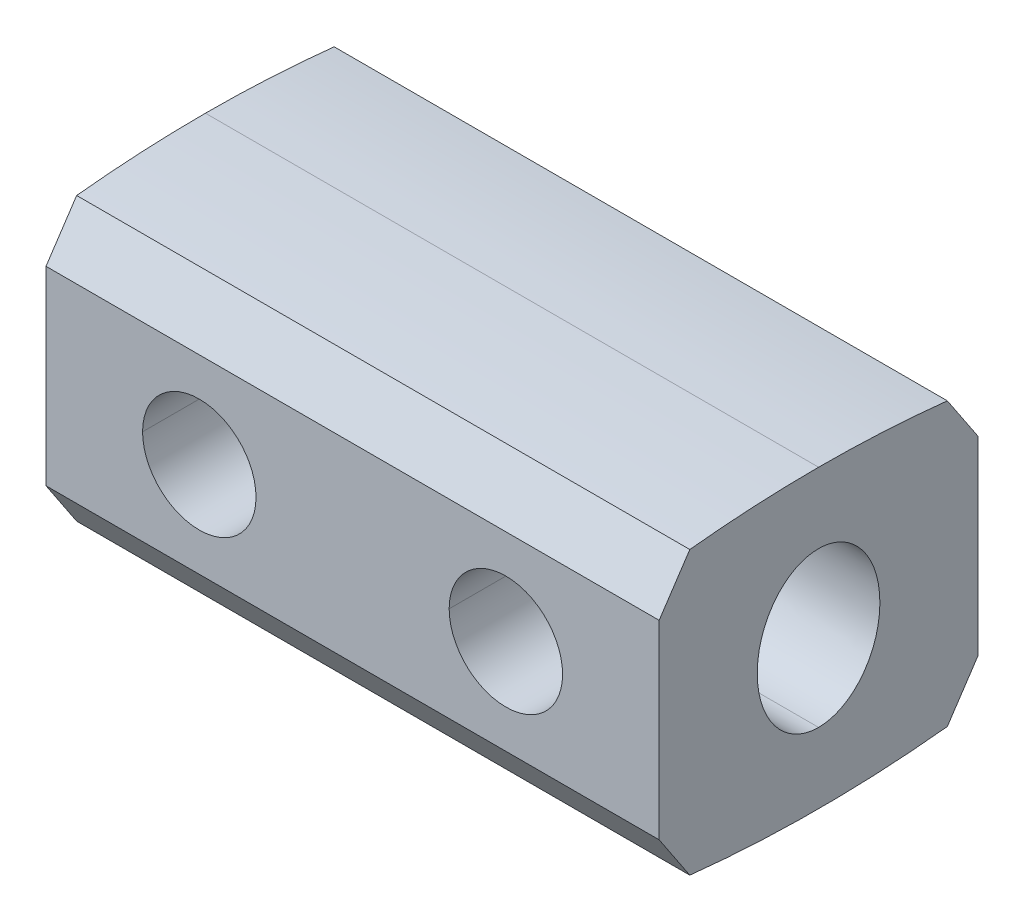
ISO-10303-21;
HEADER;
FILE_DESCRIPTION(('STEP AP214'),'2;1');
FILE_NAME('part.step','',(''),(''),'','','');
FILE_SCHEMA(('AUTOMOTIVE_DESIGN { 1 0 10303 214 1 1 1 1 }'));
ENDSEC;
DATA;
#1=APPLICATION_CONTEXT('core data for automotive mechanical design processes');
#2=APPLICATION_PROTOCOL_DEFINITION('international standard','automotive_design',2000,#1);
#3=PRODUCT_CONTEXT('',#1,'mechanical');
#4=PRODUCT('Part','Part','',(#3));
#5=PRODUCT_RELATED_PRODUCT_CATEGORY('part','',(#4));
#6=PRODUCT_DEFINITION_FORMATION('','',#4);
#7=PRODUCT_DEFINITION_CONTEXT('part definition',#1,'design');
#8=PRODUCT_DEFINITION('design','',#6,#7);
#9=PRODUCT_DEFINITION_SHAPE('','',#8);
#10=(LENGTH_UNIT() NAMED_UNIT(*) SI_UNIT(.MILLI.,.METRE.));
#11=(NAMED_UNIT(*) PLANE_ANGLE_UNIT() SI_UNIT($,.RADIAN.));
#12=(NAMED_UNIT(*) SI_UNIT($,.STERADIAN.) SOLID_ANGLE_UNIT());
#13=UNCERTAINTY_MEASURE_WITH_UNIT(LENGTH_MEASURE(1.E-05),#10,'distance_accuracy_value','');
#14=(GEOMETRIC_REPRESENTATION_CONTEXT(3) GLOBAL_UNCERTAINTY_ASSIGNED_CONTEXT((#13)) GLOBAL_UNIT_ASSIGNED_CONTEXT((#10,
#11,#12)) REPRESENTATION_CONTEXT('',''));
#15=CARTESIAN_POINT('',(0.,0.,0.));
#16=DIRECTION('',(0.,0.,1.));
#17=DIRECTION('',(1.,0.,0.));
#18=AXIS2_PLACEMENT_3D('',#15,#16,#17);
#19=CARTESIAN_POINT('',(0.,0.,52.832));
#20=DIRECTION('',(0.,0.,-1.));
#21=DIRECTION('',(-1.,0.,0.));
#22=AXIS2_PLACEMENT_3D('',#19,#20,#21);
#23=CYLINDRICAL_SURFACE('',#22,4.953);
#24=CARTESIAN_POINT('',(0.,0.,12.7));
#25=DIRECTION('',(0.,0.,-1.));
#26=DIRECTION('',(-1.,0.,0.));
#27=AXIS2_PLACEMENT_3D('',#24,#25,#26);
#28=CIRCLE('',#27,4.953);
#29=CARTESIAN_POINT('',(4.953,0.,12.7));
#30=VERTEX_POINT('',#29);
#31=CARTESIAN_POINT('',(-4.953,0.,12.7));
#32=VERTEX_POINT('',#31);
#33=EDGE_CURVE('E42',#30,#32,#28,.T.);
#34=ORIENTED_EDGE('',*,*,#33,.F.);
#35=DIRECTION('',(0.,0.,-1.));
#36=VECTOR('',#35,1.);
#37=CARTESIAN_POINT('',(4.953,0.,52.832));
#38=LINE('',#37,#36);
#39=CARTESIAN_POINT('',(4.953,0.,0.));
#40=VERTEX_POINT('',#39);
#41=EDGE_CURVE('E9',#30,#40,#38,.T.);
#42=ORIENTED_EDGE('',*,*,#41,.T.);
#43=CARTESIAN_POINT('',(0.,0.,0.));
#44=DIRECTION('',(0.,0.,-1.));
#45=DIRECTION('',(-1.,0.,0.));
#46=AXIS2_PLACEMENT_3D('',#43,#44,#45);
#47=CIRCLE('',#46,4.953);
#48=CARTESIAN_POINT('',(-4.953,0.,0.));
#49=VERTEX_POINT('',#48);
#50=EDGE_CURVE('E28',#40,#49,#47,.T.);
#51=ORIENTED_EDGE('',*,*,#50,.T.);
#52=DIRECTION('',(0.,0.,-1.));
#53=VECTOR('',#52,1.);
#54=CARTESIAN_POINT('',(-4.953,0.,52.832));
#55=LINE('',#54,#53);
#56=EDGE_CURVE('E203',#32,#49,#55,.T.);
#57=ORIENTED_EDGE('',*,*,#56,.F.);
#58=EDGE_LOOP('',(#34,#42,#51,#57));
#59=FACE_BOUND('',#58,.T.);
#60=ADVANCED_FACE('F14',(#59),#23,.F.);
#61=CARTESIAN_POINT('',(50.8,0.,52.832));
#62=DIRECTION('',(0.,0.,-1.));
#63=DIRECTION('',(-1.,0.,0.));
#64=AXIS2_PLACEMENT_3D('',#61,#62,#63);
#65=CYLINDRICAL_SURFACE('',#64,4.953);
#66=CARTESIAN_POINT('',(50.8,0.,12.7));
#67=DIRECTION('',(0.,0.,-1.));
#68=DIRECTION('',(-1.,0.,0.));
#69=AXIS2_PLACEMENT_3D('',#66,#67,#68);
#70=CIRCLE('',#69,4.953);
#71=CARTESIAN_POINT('',(55.753,0.,12.7));
#72=VERTEX_POINT('',#71);
#73=CARTESIAN_POINT('',(45.847,0.,12.7));
#74=VERTEX_POINT('',#73);
#75=EDGE_CURVE('E165',#72,#74,#70,.T.);
#76=ORIENTED_EDGE('',*,*,#75,.F.);
#77=DIRECTION('',(0.,0.,-1.));
#78=VECTOR('',#77,1.);
#79=CARTESIAN_POINT('',(55.753,0.,52.832));
#80=LINE('',#79,#78);
#81=CARTESIAN_POINT('',(55.753,0.,0.));
#82=VERTEX_POINT('',#81);
#83=EDGE_CURVE('E184',#72,#82,#80,.T.);
#84=ORIENTED_EDGE('',*,*,#83,.T.);
#85=CARTESIAN_POINT('',(50.8,0.,0.));
#86=DIRECTION('',(0.,0.,-1.));
#87=DIRECTION('',(-1.,0.,0.));
#88=AXIS2_PLACEMENT_3D('',#85,#86,#87);
#89=CIRCLE('',#88,4.953);
#90=CARTESIAN_POINT('',(45.847,0.,0.));
#91=VERTEX_POINT('',#90);
#92=EDGE_CURVE('E168',#82,#91,#89,.T.);
#93=ORIENTED_EDGE('',*,*,#92,.T.);
#94=DIRECTION('',(0.,0.,-1.));
#95=VECTOR('',#94,1.);
#96=CARTESIAN_POINT('',(45.847,0.,52.832));
#97=LINE('',#96,#95);
#98=EDGE_CURVE('E160',#74,#91,#97,.T.);
#99=ORIENTED_EDGE('',*,*,#98,.F.);
#100=EDGE_LOOP('',(#76,#84,#93,#99));
#101=FACE_BOUND('',#100,.T.);
#102=ADVANCED_FACE('F162',(#101),#65,.F.);
#103=CARTESIAN_POINT('',(0.,0.,-13.8815581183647));
#104=DIRECTION('',(0.,0.,1.));
#105=DIRECTION('',(1.,0.,0.));
#106=AXIS2_PLACEMENT_3D('',#103,#104,#105);
#107=CYLINDRICAL_SURFACE('',#106,9.398);
#108=CARTESIAN_POINT('',(0.,0.,12.7));
#109=DIRECTION('',(0.,0.,-1.));
#110=DIRECTION('',(-1.,0.,0.));
#111=AXIS2_PLACEMENT_3D('',#108,#109,#110);
#112=CIRCLE('',#111,9.398);
#113=CARTESIAN_POINT('',(9.398,0.,12.7));
#114=VERTEX_POINT('',#113);
#115=CARTESIAN_POINT('',(-9.398,0.,12.7));
#116=VERTEX_POINT('',#115);
#117=EDGE_CURVE('E252',#114,#116,#112,.T.);
#118=ORIENTED_EDGE('',*,*,#117,.T.);
#119=DIRECTION('',(0.,0.,1.));
#120=VECTOR('',#119,1.);
#121=CARTESIAN_POINT('',(-9.398,0.,-13.8815581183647));
#122=LINE('',#121,#120);
#123=CARTESIAN_POINT('',(-9.398,2.69920375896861E-11,16.256));
#124=VERTEX_POINT('',#123);
#125=EDGE_CURVE('E256',#116,#124,#122,.T.);
#126=ORIENTED_EDGE('',*,*,#125,.T.);
#127=CARTESIAN_POINT('',(9.39799999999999,0.,16.256));
#128=CARTESIAN_POINT('',(9.39800144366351,-0.104057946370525,16.2559985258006));
#129=CARTESIAN_POINT('',(9.39627309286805,-0.208115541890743,16.257002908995));
#130=CARTESIAN_POINT('',(9.38936573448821,-0.416147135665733,16.2610141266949));
#131=CARTESIAN_POINT('',(9.38418442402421,-0.520121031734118,16.2640222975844));
#132=CARTESIAN_POINT('',(9.37037146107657,-0.727893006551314,16.2720368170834));
#133=CARTESIAN_POINT('',(9.36173549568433,-0.831690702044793,16.2770456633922));
#134=CARTESIAN_POINT('',(9.3410156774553,-1.03901903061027,16.2890515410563));
#135=CARTESIAN_POINT('',(9.32892551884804,-1.14254882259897,16.2960522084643));
#136=CARTESIAN_POINT('',(9.30129917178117,-1.34925096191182,16.3120288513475));
#137=CARTESIAN_POINT('',(9.28575470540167,-1.45242183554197,16.3210095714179));
#138=CARTESIAN_POINT('',(9.25122172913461,-1.65831698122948,16.3409298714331));
#139=CARTESIAN_POINT('',(9.23222299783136,-1.7610389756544,16.3518752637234));
#140=CARTESIAN_POINT('',(9.19078340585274,-1.96594865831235,16.3757051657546));
#141=CARTESIAN_POINT('',(9.16833041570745,-2.06813309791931,16.3885965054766));
#142=CARTESIAN_POINT('',(9.11998418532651,-2.27188166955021,16.4162953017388));
#143=CARTESIAN_POINT('',(9.09407695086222,-2.3734414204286,16.4311105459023));
#144=CARTESIAN_POINT('',(9.03882408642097,-2.57585655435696,16.4626310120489));
#145=CARTESIAN_POINT('',(9.00946264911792,-2.67670626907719,16.4793449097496));
#146=CARTESIAN_POINT('',(8.94730308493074,-2.87761941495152,16.5146335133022));
#147=CARTESIAN_POINT('',(8.91448739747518,-2.97767574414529,16.5332177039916));
#148=CARTESIAN_POINT('',(8.84542133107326,-3.17692263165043,16.5722148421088));
#149=CARTESIAN_POINT('',(8.80915170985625,-3.27610451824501,16.5926379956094));
#150=CARTESIAN_POINT('',(8.73317836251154,-3.47352537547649,16.6352781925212));
#151=CARTESIAN_POINT('',(8.69345378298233,-3.57175397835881,16.6575060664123));
#152=CARTESIAN_POINT('',(8.61235433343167,-3.76300123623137,16.702726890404));
#153=CARTESIAN_POINT('',(8.57109019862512,-3.85608021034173,16.7256635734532));
#154=CARTESIAN_POINT('',(8.48553571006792,-4.04093423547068,16.7730332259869));
#155=CARTESIAN_POINT('',(8.44123372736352,-4.13270244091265,16.7974719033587));
#156=CARTESIAN_POINT('',(8.34960439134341,-4.31488491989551,16.8477930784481));
#157=CARTESIAN_POINT('',(8.30226381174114,-4.40529081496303,16.8736818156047));
#158=CARTESIAN_POINT('',(8.20455891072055,-4.58470322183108,16.9268498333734));
#159=CARTESIAN_POINT('',(8.15417982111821,-4.67369970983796,16.9541357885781));
#160=CARTESIAN_POINT('',(8.05040001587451,-4.8502519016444,17.0100443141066));
#161=CARTESIAN_POINT('',(7.99698306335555,-4.93779583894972,17.0386738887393));
#162=CARTESIAN_POINT('',(7.88712655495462,-5.11140362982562,17.0972144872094));
#163=CARTESIAN_POINT('',(7.83066936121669,-5.1974538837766,17.1271327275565));
#164=CARTESIAN_POINT('',(7.71644729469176,-5.3655372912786,17.1872998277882));
#165=CARTESIAN_POINT('',(7.6587395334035,-5.44761722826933,17.2175264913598));
#166=CARTESIAN_POINT('',(7.5409022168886,-5.60967205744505,17.2788394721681));
#167=CARTESIAN_POINT('',(7.48077299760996,-5.68964723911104,17.3099256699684));
#168=CARTESIAN_POINT('',(7.35809252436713,-5.84749578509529,17.3728786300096));
#169=CARTESIAN_POINT('',(7.29553968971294,-5.92536771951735,17.4047458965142));
#170=CARTESIAN_POINT('',(7.16801443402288,-6.07901936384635,17.4691849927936));
#171=CARTESIAN_POINT('',(7.10303856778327,-6.15479580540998,17.5017577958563));
#172=CARTESIAN_POINT('',(6.97066934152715,-6.30427005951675,17.5675345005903));
#173=CARTESIAN_POINT('',(6.90327075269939,-6.37796267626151,17.6007396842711));
#174=CARTESIAN_POINT('',(6.76605653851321,-6.52328504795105,17.6677094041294));
#175=CARTESIAN_POINT('',(6.69623400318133,-6.59490761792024,17.7014753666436));
#176=CARTESIAN_POINT('',(6.55303332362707,-6.73725412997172,17.7700495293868));
#177=CARTESIAN_POINT('',(6.47961191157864,-6.80793102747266,17.804865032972));
#178=CARTESIAN_POINT('',(6.33120959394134,-6.94622321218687,17.874441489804));
#179=CARTESIAN_POINT('',(6.25624718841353,-7.01385937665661,17.9092004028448));
#180=CARTESIAN_POINT('',(6.10476412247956,-7.14614801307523,17.9785626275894));
#181=CARTESIAN_POINT('',(6.02825926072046,-7.21081898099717,18.0131651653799));
#182=CARTESIAN_POINT('',(5.87369458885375,-7.33725900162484,18.0821216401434));
#183=CARTESIAN_POINT('',(5.79564791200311,-7.399044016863,18.1164757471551));
#184=CARTESIAN_POINT('',(5.63800184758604,-7.5197946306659,18.1848488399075));
#185=CARTESIAN_POINT('',(5.55841302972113,-7.57877357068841,18.21886863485));
#186=CARTESIAN_POINT('',(5.3976866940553,-7.69399661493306,18.286493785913));
#187=CARTESIAN_POINT('',(5.31655730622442,-7.75025138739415,18.3201002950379));
#188=CARTESIAN_POINT('',(5.1480976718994,-7.86322478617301,18.3887175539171));
#189=CARTESIAN_POINT('',(5.06066773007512,-7.91980757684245,18.423707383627));
#190=CARTESIAN_POINT('',(4.88528984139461,-8.0292138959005,18.4924975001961));
#191=CARTESIAN_POINT('',(4.79737532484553,-8.08208463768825,18.5263078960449));
#192=CARTESIAN_POINT('',(4.62103287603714,-8.18421263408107,18.5926434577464));
#193=CARTESIAN_POINT('',(4.53263474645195,-8.23351363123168,18.6251804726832));
#194=CARTESIAN_POINT('',(4.35532876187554,-8.3286418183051,18.688883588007));
#195=CARTESIAN_POINT('',(4.26644718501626,-8.37450921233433,18.7200627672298));
#196=CARTESIAN_POINT('',(4.08817695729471,-8.46290348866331,18.7809735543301));
#197=CARTESIAN_POINT('',(3.99881120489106,-8.50546700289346,18.8107189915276));
#198=CARTESIAN_POINT('',(3.81957950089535,-8.58738546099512,18.8686978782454));
#199=CARTESIAN_POINT('',(3.72973318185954,-8.62677339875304,18.8969454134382));
#200=CARTESIAN_POINT('',(3.5375451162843,-8.70748192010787,18.9555122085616));
#201=CARTESIAN_POINT('',(3.43500847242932,-8.74845835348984,18.9856677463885));
#202=CARTESIAN_POINT('',(3.23012569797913,-8.82615251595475,19.0435443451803));
#203=CARTESIAN_POINT('',(3.12781562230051,-8.86293824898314,19.0713016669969));
#204=CARTESIAN_POINT('',(2.92339361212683,-8.93242976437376,19.1243134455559));
#205=CARTESIAN_POINT('',(2.82131240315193,-8.96519795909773,19.1496044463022));
#206=CARTESIAN_POINT('',(2.61735271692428,-9.02681135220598,19.1976225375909));
#207=CARTESIAN_POINT('',(2.515499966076,-9.0557134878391,19.2203857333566));
#208=CARTESIAN_POINT('',(2.31200218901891,-9.10973742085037,19.2632987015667));
#209=CARTESIAN_POINT('',(2.21037820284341,-9.13491066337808,19.2834833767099));
#210=CARTESIAN_POINT('',(2.00734240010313,-9.18160298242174,19.3211987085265));
#211=CARTESIAN_POINT('',(1.90594730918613,-9.2031680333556,19.338762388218));
#212=CARTESIAN_POINT('',(1.70337339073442,-9.24275409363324,19.371203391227));
#213=CARTESIAN_POINT('',(1.60220738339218,-9.26081561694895,19.3861112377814));
#214=CARTESIAN_POINT('',(1.40009527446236,-9.29348852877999,19.4132155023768));
#215=CARTESIAN_POINT('',(1.29915853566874,-9.30813497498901,19.4254393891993));
#216=CARTESIAN_POINT('',(1.09750814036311,-9.33405546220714,19.4471571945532));
#217=CARTESIAN_POINT('',(0.996800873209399,-9.34535909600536,19.4566750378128));
#218=CARTESIAN_POINT('',(0.795612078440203,-9.36465553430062,19.4729681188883));
#219=CARTESIAN_POINT('',(0.695134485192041,-9.37267244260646,19.4797633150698));
#220=CARTESIAN_POINT('',(0.494407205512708,-9.38544087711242,19.4906038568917));
#221=CARTESIAN_POINT('',(0.394159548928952,-9.39021097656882,19.4946648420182));
#222=CARTESIAN_POINT('',(0.193893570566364,-9.39651521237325,19.5000347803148));
#223=CARTESIAN_POINT('',(0.0938759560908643,-9.39806233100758,19.5013547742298));
#224=CARTESIAN_POINT('',(-0.106086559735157,-9.39793370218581,19.5012450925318));
#225=CARTESIAN_POINT('',(-0.206031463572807,-9.39626018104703,19.4998173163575));
#226=CARTESIAN_POINT('',(-0.406153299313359,-9.38970687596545,19.4942357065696));
#227=CARTESIAN_POINT('',(-0.506329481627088,-9.38481386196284,19.4900706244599));
#228=CARTESIAN_POINT('',(-0.706915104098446,-9.37180281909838,19.4790259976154));
#229=CARTESIAN_POINT('',(-0.807322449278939,-9.36366598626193,19.4721306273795));
#230=CARTESIAN_POINT('',(-1.00837206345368,-9.34413234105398,19.4556414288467));
#231=CARTESIAN_POINT('',(-1.10901031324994,-9.33271121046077,19.446027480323));
#232=CARTESIAN_POINT('',(-1.31052400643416,-9.30655786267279,19.4241218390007));
#233=CARTESIAN_POINT('',(-1.41139295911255,-9.29179585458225,19.4118060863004));
#234=CARTESIAN_POINT('',(-1.61337084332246,-9.25889347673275,19.3845226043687));
#235=CARTESIAN_POINT('',(-1.71447029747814,-9.24071786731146,19.3695272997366));
#236=CARTESIAN_POINT('',(-1.91691246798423,-9.20090486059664,19.3369160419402));
#237=CARTESIAN_POINT('',(-2.01824223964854,-9.17922678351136,19.3192694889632));
#238=CARTESIAN_POINT('',(-2.22114877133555,-9.13230925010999,19.2813932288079));
#239=CARTESIAN_POINT('',(-2.32270867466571,-9.10702366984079,19.2611304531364));
#240=CARTESIAN_POINT('',(-2.52607965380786,-9.05277554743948,19.2180662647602));
#241=CARTESIAN_POINT('',(-2.62786955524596,-9.02376142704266,19.1952299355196));
#242=CARTESIAN_POINT('',(-2.83170492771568,-8.96192427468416,19.1470707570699));
#243=CARTESIAN_POINT('',(-2.93372453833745,-8.92904418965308,19.1217118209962));
#244=CARTESIAN_POINT('',(-3.13802467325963,-8.85932875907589,19.0685694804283));
#245=CARTESIAN_POINT('',(-3.24027434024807,-8.82243090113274,19.0407495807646));
#246=CARTESIAN_POINT('',(-3.4450378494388,-8.74451250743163,18.9827536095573));
#247=CARTESIAN_POINT('',(-3.54751551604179,-8.7034238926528,18.9525413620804));
#248=CARTESIAN_POINT('',(-3.73931246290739,-8.62262250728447,18.8939590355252));
#249=CARTESIAN_POINT('',(-3.82883151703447,-8.58326179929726,18.8657557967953));
#250=CARTESIAN_POINT('',(-4.00741044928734,-8.50141618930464,18.807878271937));
#251=CARTESIAN_POINT('',(-4.09645082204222,-8.45889856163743,18.7781900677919));
#252=CARTESIAN_POINT('',(-4.27407221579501,-8.37061588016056,18.7174062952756));
#253=CARTESIAN_POINT('',(-4.3626305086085,-8.32481451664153,18.6862970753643));
#254=CARTESIAN_POINT('',(-4.53929176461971,-8.22983932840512,18.6227458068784));
#255=CARTESIAN_POINT('',(-4.62736866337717,-8.18062567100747,18.5902908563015));
#256=CARTESIAN_POINT('',(-4.80307041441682,-8.0786945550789,18.5241306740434));
#257=CARTESIAN_POINT('',(-4.89066572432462,-8.02593377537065,18.490413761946));
#258=CARTESIAN_POINT('',(-5.06540709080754,-7.91677115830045,18.4218212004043));
#259=CARTESIAN_POINT('',(-5.15252002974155,-7.86032258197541,18.3869355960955));
#260=CARTESIAN_POINT('',(-5.32042421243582,-7.74759461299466,18.318505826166));
#261=CARTESIAN_POINT('',(-5.40131343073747,-7.69144863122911,18.2849820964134));
#262=CARTESIAN_POINT('',(-5.56156844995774,-7.57645560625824,18.2175252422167));
#263=CARTESIAN_POINT('',(-5.64092612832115,-7.51759791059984,18.1835909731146));
#264=CARTESIAN_POINT('',(-5.7981190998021,-7.39710299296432,18.115391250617));
#265=CARTESIAN_POINT('',(-5.87594385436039,-7.33545247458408,18.0811249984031));
#266=CARTESIAN_POINT('',(-6.03007380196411,-7.20929519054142,18.0123459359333));
#267=CARTESIAN_POINT('',(-6.10636591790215,-7.14477253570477,17.9778329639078));
#268=CARTESIAN_POINT('',(-6.25743257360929,-7.01279481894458,17.9086509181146));
#269=CARTESIAN_POINT('',(-6.33219139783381,-6.94532136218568,17.8739826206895));
#270=CARTESIAN_POINT('',(-6.48019570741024,-6.8073695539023,17.804587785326));
#271=CARTESIAN_POINT('',(-6.5534228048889,-6.73687045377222,17.769863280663));
#272=CARTESIAN_POINT('',(-6.69664060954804,-6.59450000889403,17.7012804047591));
#273=CARTESIAN_POINT('',(-6.76666262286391,-6.52266270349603,17.6674167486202));
#274=CARTESIAN_POINT('',(-6.9042622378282,-6.37689708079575,17.6002545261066));
#275=CARTESIAN_POINT('',(-6.97184676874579,-6.30297596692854,17.5669545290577));
#276=CARTESIAN_POINT('',(-7.10457448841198,-6.15303086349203,17.5009918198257));
#277=CARTESIAN_POINT('',(-7.16972290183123,-6.07701206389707,17.4683278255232));
#278=CARTESIAN_POINT('',(-7.29757986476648,-5.92286172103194,17.4037106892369));
#279=CARTESIAN_POINT('',(-7.36029183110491,-5.84473341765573,17.3717565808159));
#280=CARTESIAN_POINT('',(-7.48327713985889,-5.68635805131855,17.3086350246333));
#281=CARTESIAN_POINT('',(-7.54355200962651,-5.60611236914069,17.277467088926));
#282=CARTESIAN_POINT('',(-7.66166750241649,-5.44350260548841,17.2159965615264));
#283=CARTESIAN_POINT('',(-7.71950771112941,-5.36113816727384,17.1856941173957));
#284=CARTESIAN_POINT('',(-7.83384689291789,-5.19266584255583,17.1254522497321));
#285=CARTESIAN_POINT('',(-7.89029443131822,-5.10651586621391,17.0955328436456));
#286=CARTESIAN_POINT('',(-8.0001269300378,-4.93270529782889,17.03699258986));
#287=CARTESIAN_POINT('',(-8.05352950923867,-4.84505827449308,17.0083645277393));
#288=CARTESIAN_POINT('',(-8.15727614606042,-4.66829687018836,16.9524619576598));
#289=CARTESIAN_POINT('',(-8.20763641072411,-4.57919421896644,16.9251804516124));
#290=CARTESIAN_POINT('',(-8.30529919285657,-4.39956654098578,16.8720244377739));
#291=CARTESIAN_POINT('',(-8.35261643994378,-4.3090514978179,16.8461432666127));
#292=CARTESIAN_POINT('',(-8.44419461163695,-4.12664792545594,16.7958405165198));
#293=CARTESIAN_POINT('',(-8.48846871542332,-4.03476773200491,16.7714127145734));
#294=CARTESIAN_POINT('',(-8.5739631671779,-3.84968717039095,16.7240683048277));
#295=CARTESIAN_POINT('',(-8.61519508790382,-3.75649360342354,16.7011460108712));
#296=CARTESIAN_POINT('',(-8.69610422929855,-3.56529193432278,16.6560248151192));
#297=CARTESIAN_POINT('',(-8.73567946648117,-3.46722838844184,16.6338777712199));
#298=CARTESIAN_POINT('',(-8.8113671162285,-3.27014261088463,16.5913929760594));
#299=CARTESIAN_POINT('',(-8.8475002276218,-3.17113064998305,16.5710444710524));
#300=CARTESIAN_POINT('',(-8.91630645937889,-2.972228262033,16.5321901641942));
#301=CARTESIAN_POINT('',(-8.94899867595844,-2.87234642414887,16.51367423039));
#302=CARTESIAN_POINT('',(-9.0109244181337,-2.67178644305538,16.478515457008));
#303=CARTESIAN_POINT('',(-9.04017536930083,-2.57111533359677,16.4618632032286));
#304=CARTESIAN_POINT('',(-9.095220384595,-2.3690611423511,16.4304591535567));
#305=CARTESIAN_POINT('',(-9.12103013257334,-2.2676836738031,16.4156987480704));
#306=CARTESIAN_POINT('',(-9.1691944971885,-2.06430292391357,16.3881025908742));
#307=CARTESIAN_POINT('',(-9.19156299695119,-1.96230398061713,16.3752591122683));
#308=CARTESIAN_POINT('',(-9.23284670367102,-1.75776806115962,16.35151775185));
#309=CARTESIAN_POINT('',(-9.25177394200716,-1.65523430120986,16.3406130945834));
#310=CARTESIAN_POINT('',(-9.28617701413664,-1.44971789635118,16.320766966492));
#311=CARTESIAN_POINT('',(-9.30166298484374,-1.34673750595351,16.3118197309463));
#312=CARTESIAN_POINT('',(-9.3291854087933,-1.14041809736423,16.2959026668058));
#313=CARTESIAN_POINT('',(-9.34123006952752,-1.03708053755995,16.2889281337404));
#314=CARTESIAN_POINT('',(-9.36187194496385,-0.830137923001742,16.2769670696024));
#315=CARTESIAN_POINT('',(-9.37047540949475,-0.726533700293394,16.2719769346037));
#316=CARTESIAN_POINT('',(-9.38423641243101,-0.519149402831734,16.2639923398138));
#317=CARTESIAN_POINT('',(-9.38939822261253,-0.415369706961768,16.2609954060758));
#318=CARTESIAN_POINT('',(-9.39627959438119,-0.20772672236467,16.256999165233));
#319=CARTESIAN_POINT('',(-9.3980014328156,-0.103863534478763,16.255998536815));
#320=CARTESIAN_POINT('',(-9.39800000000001,2.69853583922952E-11,16.256));
#321=B_SPLINE_CURVE_WITH_KNOTS('',3,(#127,#128,#129,#130,#131,#132,#133,#134,#135,#136,#137,
#138,#139,#140,#141,#142,#143,#144,#145,#146,#147,#148,#149,#150,#151,#152,#153,#154,#155,#156,
#157,#158,#159,#160,#161,#162,#163,#164,#165,#166,#167,#168,#169,#170,#171,#172,#173,#174,#175,
#176,#177,#178,#179,#180,#181,#182,#183,#184,#185,#186,#187,#188,#189,#190,#191,#192,#193,#194,
#195,#196,#197,#198,#199,#200,#201,#202,#203,#204,#205,#206,#207,#208,#209,#210,#211,#212,#213,
#214,#215,#216,#217,#218,#219,#220,#221,#222,#223,#224,#225,#226,#227,#228,#229,#230,#231,#232,
#233,#234,#235,#236,#237,#238,#239,#240,#241,#242,#243,#244,#245,#246,#247,#248,#249,#250,#251,
#252,#253,#254,#255,#256,#257,#258,#259,#260,#261,#262,#263,#264,#265,#266,#267,#268,#269,#270,
#271,#272,#273,#274,#275,#276,#277,#278,#279,#280,#281,#282,#283,#284,#285,#286,#287,#288,#289,
#290,#291,#292,#293,#294,#295,#296,#297,#298,#299,#300,#301,#302,#303,#304,#305,#306,#307,#308,
#309,#310,#311,#312,#313,#314,#315,#316,#317,#318,#319,#320),.UNSPECIFIED.,.F.,.F.,(4,2,2,2,2,2,
2,2,2,2,2,2,2,2,2,2,2,2,2,2,2,2,2,2,2,2,2,2,2,2,2,2,2,2,2,2,2,2,2,2,2,2,2,2,2,2,2,2,2,2,2,2,2,2,
2,2,2,2,2,2,2,2,2,2,2,2,2,2,2,2,2,2,2,2,2,2,2,2,2,2,2,2,2,2,2,2,2,2,2,2,2,2,2,2,2,2,4),(0.,
0.312154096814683,0.624516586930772,0.937270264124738,1.2505985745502,1.56468600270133,
1.87971842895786,2.1958834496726,2.51337065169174,2.83237183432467,3.15308117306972,
3.47569532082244,3.80041344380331,4.11345311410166,4.42776636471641,4.74355516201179,
5.06102667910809,5.38039262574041,5.70186852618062,6.01618605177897,6.33046011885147,
6.64494272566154,6.95989094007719,7.2755653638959,7.59222863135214,7.91526067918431,
8.23555389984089,8.55345745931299,8.86932042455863,9.183489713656,9.4963082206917,
9.82584204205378,10.1498347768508,10.4687337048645,10.7829774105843,11.0929946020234,
11.3992031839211,11.742516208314,12.0790646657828,12.4094458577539,12.7342438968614,
13.0540307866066,13.3693677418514,13.6808067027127,13.9888920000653,14.2941621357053,
14.597151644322,14.8983930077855,15.1984185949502,15.4982368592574,15.7992949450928,
16.1021242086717,16.4072561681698,16.7152244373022,17.0265666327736,17.3418262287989,
17.6615543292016,17.986311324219,18.3166683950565,18.6532088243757,18.9965290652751,
19.3018060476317,19.6108738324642,19.9241462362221,20.242047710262,20.5650124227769,
20.8934830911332,21.2054853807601,21.5188399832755,21.8338871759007,22.1509711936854,
22.4704383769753,22.7926351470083,23.1102245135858,23.4268254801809,23.7427031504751,
24.0581205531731,24.3733371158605,24.6886071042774,25.0103088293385,25.3299060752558,
25.6476149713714,25.9636477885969,26.2782122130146,26.5915106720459,26.9155658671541,
27.2375298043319,27.5576005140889,27.8759735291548,28.1928419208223,28.5083963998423,
28.8228254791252,29.1363156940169,29.4490518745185,29.7612174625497,30.0729948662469,
30.3845658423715),.UNSPECIFIED.);
#322=CARTESIAN_POINT('',(9.398,0.,16.256));
#323=VERTEX_POINT('',#322);
#324=EDGE_CURVE('E292',#124,#323,#321,.F.);
#325=ORIENTED_EDGE('',*,*,#324,.T.);
#326=DIRECTION('',(0.,0.,1.));
#327=VECTOR('',#326,1.);
#328=CARTESIAN_POINT('',(9.398,0.,-13.8815581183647));
#329=LINE('',#328,#327);
#330=EDGE_CURVE('E537',#114,#323,#329,.T.);
#331=ORIENTED_EDGE('',*,*,#330,.F.);
#332=EDGE_LOOP('',(#118,#126,#325,#331));
#333=FACE_BOUND('',#332,.T.);
#334=ADVANCED_FACE('F299',(#333),#107,.F.);
#335=CARTESIAN_POINT('',(0.,0.,-13.8815581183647));
#336=DIRECTION('',(0.,0.,1.));
#337=DIRECTION('',(1.,0.,0.));
#338=AXIS2_PLACEMENT_3D('',#335,#336,#337);
#339=CYLINDRICAL_SURFACE('',#338,9.398);
#340=CARTESIAN_POINT('',(-9.39800000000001,-2.69888278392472E-11,36.576));
#341=CARTESIAN_POINT('',(-9.39800143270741,-0.103858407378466,36.5760014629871));
#342=CARTESIAN_POINT('',(-9.39627967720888,-0.207716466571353,36.5750009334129));
#343=CARTESIAN_POINT('',(-9.3893986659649,-0.415349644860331,36.5710050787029));
#344=CARTESIAN_POINT('',(-9.38423711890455,-0.519124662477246,36.5680084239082));
#345=CARTESIAN_POINT('',(-9.3704768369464,-0.726500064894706,36.5600245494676));
#346=CARTESIAN_POINT('',(-9.36187381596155,-0.830100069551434,36.5550348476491));
#347=CARTESIAN_POINT('',(-9.34123302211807,-1.03703471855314,36.5430747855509));
#348=CARTESIAN_POINT('',(-9.32918898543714,-1.14036852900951,36.5361008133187));
#349=CARTESIAN_POINT('',(-9.30166800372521,-1.34668091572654,36.5201849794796));
#350=CARTESIAN_POINT('',(-9.28618283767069,-1.44965803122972,36.5112384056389));
#351=CARTESIAN_POINT('',(-9.25178156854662,-1.65516836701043,36.4913936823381));
#352=CARTESIAN_POINT('',(-9.23285531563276,-1.75769932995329,36.4804897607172));
#353=CARTESIAN_POINT('',(-9.19157377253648,-1.96223013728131,36.4567499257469));
#354=CARTESIAN_POINT('',(-9.16920643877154,-2.06422676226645,36.4439072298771));
#355=CARTESIAN_POINT('',(-9.12104459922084,-2.26760335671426,36.4163126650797));
#356=CARTESIAN_POINT('',(-9.09523619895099,-2.36897898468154,36.4015530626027));
#357=CARTESIAN_POINT('',(-9.0401940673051,-2.57102997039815,36.3701506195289));
#358=CARTESIAN_POINT('',(-9.01094464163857,-2.67169971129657,36.3534991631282));
#359=CARTESIAN_POINT('',(-8.94902215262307,-2.8722574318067,36.3183419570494));
#360=CARTESIAN_POINT('',(-8.91633165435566,-2.97213837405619,36.2998267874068));
#361=CARTESIAN_POINT('',(-8.84752900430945,-3.17103941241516,36.2609739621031));
#362=CARTESIAN_POINT('',(-8.81139774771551,-3.27005091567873,36.2406261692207));
#363=CARTESIAN_POINT('',(-8.73571416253,-3.4671363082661,36.1981427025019));
#364=CARTESIAN_POINT('',(-8.69614112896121,-3.56519992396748,36.175996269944));
#365=CARTESIAN_POINT('',(-8.61533104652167,-3.75617695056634,36.1309293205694));
#366=CARTESIAN_POINT('',(-8.5742029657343,-3.84914959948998,36.1080642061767));
#367=CARTESIAN_POINT('',(-8.48892803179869,-4.03379839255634,36.0608402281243));
#368=CARTESIAN_POINT('',(-8.44476956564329,-4.1254677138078,36.0364756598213));
#369=CARTESIAN_POINT('',(-8.35343470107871,-4.30745989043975,35.9863048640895));
#370=CARTESIAN_POINT('',(-8.30624510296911,-4.39777440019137,35.9604924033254));
#371=CARTESIAN_POINT('',(-8.20884958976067,-4.57701150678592,35.907478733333));
#372=CARTESIAN_POINT('',(-8.15862894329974,-4.66592412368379,35.8802708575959));
#373=CARTESIAN_POINT('',(-8.0551734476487,-4.84231603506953,35.8245199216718));
#374=CARTESIAN_POINT('',(-8.0019224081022,-4.92978361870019,35.7959698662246));
#375=CARTESIAN_POINT('',(-7.89240510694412,-5.10324607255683,35.7375894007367));
#376=CARTESIAN_POINT('',(-7.83612126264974,-5.18922741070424,35.7077517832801));
#377=CARTESIAN_POINT('',(-7.72199693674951,-5.35755292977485,35.6476118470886));
#378=CARTESIAN_POINT('',(-7.66420239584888,-5.43993467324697,35.6173274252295));
#379=CARTESIAN_POINT('',(-7.54617434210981,-5.6025842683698,35.555890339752));
#380=CARTESIAN_POINT('',(-7.48594111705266,-5.68285236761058,35.5247377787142));
#381=CARTESIAN_POINT('',(-7.36303540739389,-5.84127765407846,35.4616441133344));
#382=CARTESIAN_POINT('',(-7.30036127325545,-5.91943335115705,35.4297024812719));
#383=CARTESIAN_POINT('',(-7.17257623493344,-6.07364325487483,35.3651072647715));
#384=CARTESIAN_POINT('',(-7.10746179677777,-6.14969411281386,35.3324526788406));
#385=CARTESIAN_POINT('',(-6.97479825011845,-6.29970779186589,35.2665056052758));
#386=CARTESIAN_POINT('',(-6.90724380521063,-6.37366531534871,35.2332118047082));
#387=CARTESIAN_POINT('',(-6.76970075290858,-6.51950806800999,35.1660585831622));
#388=CARTESIAN_POINT('',(-6.6997051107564,-6.59138598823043,35.1321977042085));
#389=CARTESIAN_POINT('',(-6.55651874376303,-6.73385879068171,35.0636088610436));
#390=CARTESIAN_POINT('',(-6.4832960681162,-6.80441895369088,35.0288754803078));
#391=CARTESIAN_POINT('',(-6.33529403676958,-6.94249406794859,34.9594595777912));
#392=CARTESIAN_POINT('',(-6.2605329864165,-7.01002966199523,34.9247790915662));
#393=CARTESIAN_POINT('',(-6.10945549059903,-7.14213281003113,34.8555693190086));
#394=CARTESIAN_POINT('',(-6.03315467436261,-7.20671864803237,34.8210408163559));
#395=CARTESIAN_POINT('',(-5.87900090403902,-7.33300327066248,34.7522274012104));
#396=CARTESIAN_POINT('',(-5.80116093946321,-7.39471783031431,34.7179423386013));
#397=CARTESIAN_POINT('',(-5.64393110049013,-7.51534164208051,34.6497017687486));
#398=CARTESIAN_POINT('',(-5.56455167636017,-7.57426407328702,34.615745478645));
#399=CARTESIAN_POINT('',(-5.40424686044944,-7.68938738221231,34.5482413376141));
#400=CARTESIAN_POINT('',(-5.32332950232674,-7.74559879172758,34.5146923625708));
#401=CARTESIAN_POINT('',(-5.15501291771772,-7.85869503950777,34.4460660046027));
#402=CARTESIAN_POINT('',(-5.06750735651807,-7.91543514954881,34.4110106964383));
#403=CARTESIAN_POINT('',(-4.89197290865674,-8.02514634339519,34.3420883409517));
#404=CARTESIAN_POINT('',(-4.80397757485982,-8.07816476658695,34.3082112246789));
#405=CARTESIAN_POINT('',(-4.62746812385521,-8.18057879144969,34.2417414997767));
#406=CARTESIAN_POINT('',(-4.53898391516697,-8.23001824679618,34.2091370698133));
#407=CARTESIAN_POINT('',(-4.3615004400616,-8.32541451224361,34.1452988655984));
#408=CARTESIAN_POINT('',(-4.27252753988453,-8.37141162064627,34.1140520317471));
#409=CARTESIAN_POINT('',(-4.09406934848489,-8.46005697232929,34.0530060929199));
#410=CARTESIAN_POINT('',(-4.00460702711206,-8.50274192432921,34.023193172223));
#411=CARTESIAN_POINT('',(-3.82517687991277,-8.5848953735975,33.9650798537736));
#412=CARTESIAN_POINT('',(-3.73522874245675,-8.62439692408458,33.9367653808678));
#413=CARTESIAN_POINT('',(-3.54291144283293,-8.70530056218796,33.8780852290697));
#414=CARTESIAN_POINT('',(-3.44034843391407,-8.74636071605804,33.8478818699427));
#415=CARTESIAN_POINT('',(-3.23541295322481,-8.8242172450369,33.7899093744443));
#416=CARTESIAN_POINT('',(-3.13307665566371,-8.86108176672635,33.7621039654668));
#417=CARTESIAN_POINT('',(-2.92860223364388,-8.93072615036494,33.7089960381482));
#418=CARTESIAN_POINT('',(-2.82649494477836,-8.96356856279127,33.6836569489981));
#419=CARTESIAN_POINT('',(-2.62248314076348,-9.02532606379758,33.6355429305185));
#420=CARTESIAN_POINT('',(-2.52060445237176,-9.05429822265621,33.6127318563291));
#421=CARTESIAN_POINT('',(-2.31705485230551,-9.10845823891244,33.5697235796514));
#422=CARTESIAN_POINT('',(-2.21540507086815,-9.13369766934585,33.5494914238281));
#423=CARTESIAN_POINT('',(-2.01231774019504,-9.18051875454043,33.5116817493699));
#424=CARTESIAN_POINT('',(-1.9108969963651,-9.20214650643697,33.4940711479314));
#425=CARTESIAN_POINT('',(-1.70827184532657,-9.24185469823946,33.4615370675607));
#426=CARTESIAN_POINT('',(-1.60708032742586,-9.2599757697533,33.446582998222));
#427=CARTESIAN_POINT('',(-1.40491728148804,-9.29276483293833,33.4193871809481));
#428=CARTESIAN_POINT('',(-1.30395517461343,-9.30746799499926,33.4071178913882));
#429=CARTESIAN_POINT('',(-1.10225413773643,-9.33349927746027,33.3853102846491));
#430=CARTESIAN_POINT('',(-1.00152164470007,-9.34485709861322,33.3757479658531));
#431=CARTESIAN_POINT('',(-0.800282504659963,-9.36425957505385,33.3593670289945));
#432=CARTESIAN_POINT('',(-0.699779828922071,-9.3723284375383,33.3525283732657));
#433=CARTESIAN_POINT('',(-0.499002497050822,-9.38519870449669,33.341602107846));
#434=CARTESIAN_POINT('',(-0.398729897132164,-9.3900187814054,33.3374987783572));
#435=CARTESIAN_POINT('',(-0.19841417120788,-9.39642123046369,33.3320453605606));
#436=CARTESIAN_POINT('',(-0.098371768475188,-9.39801667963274,33.3306841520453));
#437=CARTESIAN_POINT('',(0.101813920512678,-9.3979830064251,33.3307128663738));
#438=CARTESIAN_POINT('',(0.201957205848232,-9.39635060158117,33.3321055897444));
#439=CARTESIAN_POINT('',(0.402476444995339,-9.38986684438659,33.3376281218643));
#440=CARTESIAN_POINT('',(0.502851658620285,-9.38500226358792,33.3417691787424));
#441=CARTESIAN_POINT('',(0.703836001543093,-9.37203556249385,33.3527766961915));
#442=CARTESIAN_POINT('',(0.804443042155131,-9.36391459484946,33.3596590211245));
#443=CARTESIAN_POINT('',(1.00589270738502,-9.34440009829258,33.3761330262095));
#444=CARTESIAN_POINT('',(1.10673130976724,-9.33298216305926,33.3857449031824));
#445=CARTESIAN_POINT('',(1.30864638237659,-9.30682246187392,33.4076571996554));
#446=CARTESIAN_POINT('',(1.40971634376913,-9.29205077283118,33.4199817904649));
#447=CARTESIAN_POINT('',(1.61209693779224,-9.25911599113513,33.4472936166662));
#448=CARTESIAN_POINT('',(1.71339805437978,-9.24091748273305,33.4623085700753));
#449=CARTESIAN_POINT('',(1.91624426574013,-9.2010452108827,33.4949696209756));
#450=CARTESIAN_POINT('',(2.0177763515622,-9.17933054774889,33.5126464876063));
#451=CARTESIAN_POINT('',(2.22108825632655,-9.13232582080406,33.5505936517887));
#452=CARTESIAN_POINT('',(2.32285112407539,-9.10698936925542,33.5708972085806));
#453=CARTESIAN_POINT('',(2.52662880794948,-9.05262479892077,33.6140529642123));
#454=CARTESIAN_POINT('',(2.62862232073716,-9.02354479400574,33.6369402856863));
#455=CARTESIAN_POINT('',(2.83286573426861,-8.96156036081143,33.6852111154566));
#456=CARTESIAN_POINT('',(2.93508960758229,-8.92859852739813,33.7106309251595));
#457=CARTESIAN_POINT('',(3.13979910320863,-8.85870313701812,33.7639042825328));
#458=CARTESIAN_POINT('',(3.24225365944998,-8.8217066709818,33.7917945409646));
#459=CARTESIAN_POINT('',(3.44742791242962,-8.7435735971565,33.8499399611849));
#460=CARTESIAN_POINT('',(3.5501111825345,-8.70236847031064,33.8802315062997));
#461=CARTESIAN_POINT('',(3.74169055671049,-8.62158573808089,33.9387856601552));
#462=CARTESIAN_POINT('',(3.83079737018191,-8.58237922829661,33.9668725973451));
#463=CARTESIAN_POINT('',(4.00855674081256,-8.50086927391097,34.0245040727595));
#464=CARTESIAN_POINT('',(4.09719002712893,-8.45853350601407,34.0540623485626));
#465=CARTESIAN_POINT('',(4.27400214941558,-8.37064348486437,34.1145736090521));
#466=CARTESIAN_POINT('',(4.36215854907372,-8.32505339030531,34.1455400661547));
#467=CARTESIAN_POINT('',(4.53802084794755,-8.23053133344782,34.2087941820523));
#468=CARTESIAN_POINT('',(4.62570103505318,-8.18156007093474,34.2410945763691));
#469=CARTESIAN_POINT('',(4.80061415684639,-8.08014613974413,34.3069351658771));
#470=CARTESIAN_POINT('',(4.88781796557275,-8.02766074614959,34.3404868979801));
#471=CARTESIAN_POINT('',(5.06178097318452,-7.91908310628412,34.4087399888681));
#472=CARTESIAN_POINT('',(5.14850753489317,-7.86294477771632,34.4434511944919));
#473=CARTESIAN_POINT('',(5.31618929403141,-7.75050309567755,34.5117480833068));
#474=CARTESIAN_POINT('',(5.39723021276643,-7.69431654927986,34.5453157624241));
#475=CARTESIAN_POINT('',(5.55778620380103,-7.5792331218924,34.6128643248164));
#476=CARTESIAN_POINT('',(5.6372930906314,-7.52032549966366,34.6468463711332));
#477=CARTESIAN_POINT('',(5.79478202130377,-7.39972087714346,34.7151451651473));
#478=CARTESIAN_POINT('',(5.87275344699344,-7.33801047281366,34.7494627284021));
#479=CARTESIAN_POINT('',(6.02717430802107,-7.21172309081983,34.8183475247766));
#480=CARTESIAN_POINT('',(6.10361056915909,-7.14713009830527,34.8529149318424));
#481=CARTESIAN_POINT('',(6.25496309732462,-7.01500087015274,34.9222085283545));
#482=CARTESIAN_POINT('',(6.32986353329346,-6.94744609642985,34.9569339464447));
#483=CARTESIAN_POINT('',(6.47814867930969,-6.8093203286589,35.0264452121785));
#484=CARTESIAN_POINT('',(6.55151486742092,-6.73872842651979,35.0612290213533));
#485=CARTESIAN_POINT('',(6.69496932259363,-6.59619848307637,35.1299135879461));
#486=CARTESIAN_POINT('',(6.76508998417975,-6.52429567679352,35.1638198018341));
#487=CARTESIAN_POINT('',(6.90288175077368,-6.3783936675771,35.2310666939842));
#488=CARTESIAN_POINT('',(6.97055980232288,-6.30440168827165,35.2644088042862));
#489=CARTESIAN_POINT('',(7.10346943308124,-6.15430937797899,35.3304550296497));
#490=CARTESIAN_POINT('',(7.16870624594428,-6.07821424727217,35.3631604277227));
#491=CARTESIAN_POINT('',(7.29673488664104,-5.92390567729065,35.4278593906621));
#492=CARTESIAN_POINT('',(7.35953013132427,-5.84569547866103,35.4598539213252));
#493=CARTESIAN_POINT('',(7.48267687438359,-5.68715068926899,35.5230550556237));
#494=CARTESIAN_POINT('',(7.5430298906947,-5.60681747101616,35.5542621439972));
#495=CARTESIAN_POINT('',(7.66129660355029,-5.4440269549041,35.6158094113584));
#496=CARTESIAN_POINT('',(7.71920986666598,-5.36156928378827,35.6461494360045));
#497=CARTESIAN_POINT('',(7.833469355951,-5.19322992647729,35.7063483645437));
#498=CARTESIAN_POINT('',(7.88977398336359,-5.10731419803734,35.7361910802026));
#499=CARTESIAN_POINT('',(7.99933735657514,-4.93397939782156,35.7945853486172));
#500=CARTESIAN_POINT('',(8.05261356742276,-4.84657377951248,35.8231440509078));
#501=CARTESIAN_POINT('',(8.15612415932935,-4.67030210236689,35.8789156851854));
#502=CARTESIAN_POINT('',(8.20637460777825,-4.58144767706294,35.9061355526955));
#503=CARTESIAN_POINT('',(8.30383442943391,-4.40232294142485,35.9591764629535));
#504=CARTESIAN_POINT('',(8.35105840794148,-4.31206253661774,35.985004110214));
#505=CARTESIAN_POINT('',(8.44246671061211,-4.13017427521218,36.0352083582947));
#506=CARTESIAN_POINT('',(8.48666410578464,-4.03855469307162,36.0595911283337));
#507=CARTESIAN_POINT('',(8.57202174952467,-3.85400090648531,36.106854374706));
#508=CARTESIAN_POINT('',(8.61319347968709,-3.76107345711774,36.1297404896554));
#509=CARTESIAN_POINT('',(8.69416393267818,-3.57002536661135,36.1748904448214));
#510=CARTESIAN_POINT('',(8.73384857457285,-3.47184261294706,36.1970963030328));
#511=CARTESIAN_POINT('',(8.80974542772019,-3.27451448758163,36.2396942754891));
#512=CARTESIAN_POINT('',(8.84597844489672,-3.17537945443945,36.260097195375));
#513=CARTESIAN_POINT('',(8.91497487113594,-2.97622724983,36.2990557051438));
#514=CARTESIAN_POINT('',(8.94775747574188,-2.87621872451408,36.3176214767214));
#515=CARTESIAN_POINT('',(9.00985439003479,-2.67540201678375,36.3528751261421));
#516=CARTESIAN_POINT('',(9.03918621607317,-2.57460091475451,36.3695724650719));
#517=CARTESIAN_POINT('',(9.09438338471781,-2.37228370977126,36.4010617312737));
#518=CARTESIAN_POINT('',(9.12026449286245,-2.2707732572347,36.4158623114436));
#519=CARTESIAN_POINT('',(9.16856199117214,-2.06712385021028,36.4435337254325));
#520=CARTESIAN_POINT('',(9.19099233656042,-1.96498926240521,36.4564123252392));
#521=CARTESIAN_POINT('',(9.23239015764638,-1.76017971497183,36.4802187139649));
#522=CARTESIAN_POINT('',(9.25136972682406,-1.65750799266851,36.4911533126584));
#523=CARTESIAN_POINT('',(9.28586789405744,-1.4517136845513,36.511054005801));
#524=CARTESIAN_POINT('',(9.3013966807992,-1.34859336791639,36.5200258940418));
#525=CARTESIAN_POINT('',(9.32899518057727,-1.14199249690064,36.5359868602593));
#526=CARTESIAN_POINT('',(9.34107314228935,-1.03851341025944,36.5429806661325));
#527=CARTESIAN_POINT('',(9.36177207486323,-0.831286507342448,36.5549748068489));
#528=CARTESIAN_POINT('',(9.3703993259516,-0.727539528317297,36.5599787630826));
#529=CARTESIAN_POINT('',(9.38419836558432,-0.519868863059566,36.5679854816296));
#530=CARTESIAN_POINT('',(9.38937444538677,-0.415945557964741,36.5709907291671));
#531=CARTESIAN_POINT('',(9.39627484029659,-0.208014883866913,36.5749980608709));
#532=CARTESIAN_POINT('',(9.39800144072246,-0.104007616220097,36.576001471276));
#533=CARTESIAN_POINT('',(9.39799999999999,0.,36.576));
#534=B_SPLINE_CURVE_WITH_KNOTS('',3,(#340,#341,#342,#343,#344,#345,#346,#347,#348,#349,#350,
#351,#352,#353,#354,#355,#356,#357,#358,#359,#360,#361,#362,#363,#364,#365,#366,#367,#368,#369,
#370,#371,#372,#373,#374,#375,#376,#377,#378,#379,#380,#381,#382,#383,#384,#385,#386,#387,#388,
#389,#390,#391,#392,#393,#394,#395,#396,#397,#398,#399,#400,#401,#402,#403,#404,#405,#406,#407,
#408,#409,#410,#411,#412,#413,#414,#415,#416,#417,#418,#419,#420,#421,#422,#423,#424,#425,#426,
#427,#428,#429,#430,#431,#432,#433,#434,#435,#436,#437,#438,#439,#440,#441,#442,#443,#444,#445,
#446,#447,#448,#449,#450,#451,#452,#453,#454,#455,#456,#457,#458,#459,#460,#461,#462,#463,#464,
#465,#466,#467,#468,#469,#470,#471,#472,#473,#474,#475,#476,#477,#478,#479,#480,#481,#482,#483,
#484,#485,#486,#487,#488,#489,#490,#491,#492,#493,#494,#495,#496,#497,#498,#499,#500,#501,#502,
#503,#504,#505,#506,#507,#508,#509,#510,#511,#512,#513,#514,#515,#516,#517,#518,#519,#520,#521,
#522,#523,#524,#525,#526,#527,#528,#529,#530,#531,#532,#533),.UNSPECIFIED.,.F.,.F.,(4,2,2,2,2,2,
2,2,2,2,2,2,2,2,2,2,2,2,2,2,2,2,2,2,2,2,2,2,2,2,2,2,2,2,2,2,2,2,2,2,2,2,2,2,2,2,2,2,2,2,2,2,2,2,
2,2,2,2,2,2,2,2,2,2,2,2,2,2,2,2,2,2,2,2,2,2,2,2,2,2,2,2,2,2,2,2,2,2,2,2,2,2,2,2,2,2,4),(0.,
0.311555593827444,0.623318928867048,0.935471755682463,1.24819646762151,1.56167648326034,
1.87609660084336,2.19164331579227,2.50850509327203,2.82687258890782,3.14693881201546,
3.46889922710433,3.79295179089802,4.10549877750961,4.41931874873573,4.73461257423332,
5.05158628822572,5.37045042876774,5.69141932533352,6.00663901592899,6.32182161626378,
6.6372210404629,6.95309634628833,7.26971017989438,7.58732725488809,7.90964376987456,
8.2292455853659,8.54647929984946,8.86169143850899,9.17522642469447,9.48742472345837,
9.81744458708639,10.1419140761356,10.4612821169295,10.7759889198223,11.0864647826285,
11.3931291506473,11.7366407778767,12.0733741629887,12.4039272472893,12.728884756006,
13.0488192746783,13.3642925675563,13.6758570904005,13.9840576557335,14.2894332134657,
14.5925187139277,14.8938470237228,15.1939508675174,15.4943600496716,15.7960063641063,
16.09942434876,16.4051486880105,16.7137161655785,17.0256675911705,17.3415496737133,
17.6619168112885,17.9873327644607,18.3183721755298,18.6556218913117,18.9996820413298,
19.3035964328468,19.6112721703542,19.9231174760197,20.239551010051,20.5610009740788,
20.8879039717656,21.200368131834,21.5141935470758,21.8297222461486,22.1473002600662,
22.467275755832,22.7899969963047,23.1079560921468,23.4249252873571,23.741170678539,
24.0569562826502,24.372542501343,24.6881845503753,25.0090324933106,25.3277885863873,
25.6446673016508,25.9598792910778,26.2736306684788,26.5861223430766,26.9106582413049,
27.2330943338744,27.5536295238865,27.8724602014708,28.1897802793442,28.5057812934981,
28.8206525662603,29.134581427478,29.4477534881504,29.760352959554,30.0725630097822,
30.3845661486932),.UNSPECIFIED.);
#535=CARTESIAN_POINT('',(9.398,0.,36.576));
#536=VERTEX_POINT('',#535);
#537=CARTESIAN_POINT('',(-9.398,-2.70060508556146E-11,36.576));
#538=VERTEX_POINT('',#537);
#539=EDGE_CURVE('E818',#536,#538,#534,.F.);
#540=ORIENTED_EDGE('',*,*,#539,.T.);
#541=DIRECTION('',(0.,0.,1.));
#542=VECTOR('',#541,1.);
#543=CARTESIAN_POINT('',(-9.398,0.,-13.8815581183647));
#544=LINE('',#543,#542);
#545=CARTESIAN_POINT('',(-9.398,0.,52.832));
#546=VERTEX_POINT('',#545);
#547=EDGE_CURVE('E245',#538,#546,#544,.T.);
#548=ORIENTED_EDGE('',*,*,#547,.T.);
#549=CARTESIAN_POINT('',(0.,0.,52.832));
#550=DIRECTION('',(0.,0.,-1.));
#551=DIRECTION('',(1.,0.,0.));
#552=AXIS2_PLACEMENT_3D('',#549,#550,#551);
#553=CIRCLE('',#552,9.398);
#554=CARTESIAN_POINT('',(9.398,0.,52.832));
#555=VERTEX_POINT('',#554);
#556=EDGE_CURVE('E234',#555,#546,#553,.T.);
#557=ORIENTED_EDGE('',*,*,#556,.F.);
#558=DIRECTION('',(0.,0.,1.));
#559=VECTOR('',#558,1.);
#560=CARTESIAN_POINT('',(9.398,0.,-13.8815581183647));
#561=LINE('',#560,#559);
#562=EDGE_CURVE('E536',#536,#555,#561,.T.);
#563=ORIENTED_EDGE('',*,*,#562,.F.);
#564=EDGE_LOOP('',(#540,#548,#557,#563));
#565=FACE_BOUND('',#564,.T.);
#566=ADVANCED_FACE('F309',(#565),#339,.F.);
#567=CARTESIAN_POINT('',(50.8,0.,-13.8815581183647));
#568=DIRECTION('',(0.,0.,1.));
#569=DIRECTION('',(1.,0.,0.));
#570=AXIS2_PLACEMENT_3D('',#567,#568,#569);
#571=CYLINDRICAL_SURFACE('',#570,9.398);
#572=CARTESIAN_POINT('',(50.8,0.,12.7));
#573=DIRECTION('',(0.,0.,-1.));
#574=DIRECTION('',(-1.,0.,0.));
#575=AXIS2_PLACEMENT_3D('',#572,#573,#574);
#576=CIRCLE('',#575,9.398);
#577=CARTESIAN_POINT('',(60.198,0.,12.7));
#578=VERTEX_POINT('',#577);
#579=CARTESIAN_POINT('',(41.402,0.,12.7));
#580=VERTEX_POINT('',#579);
#581=EDGE_CURVE('E241',#578,#580,#576,.T.);
#582=ORIENTED_EDGE('',*,*,#581,.T.);
#583=DIRECTION('',(0.,0.,1.));
#584=VECTOR('',#583,1.);
#585=CARTESIAN_POINT('',(41.402,0.,-13.8815581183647));
#586=LINE('',#585,#584);
#587=CARTESIAN_POINT('',(41.402,2.70262155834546E-11,16.256));
#588=VERTEX_POINT('',#587);
#589=EDGE_CURVE('E246',#580,#588,#586,.T.);
#590=ORIENTED_EDGE('',*,*,#589,.T.);
#591=CARTESIAN_POINT('',(60.198,0.,16.256));
#592=CARTESIAN_POINT('',(60.1980014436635,-0.10405794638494,16.2559985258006));
#593=CARTESIAN_POINT('',(60.1962730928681,-0.208115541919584,16.2570029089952));
#594=CARTESIAN_POINT('',(60.1893657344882,-0.416147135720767,16.2610141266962));
#595=CARTESIAN_POINT('',(60.1841844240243,-0.520121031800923,16.2640222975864));
#596=CARTESIAN_POINT('',(60.1703714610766,-0.727893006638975,16.2720368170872));
#597=CARTESIAN_POINT('',(60.1617354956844,-0.831690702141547,16.2770456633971));
#598=CARTESIAN_POINT('',(60.1410156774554,-1.03901903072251,16.2890515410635));
#599=CARTESIAN_POINT('',(60.1289255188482,-1.14254882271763,16.2960522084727));
#600=CARTESIAN_POINT('',(60.1012991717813,-1.34925096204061,16.3120288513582));
#601=CARTESIAN_POINT('',(60.0857547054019,-1.45242183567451,16.3210095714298));
#602=CARTESIAN_POINT('',(60.0512217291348,-1.65831698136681,16.3409298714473));
#603=CARTESIAN_POINT('',(60.0322229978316,-1.76103897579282,16.3518752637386));
#604=CARTESIAN_POINT('',(59.990783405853,-1.9659486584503,16.3757051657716));
#605=CARTESIAN_POINT('',(59.9683304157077,-2.06813309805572,16.3885965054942));
#606=CARTESIAN_POINT('',(59.9199841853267,-2.27188166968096,16.4162953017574));
#607=CARTESIAN_POINT('',(59.8940769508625,-2.37344142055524,16.4311105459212));
#608=CARTESIAN_POINT('',(59.8388240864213,-2.57585655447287,16.4626310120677));
#609=CARTESIAN_POINT('',(59.8094626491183,-2.67670626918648,16.4793449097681));
#610=CARTESIAN_POINT('',(59.747303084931,-2.87761941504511,16.5146335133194));
#611=CARTESIAN_POINT('',(59.7144873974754,-2.9776757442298,16.5332177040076));
#612=CARTESIAN_POINT('',(59.6454213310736,-3.17692263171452,16.5722148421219));
#613=CARTESIAN_POINT('',(59.6091517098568,-3.27610451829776,16.5926379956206));
#614=CARTESIAN_POINT('',(59.5331783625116,-3.47352537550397,16.6352781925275));
#615=CARTESIAN_POINT('',(59.4934537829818,-3.57175397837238,16.6575060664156));
#616=CARTESIAN_POINT('',(59.4123543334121,-3.76300123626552,16.7027268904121));
#617=CARTESIAN_POINT('',(59.3710901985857,-3.85608021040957,16.7256635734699));
#618=CARTESIAN_POINT('',(59.2855357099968,-4.04093423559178,16.7730332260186));
#619=CARTESIAN_POINT('',(59.2412337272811,-4.13270244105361,16.7974719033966));
#620=CARTESIAN_POINT('',(59.1496043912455,-4.3148849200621,16.8477930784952));
#621=CARTESIAN_POINT('',(59.1022638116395,-4.40529081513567,16.8736818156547));
#622=CARTESIAN_POINT('',(59.0045589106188,-4.58470322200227,16.9268498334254));
#623=CARTESIAN_POINT('',(58.9541798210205,-4.67369971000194,16.9541357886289));
#624=CARTESIAN_POINT('',(58.8504000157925,-4.85025190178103,17.010044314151));
#625=CARTESIAN_POINT('',(58.7969830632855,-4.93779583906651,17.038673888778));
#626=CARTESIAN_POINT('',(58.6871265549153,-5.11140362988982,17.0972144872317));
#627=CARTESIAN_POINT('',(58.6306693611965,-5.19745388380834,17.1271327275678));
#628=CARTESIAN_POINT('',(58.516447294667,-5.36553729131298,17.1872998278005));
#629=CARTESIAN_POINT('',(58.4587395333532,-5.44761722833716,17.2175264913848));
#630=CARTESIAN_POINT('',(58.3409022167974,-5.60967205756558,17.2788394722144));
#631=CARTESIAN_POINT('',(58.280772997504,-5.68964723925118,17.3099256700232));
#632=CARTESIAN_POINT('',(58.158092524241,-5.84749578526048,17.3728786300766));
#633=CARTESIAN_POINT('',(58.0955396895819,-5.92536771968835,17.4047458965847));
#634=CARTESIAN_POINT('',(57.9680144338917,-6.07901936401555,17.4691849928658));
#635=CARTESIAN_POINT('',(57.9030385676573,-6.15479580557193,17.5017577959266));
#636=CARTESIAN_POINT('',(57.7706693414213,-6.30427005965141,17.5675345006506));
#637=CARTESIAN_POINT('',(57.7032707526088,-6.37796267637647,17.6007396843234));
#638=CARTESIAN_POINT('',(57.5660565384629,-6.52328504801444,17.6677094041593));
#639=CARTESIAN_POINT('',(57.4962340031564,-6.5949076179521,17.7014753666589));
#640=CARTESIAN_POINT('',(57.3530333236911,-6.73725412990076,17.7700495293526));
#641=CARTESIAN_POINT('',(57.2796119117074,-6.80793102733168,17.8048650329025));
#642=CARTESIAN_POINT('',(57.1312095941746,-6.94622321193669,17.8744414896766));
#643=CARTESIAN_POINT('',(57.0562471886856,-7.0138593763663,17.9092004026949));
#644=CARTESIAN_POINT('',(56.904764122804,-7.14614801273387,17.9785626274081));
#645=CARTESIAN_POINT('',(56.8282592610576,-7.21081898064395,18.0131651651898));
#646=CARTESIAN_POINT('',(56.6736945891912,-7.33725900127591,18.0821216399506));
#647=CARTESIAN_POINT('',(56.5956479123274,-7.39904401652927,18.1164757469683));
#648=CARTESIAN_POINT('',(56.438001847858,-7.51979463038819,18.184848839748));
#649=CARTESIAN_POINT('',(56.3584130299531,-7.57877357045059,18.2188686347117));
#650=CARTESIAN_POINT('',(56.1976866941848,-7.69399661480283,18.2864937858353));
#651=CARTESIAN_POINT('',(56.1165573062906,-7.7502513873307,18.3201002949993));
#652=CARTESIAN_POINT('',(55.9480976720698,-7.86322478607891,18.3887175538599));
#653=CARTESIAN_POINT('',(55.8606677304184,-7.91980757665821,18.4237073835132));
#654=CARTESIAN_POINT('',(55.6852898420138,-8.02921389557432,18.492497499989));
#655=CARTESIAN_POINT('',(55.5973753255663,-8.08208463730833,18.5263078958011));
#656=CARTESIAN_POINT('',(55.4210328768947,-8.18421263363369,18.5926434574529));
#657=CARTESIAN_POINT('',(55.3326347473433,-8.23351363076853,18.6251804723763));
#658=CARTESIAN_POINT('',(55.1553287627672,-8.32864181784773,18.6888835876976));
#659=CARTESIAN_POINT('',(55.0664471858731,-8.37450921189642,18.7200627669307));
#660=CARTESIAN_POINT('',(54.8881769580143,-8.46290348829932,18.7809735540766));
#661=CARTESIAN_POINT('',(54.798811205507,-8.50546700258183,18.8107189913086));
#662=CARTESIAN_POINT('',(54.6195795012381,-8.58738546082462,18.8686978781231));
#663=CARTESIAN_POINT('',(54.5297331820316,-8.62677339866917,18.8969454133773));
#664=CARTESIAN_POINT('',(54.3375451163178,-8.70748192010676,18.9555122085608));
#665=CARTESIAN_POINT('',(54.2350084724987,-8.74845835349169,18.9856677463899));
#666=CARTESIAN_POINT('',(54.0301256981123,-8.82615251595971,19.0435443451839));
#667=CARTESIAN_POINT('',(53.9278156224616,-8.8629382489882,19.0713016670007));
#668=CARTESIAN_POINT('',(53.7233936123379,-8.93242976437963,19.1243134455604));
#669=CARTESIAN_POINT('',(53.6213124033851,-8.96519795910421,19.1496044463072));
#670=CARTESIAN_POINT('',(53.4173527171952,-9.02681135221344,19.1976225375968));
#671=CARTESIAN_POINT('',(53.3154999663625,-9.05571348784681,19.2203857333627));
#672=CARTESIAN_POINT('',(53.1120021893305,-9.10973742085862,19.2632987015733));
#673=CARTESIAN_POINT('',(53.0103782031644,-9.13491066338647,19.2834833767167));
#674=CARTESIAN_POINT('',(52.8073424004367,-9.18160298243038,19.3211987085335));
#675=CARTESIAN_POINT('',(52.7059473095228,-9.20316803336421,19.338762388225));
#676=CARTESIAN_POINT('',(52.503373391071,-9.2427540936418,19.3712033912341));
#677=CARTESIAN_POINT('',(52.4022073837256,-9.26081561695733,19.3861112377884));
#678=CARTESIAN_POINT('',(52.2000952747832,-9.29348852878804,19.4132155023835));
#679=CARTESIAN_POINT('',(52.0991585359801,-9.30813497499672,19.4254393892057));
#680=CARTESIAN_POINT('',(51.8975081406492,-9.33405546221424,19.4471571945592));
#681=CARTESIAN_POINT('',(51.7968008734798,-9.34535909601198,19.4566750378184));
#682=CARTESIAN_POINT('',(51.5956120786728,-9.36465553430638,19.4729681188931));
#683=CARTESIAN_POINT('',(51.4951344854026,-9.37267244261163,19.4797633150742));
#684=CARTESIAN_POINT('',(51.294407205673,-9.38544087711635,19.4906038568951));
#685=CARTESIAN_POINT('',(51.1941595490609,-9.3902109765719,19.4946648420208));
#686=CARTESIAN_POINT('',(50.9938935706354,-9.39651521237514,19.5000347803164));
#687=CARTESIAN_POINT('',(50.8938759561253,-9.39806233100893,19.501354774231));
#688=CARTESIAN_POINT('',(50.6939134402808,-9.39793370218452,19.5012450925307));
#689=CARTESIAN_POINT('',(50.5939685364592,-9.39626018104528,19.499817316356));
#690=CARTESIAN_POINT('',(50.3938467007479,-9.38970687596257,19.4942357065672));
#691=CARTESIAN_POINT('',(50.2936705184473,-9.38481386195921,19.4900706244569));
#692=CARTESIAN_POINT('',(50.0930848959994,-9.37180281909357,19.4790259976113));
#693=CARTESIAN_POINT('',(49.9926775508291,-9.3636659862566,19.472130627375));
#694=CARTESIAN_POINT('',(49.7916279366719,-9.34413234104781,19.4556414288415));
#695=CARTESIAN_POINT('',(49.690989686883,-9.33271121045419,19.4460274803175));
#696=CARTESIAN_POINT('',(49.4894759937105,-9.30655786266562,19.4241218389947));
#697=CARTESIAN_POINT('',(49.3886070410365,-9.29179585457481,19.4118060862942));
#698=CARTESIAN_POINT('',(49.1866291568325,-9.25889347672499,19.3845226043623));
#699=CARTESIAN_POINT('',(49.0855297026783,-9.24071786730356,19.3695272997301));
#700=CARTESIAN_POINT('',(48.8830875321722,-9.20090486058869,19.3369160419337));
#701=CARTESIAN_POINT('',(48.7817577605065,-9.17922678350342,19.3192694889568));
#702=CARTESIAN_POINT('',(48.5788512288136,-9.1323092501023,19.2813932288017));
#703=CARTESIAN_POINT('',(48.4772913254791,-9.10702366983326,19.2611304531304));
#704=CARTESIAN_POINT('',(48.2739203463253,-9.05277554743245,19.2180662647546));
#705=CARTESIAN_POINT('',(48.1721304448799,-9.02376142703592,19.1952299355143));
#706=CARTESIAN_POINT('',(47.9682950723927,-8.9619242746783,19.1470707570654));
#707=CARTESIAN_POINT('',(47.8662754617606,-8.92904418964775,19.1217118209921));
#708=CARTESIAN_POINT('',(47.6619753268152,-8.85932875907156,19.0685694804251));
#709=CARTESIAN_POINT('',(47.5597256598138,-8.82243090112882,19.0407495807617));
#710=CARTESIAN_POINT('',(47.3549621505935,-8.74451250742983,18.982753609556));
#711=CARTESIAN_POINT('',(47.2524844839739,-8.70342389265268,18.9525413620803));
#712=CARTESIAN_POINT('',(47.0606875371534,-8.62262250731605,18.8939590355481));
#713=CARTESIAN_POINT('',(46.9711684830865,-8.58326179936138,18.8657557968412));
#714=CARTESIAN_POINT('',(46.7925895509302,-8.5014161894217,18.8078782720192));
#715=CARTESIAN_POINT('',(46.703549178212,-8.45889856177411,18.778190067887));
#716=CARTESIAN_POINT('',(46.5259277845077,-8.37061588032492,18.7174062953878));
#717=CARTESIAN_POINT('',(46.4373694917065,-8.3248145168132,18.6862970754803));
#718=CARTESIAN_POINT('',(46.2607082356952,-8.22983932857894,18.6227458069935));
#719=CARTESIAN_POINT('',(46.1726313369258,-8.18062567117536,18.5902908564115));
#720=CARTESIAN_POINT('',(45.9969295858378,-8.07869455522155,18.5241306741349));
#721=CARTESIAN_POINT('',(45.909334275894,-8.02593377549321,18.4904137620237));
#722=CARTESIAN_POINT('',(45.7345929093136,-7.91677115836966,18.421821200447));
#723=CARTESIAN_POINT('',(45.6474799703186,-7.86032258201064,18.3869355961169));
#724=CARTESIAN_POINT('',(45.4795757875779,-7.74759461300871,18.3185058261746));
#725=CARTESIAN_POINT('',(45.398686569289,-7.69144863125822,18.2849820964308));
#726=CARTESIAN_POINT('',(45.2384315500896,-7.57645560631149,18.2175252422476));
#727=CARTESIAN_POINT('',(45.1590738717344,-7.51759791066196,18.1835909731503));
#728=CARTESIAN_POINT('',(45.0018809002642,-7.39710299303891,18.1153912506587));
#729=CARTESIAN_POINT('',(44.9240561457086,-7.33545247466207,18.0811249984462));
#730=CARTESIAN_POINT('',(44.7699261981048,-7.20929519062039,18.0123459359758));
#731=CARTESIAN_POINT('',(44.6936340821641,-7.1447725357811,17.9778329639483));
#732=CARTESIAN_POINT('',(44.5425674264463,-7.01279481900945,17.9086509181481));
#733=CARTESIAN_POINT('',(44.4678086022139,-6.94532136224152,17.8739826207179));
#734=CARTESIAN_POINT('',(44.3198042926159,-6.80736955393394,17.8045877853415));
#735=CARTESIAN_POINT('',(44.2465771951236,-6.73687045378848,17.7698632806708));
#736=CARTESIAN_POINT('',(44.1033593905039,-6.59450000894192,17.7012804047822));
#737=CARTESIAN_POINT('',(44.0333373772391,-6.52266270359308,17.6674167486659));
#738=CARTESIAN_POINT('',(43.8957377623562,-6.37689708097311,17.6002545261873));
#739=CARTESIAN_POINT('',(43.8281532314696,-6.30297596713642,17.5669545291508));
#740=CARTESIAN_POINT('',(43.6954255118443,-6.15303086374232,17.5009918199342));
#741=CARTESIAN_POINT('',(43.6302770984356,-6.07701206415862,17.4683278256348));
#742=CARTESIAN_POINT('',(43.5024201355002,-5.92286172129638,17.4037106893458));
#743=CARTESIAN_POINT('',(43.4397081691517,-5.84473341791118,17.3717565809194));
#744=CARTESIAN_POINT('',(43.3167228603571,-5.68635805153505,17.3086350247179));
#745=CARTESIAN_POINT('',(43.2564479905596,-5.60611236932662,17.2774670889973));
#746=CARTESIAN_POINT('',(43.1383324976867,-5.44350260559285,17.2159965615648));
#747=CARTESIAN_POINT('',(43.0804922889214,-5.36113816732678,17.1856941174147));
#748=CARTESIAN_POINT('',(42.9661531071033,-5.19266584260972,17.1254522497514));
#749=CARTESIAN_POINT('',(42.9097055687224,-5.10651586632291,17.0955328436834));
#750=CARTESIAN_POINT('',(42.799873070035,-4.93270529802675,17.0369925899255));
#751=CARTESIAN_POINT('',(42.7464704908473,-4.84505827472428,17.0083645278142));
#752=CARTESIAN_POINT('',(42.6427238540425,-4.66829687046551,16.9524619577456));
#753=CARTESIAN_POINT('',(42.5923635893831,-4.57919421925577,16.9251804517));
#754=CARTESIAN_POINT('',(42.4947008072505,-4.39956654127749,16.8720244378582));
#755=CARTESIAN_POINT('',(42.4473835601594,-4.30905149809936,16.8461432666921));
#756=CARTESIAN_POINT('',(42.3558053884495,-4.1266479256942,16.7958405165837));
#757=CARTESIAN_POINT('',(42.3115312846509,-4.03476773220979,16.771412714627));
#758=CARTESIAN_POINT('',(42.2260368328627,-3.84968717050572,16.7240683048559));
#759=CARTESIAN_POINT('',(42.184804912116,-3.75649360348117,16.7011460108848));
#760=CARTESIAN_POINT('',(42.1038957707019,-3.56529193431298,16.6560248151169));
#761=CARTESIAN_POINT('',(42.0643205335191,-3.46722838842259,16.6338777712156));
#762=CARTESIAN_POINT('',(41.9886328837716,-3.27014261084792,16.5913929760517));
#763=CARTESIAN_POINT('',(41.9524997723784,-3.17113064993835,16.5710444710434));
#764=CARTESIAN_POINT('',(41.8836935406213,-2.972228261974,16.5321901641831));
#765=CARTESIAN_POINT('',(41.8510013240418,-2.87234642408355,16.5136742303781));
#766=CARTESIAN_POINT('',(41.7890755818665,-2.67178644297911,16.4785154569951));
#767=CARTESIAN_POINT('',(41.7598246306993,-2.57111533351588,16.4618632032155));
#768=CARTESIAN_POINT('',(41.7047796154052,-2.3690611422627,16.4304591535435));
#769=CARTESIAN_POINT('',(41.6789698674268,-2.26768367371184,16.4156987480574));
#770=CARTESIAN_POINT('',(41.6308055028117,-2.06430292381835,16.3881025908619));
#771=CARTESIAN_POINT('',(41.608437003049,-1.96230398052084,16.3752591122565));
#772=CARTESIAN_POINT('',(41.5671532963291,-1.757768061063,16.3515177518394));
#773=CARTESIAN_POINT('',(41.548226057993,-1.655234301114,16.3406130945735));
#774=CARTESIAN_POINT('',(41.5138229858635,-1.44971789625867,16.3207669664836));
#775=CARTESIAN_POINT('',(41.4983370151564,-1.3467375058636,16.3118197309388));
#776=CARTESIAN_POINT('',(41.4708145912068,-1.14041809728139,16.2959026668));
#777=CARTESIAN_POINT('',(41.4587699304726,-1.03708053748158,16.2889281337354));
#778=CARTESIAN_POINT('',(41.4381280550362,-0.830137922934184,16.2769670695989));
#779=CARTESIAN_POINT('',(41.4295245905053,-0.726533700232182,16.271976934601));
#780=CARTESIAN_POINT('',(41.415763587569,-0.519149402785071,16.2639923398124));
#781=CARTESIAN_POINT('',(41.4106017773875,-0.415369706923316,16.2609954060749));
#782=CARTESIAN_POINT('',(41.4037204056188,-0.207726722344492,16.2569991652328));
#783=CARTESIAN_POINT('',(41.4019985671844,-0.103863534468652,16.255998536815));
#784=CARTESIAN_POINT('',(41.402,2.70365327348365E-11,16.256));
#785=B_SPLINE_CURVE_WITH_KNOTS('',3,(#591,#592,#593,#594,#595,#596,#597,#598,#599,#600,#601,
#602,#603,#604,#605,#606,#607,#608,#609,#610,#611,#612,#613,#614,#615,#616,#617,#618,#619,#620,
#621,#622,#623,#624,#625,#626,#627,#628,#629,#630,#631,#632,#633,#634,#635,#636,#637,#638,#639,
#640,#641,#642,#643,#644,#645,#646,#647,#648,#649,#650,#651,#652,#653,#654,#655,#656,#657,#658,
#659,#660,#661,#662,#663,#664,#665,#666,#667,#668,#669,#670,#671,#672,#673,#674,#675,#676,#677,
#678,#679,#680,#681,#682,#683,#684,#685,#686,#687,#688,#689,#690,#691,#692,#693,#694,#695,#696,
#697,#698,#699,#700,#701,#702,#703,#704,#705,#706,#707,#708,#709,#710,#711,#712,#713,#714,#715,
#716,#717,#718,#719,#720,#721,#722,#723,#724,#725,#726,#727,#728,#729,#730,#731,#732,#733,#734,
#735,#736,#737,#738,#739,#740,#741,#742,#743,#744,#745,#746,#747,#748,#749,#750,#751,#752,#753,
#754,#755,#756,#757,#758,#759,#760,#761,#762,#763,#764,#765,#766,#767,#768,#769,#770,#771,#772,
#773,#774,#775,#776,#777,#778,#779,#780,#781,#782,#783,#784),.UNSPECIFIED.,.F.,.F.,(4,2,2,2,2,2,
2,2,2,2,2,2,2,2,2,2,2,2,2,2,2,2,2,2,2,2,2,2,2,2,2,2,2,2,2,2,2,2,2,2,2,2,2,2,2,2,2,2,2,2,2,2,2,2,
2,2,2,2,2,2,2,2,2,2,2,2,2,2,2,2,2,2,2,2,2,2,2,2,2,2,2,2,2,2,2,2,2,2,2,2,2,2,2,2,2,2,4),(0.,
0.312154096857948,0.624516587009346,0.937270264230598,1.25059857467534,1.56468600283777,
1.87971842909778,2.19588344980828,2.51337065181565,2.83237183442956,3.15308117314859,
3.47569532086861,3.80041344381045,4.11345311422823,4.42776636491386,4.74355516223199,
5.06102667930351,5.38039262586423,5.70186852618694,6.01618605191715,6.33046011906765,
6.64494272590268,6.95989094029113,7.27556536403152,7.59222863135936,7.91526067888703,
8.23555389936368,8.55345745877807,8.86932042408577,9.1834897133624,9.49630822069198,
9.82584204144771,10.1498347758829,10.468733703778,10.7829774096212,11.0929946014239,
11.3992031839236,11.7425162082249,12.0790646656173,12.409445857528,12.7342438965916,
13.0540307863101,13.3693677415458,13.6808067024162,13.9888919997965,14.2941621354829,
14.5971516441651,14.8983930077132,15.1984185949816,15.4982368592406,15.7992949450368,
16.1021242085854,16.407256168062,16.7152244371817,17.0265666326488,17.3418262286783,
17.6615543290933,17.9863113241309,18.3166683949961,18.6532088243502,18.9965290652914,
19.301806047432,19.6108738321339,19.9241462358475,20.2420477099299,20.5650124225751,
20.8934830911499,21.2054853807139,21.518839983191,21.8338871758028,22.1509711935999,
22.4704383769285,22.792635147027,23.1102245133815,23.4268254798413,23.7427031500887,
24.0581205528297,24.3733371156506,24.6886071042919,25.0103088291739,25.3299060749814,
25.6476149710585,25.9636477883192,26.2782122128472,26.5915106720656,26.9155658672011,
27.2375298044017,27.5576005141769,27.875973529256,28.1928419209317,28.5083963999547,
28.8228254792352,29.136315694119,29.4490518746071,29.7612174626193,30.0729948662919,
30.3845658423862),.UNSPECIFIED.);
#786=CARTESIAN_POINT('',(60.198,0.,16.256));
#787=VERTEX_POINT('',#786);
#788=EDGE_CURVE('E435',#588,#787,#785,.F.);
#789=ORIENTED_EDGE('',*,*,#788,.T.);
#790=DIRECTION('',(0.,0.,1.));
#791=VECTOR('',#790,1.);
#792=CARTESIAN_POINT('',(60.198,0.,-13.8815581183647));
#793=LINE('',#792,#791);
#794=EDGE_CURVE('E194',#578,#787,#793,.T.);
#795=ORIENTED_EDGE('',*,*,#794,.F.);
#796=EDGE_LOOP('',(#582,#590,#789,#795));
#797=FACE_BOUND('',#796,.T.);
#798=ADVANCED_FACE('F439',(#797),#571,.F.);
#799=CARTESIAN_POINT('',(50.8,0.,-13.8815581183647));
#800=DIRECTION('',(0.,0.,1.));
#801=DIRECTION('',(1.,0.,0.));
#802=AXIS2_PLACEMENT_3D('',#799,#800,#801);
#803=CYLINDRICAL_SURFACE('',#802,9.398);
#804=CARTESIAN_POINT('',(41.402,-2.69888278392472E-11,36.576));
#805=CARTESIAN_POINT('',(41.4019985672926,-0.103858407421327,36.5760014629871));
#806=CARTESIAN_POINT('',(41.403720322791,-0.207716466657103,36.5750009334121));
#807=CARTESIAN_POINT('',(41.410601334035,-0.415349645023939,36.5710050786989));
#808=CARTESIAN_POINT('',(41.4157628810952,-0.519124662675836,36.568008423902));
#809=CARTESIAN_POINT('',(41.4295231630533,-0.72650006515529,36.5600245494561));
#810=CARTESIAN_POINT('',(41.438126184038,-0.830100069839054,36.5550348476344));
#811=CARTESIAN_POINT('',(41.4587669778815,-1.03703471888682,36.5430747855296));
#812=CARTESIAN_POINT('',(41.4708110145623,-1.14036852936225,36.5361008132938));
#813=CARTESIAN_POINT('',(41.4983319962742,-1.34668091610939,36.5201849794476));
#814=CARTESIAN_POINT('',(41.5138171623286,-1.44965803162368,36.5112384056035));
#815=CARTESIAN_POINT('',(41.5482184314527,-1.65516836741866,36.491393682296));
#816=CARTESIAN_POINT('',(41.5671446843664,-1.75769933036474,36.4804897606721));
#817=CARTESIAN_POINT('',(41.6084262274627,-1.96223013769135,36.4567499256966));
#818=CARTESIAN_POINT('',(41.6307935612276,-2.06422676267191,36.4439072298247));
#819=CARTESIAN_POINT('',(41.6789554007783,-2.26760335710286,36.4163126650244));
#820=CARTESIAN_POINT('',(41.704763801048,-2.36897898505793,36.4015530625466));
#821=CARTESIAN_POINT('',(41.7598059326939,-2.57102997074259,36.370150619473));
#822=CARTESIAN_POINT('',(41.7890553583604,-2.67169971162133,36.3534991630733));
#823=CARTESIAN_POINT('',(41.8509778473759,-2.87225743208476,36.3183419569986));
#824=CARTESIAN_POINT('',(41.8836683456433,-2.9721383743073,36.2998267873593));
#825=CARTESIAN_POINT('',(41.9524709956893,-3.17103941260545,36.2609739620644));
#826=CARTESIAN_POINT('',(41.9886022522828,-3.27005091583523,36.2406261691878));
#827=CARTESIAN_POINT('',(42.0642858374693,-3.46713630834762,36.1981427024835));
#828=CARTESIAN_POINT('',(42.1038588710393,-3.56519992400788,36.1759962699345));
#829=CARTESIAN_POINT('',(42.1846689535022,-3.75617695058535,36.1309293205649));
#830=CARTESIAN_POINT('',(42.2257970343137,-3.8491495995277,36.1080642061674));
#831=CARTESIAN_POINT('',(42.3110719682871,-4.03379839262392,36.0608402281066));
#832=CARTESIAN_POINT('',(42.3552304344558,-4.12546771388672,36.0364756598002));
#833=CARTESIAN_POINT('',(42.4465652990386,-4.30745989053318,35.9863048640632));
#834=CARTESIAN_POINT('',(42.4937548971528,-4.39777440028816,35.9604924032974));
#835=CARTESIAN_POINT('',(42.5911504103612,-4.57701150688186,35.907478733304));
#836=CARTESIAN_POINT('',(42.6413710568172,-4.66592412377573,35.8802708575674));
#837=CARTESIAN_POINT('',(42.7448265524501,-4.84231603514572,35.8245199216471));
#838=CARTESIAN_POINT('',(42.798077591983,-4.92978361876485,35.7959698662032));
#839=CARTESIAN_POINT('',(42.9075948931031,-5.10324607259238,35.7375894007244));
#840=CARTESIAN_POINT('',(42.9638787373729,-5.18922741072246,35.7077517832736));
#841=CARTESIAN_POINT('',(43.0780030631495,-5.35755292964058,35.6476118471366));
#842=CARTESIAN_POINT('',(43.1357976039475,-5.43993467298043,35.6173274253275));
#843=CARTESIAN_POINT('',(43.2538256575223,-5.60258426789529,35.5558903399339));
#844=CARTESIAN_POINT('',(43.3140588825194,-5.68285236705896,35.5247377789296));
#845=CARTESIAN_POINT('',(43.4369645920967,-5.84127765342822,35.4616441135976));
#846=CARTESIAN_POINT('',(43.4996387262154,-5.91943335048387,35.4297024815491));
#847=CARTESIAN_POINT('',(43.6274237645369,-6.07364325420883,35.3651072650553));
#848=CARTESIAN_POINT('',(43.6925382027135,-6.14969411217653,35.3324526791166));
#849=CARTESIAN_POINT('',(43.8252017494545,-6.29970779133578,35.266505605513));
#850=CARTESIAN_POINT('',(43.8927561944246,-6.37366531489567,35.2332118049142));
#851=CARTESIAN_POINT('',(44.0302992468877,-6.51950806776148,35.1660585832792));
#852=CARTESIAN_POINT('',(44.1002948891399,-6.59138598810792,35.1321977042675));
#853=CARTESIAN_POINT('',(44.2434812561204,-6.73385879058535,35.06360886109));
#854=CARTESIAN_POINT('',(44.3167039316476,-6.80441895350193,35.0288754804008));
#855=CARTESIAN_POINT('',(44.4647059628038,-6.94249406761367,34.9594595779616));
#856=CARTESIAN_POINT('',(44.5394670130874,-7.01002966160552,34.9247790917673));
#857=CARTESIAN_POINT('',(44.6905445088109,-7.14213280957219,34.8555693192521));
#858=CARTESIAN_POINT('',(44.7668453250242,-7.20671864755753,34.8210408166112));
#859=CARTESIAN_POINT('',(44.9209990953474,-7.33300327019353,34.7522274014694));
#860=CARTESIAN_POINT('',(44.9988390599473,-7.39471782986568,34.7179423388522));
#861=CARTESIAN_POINT('',(45.1560688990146,-7.515341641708,34.6497017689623));
#862=CARTESIAN_POINT('',(45.2354483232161,-7.57426407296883,34.6157454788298));
#863=CARTESIAN_POINT('',(45.3957531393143,-7.68938738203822,34.548241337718));
#864=CARTESIAN_POINT('',(45.4766704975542,-7.74559879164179,34.5146923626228));
#865=CARTESIAN_POINT('',(45.6449870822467,-7.85869503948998,34.4460660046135));
#866=CARTESIAN_POINT('',(45.7324926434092,-7.91543514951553,34.4110106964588));
#867=CARTESIAN_POINT('',(45.9080270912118,-8.02514634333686,34.3420883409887));
#868=CARTESIAN_POINT('',(45.9960224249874,-8.07816476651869,34.3082112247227));
#869=CARTESIAN_POINT('',(46.1725318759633,-8.18057879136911,34.2417414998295));
#870=CARTESIAN_POINT('',(46.2610160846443,-8.23001824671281,34.2091370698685));
#871=CARTESIAN_POINT('',(46.4384995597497,-8.32541451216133,34.145298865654));
#872=CARTESIAN_POINT('',(46.5274724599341,-8.37141162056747,34.1140520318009));
#873=CARTESIAN_POINT('',(46.7059306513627,-8.46005697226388,34.0530060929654));
#874=CARTESIAN_POINT('',(46.7953929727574,-8.5027419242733,34.0231931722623));
#875=CARTESIAN_POINT('',(46.9748231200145,-8.58489537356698,33.9650798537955));
#876=CARTESIAN_POINT('',(47.0647712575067,-8.62439692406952,33.9367653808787));
#877=CARTESIAN_POINT('',(47.2570885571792,-8.70530056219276,33.8780852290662));
#878=CARTESIAN_POINT('',(47.35965156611,-8.74636071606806,33.8478818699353));
#879=CARTESIAN_POINT('',(47.5645870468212,-8.82421724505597,33.78990937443));
#880=CARTESIAN_POINT('',(47.6669233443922,-8.86108176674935,33.7621039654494));
#881=CARTESIAN_POINT('',(47.8713977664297,-8.9307261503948,33.7089960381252));
#882=CARTESIAN_POINT('',(47.9735050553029,-8.96356856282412,33.6836569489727));
#883=CARTESIAN_POINT('',(48.177516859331,-9.0253260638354,33.6355429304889));
#884=CARTESIAN_POINT('',(48.2793955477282,-9.05429822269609,33.6127318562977));
#885=CARTESIAN_POINT('',(48.4829451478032,-9.10845823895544,33.569723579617));
#886=CARTESIAN_POINT('',(48.5845949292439,-9.13369766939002,33.5494914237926));
#887=CARTESIAN_POINT('',(48.7876822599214,-9.18051875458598,33.511681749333));
#888=CARTESIAN_POINT('',(48.8891030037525,-9.20214650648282,33.494071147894));
#889=CARTESIAN_POINT('',(49.091728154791,-9.24185469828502,33.4615370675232));
#890=CARTESIAN_POINT('',(49.1929196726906,-9.25997576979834,33.4465829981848));
#891=CARTESIAN_POINT('',(49.395082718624,-9.29276483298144,33.4193871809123));
#892=CARTESIAN_POINT('',(49.4960448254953,-9.30746799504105,33.4071178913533));
#893=CARTESIAN_POINT('',(49.6977458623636,-9.33349927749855,33.3853102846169));
#894=CARTESIAN_POINT('',(49.7984783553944,-9.34485709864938,33.3757479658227));
#895=CARTESIAN_POINT('',(49.9997174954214,-9.36425957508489,33.3593670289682));
#896=CARTESIAN_POINT('',(50.1002201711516,-9.37232843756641,33.3525283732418));
#897=CARTESIAN_POINT('',(50.3009975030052,-9.38519870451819,33.3416021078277));
#898=CARTESIAN_POINT('',(50.401270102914,-9.39001878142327,33.337498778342));
#899=CARTESIAN_POINT('',(50.6015858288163,-9.39642123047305,33.3320453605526));
#900=CARTESIAN_POINT('',(50.7016282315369,-9.39801667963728,33.3306841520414));
#901=CARTESIAN_POINT('',(50.9018139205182,-9.39798300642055,33.3307128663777));
#902=CARTESIAN_POINT('',(51.0019572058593,-9.39635060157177,33.3321055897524));
#903=CARTESIAN_POINT('',(51.2024764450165,-9.38986684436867,33.3376281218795));
#904=CARTESIAN_POINT('',(51.302851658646,-9.38500226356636,33.3417691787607));
#905=CARTESIAN_POINT('',(51.5038360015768,-9.37203556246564,33.3527766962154));
#906=CARTESIAN_POINT('',(51.6044430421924,-9.36391459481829,33.3596590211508));
#907=CARTESIAN_POINT('',(51.8058927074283,-9.34440009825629,33.3761330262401));
#908=CARTESIAN_POINT('',(51.906731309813,-9.33298216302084,33.3857449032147));
#909=CARTESIAN_POINT('',(52.1086463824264,-9.30682246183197,33.4076571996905));
#910=CARTESIAN_POINT('',(52.2097163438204,-9.29205077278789,33.419981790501));
#911=CARTESIAN_POINT('',(52.4120969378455,-9.25911599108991,33.4472936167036));
#912=CARTESIAN_POINT('',(52.5133980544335,-9.24091748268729,33.462308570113));
#913=CARTESIAN_POINT('',(52.7162442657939,-9.20104521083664,33.4949696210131));
#914=CARTESIAN_POINT('',(52.8177763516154,-9.17933054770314,33.5126464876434));
#915=CARTESIAN_POINT('',(53.0210882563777,-9.13232582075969,33.5505936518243));
#916=CARTESIAN_POINT('',(53.1228511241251,-9.10698936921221,33.5708972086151));
#917=CARTESIAN_POINT('',(53.3266288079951,-9.05262479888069,33.6140529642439));
#918=CARTESIAN_POINT('',(53.4286223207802,-9.02354479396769,33.6369402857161));
#919=CARTESIAN_POINT('',(53.6328657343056,-8.96156036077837,33.6852111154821));
#920=CARTESIAN_POINT('',(53.7350896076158,-8.92859852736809,33.7106309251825));
#921=CARTESIAN_POINT('',(53.939799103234,-8.85870313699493,33.7639042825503));
#922=CARTESIAN_POINT('',(54.0422536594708,-8.82170667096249,33.791794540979));
#923=CARTESIAN_POINT('',(54.2474279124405,-8.74357359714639,33.8499399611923));
#924=CARTESIAN_POINT('',(54.35011118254,-8.7023684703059,33.8802315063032));
#925=CARTESIAN_POINT('',(54.541690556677,-8.62158573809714,33.9387856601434));
#926=CARTESIAN_POINT('',(54.6307973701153,-8.58237922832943,33.9668725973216));
#927=CARTESIAN_POINT('',(54.808556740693,-8.50086927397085,34.0245040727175));
#928=CARTESIAN_POINT('',(54.8971900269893,-8.45853350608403,34.0540623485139));
#929=CARTESIAN_POINT('',(55.0740021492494,-8.37064348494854,34.1145736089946));
#930=CARTESIAN_POINT('',(55.1621585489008,-8.32505339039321,34.1455400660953));
#931=CARTESIAN_POINT('',(55.3380208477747,-8.23053133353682,34.2087941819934));
#932=CARTESIAN_POINT('',(55.4257010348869,-8.18156007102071,34.2410945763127));
#933=CARTESIAN_POINT('',(55.6006141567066,-8.08014613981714,34.3069351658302));
#934=CARTESIAN_POINT('',(55.6878179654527,-8.02766074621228,34.3404868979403));
#935=CARTESIAN_POINT('',(55.8617809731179,-7.91908310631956,34.4087399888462));
#936=CARTESIAN_POINT('',(55.9485075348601,-7.86294477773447,34.4434511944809));
#937=CARTESIAN_POINT('',(56.1161892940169,-7.75050309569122,34.5117480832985));
#938=CARTESIAN_POINT('',(56.197230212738,-7.69431654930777,34.5453157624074));
#939=CARTESIAN_POINT('',(56.3577862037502,-7.57923312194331,34.6128643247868));
#940=CARTESIAN_POINT('',(56.4372930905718,-7.52032549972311,34.646846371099));
#941=CARTESIAN_POINT('',(56.5947820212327,-7.39972087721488,34.7151451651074));
#942=CARTESIAN_POINT('',(56.6727534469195,-7.33801047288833,34.7494627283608));
#943=CARTESIAN_POINT('',(56.8271743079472,-7.21172309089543,34.818347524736));
#944=CARTESIAN_POINT('',(56.903610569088,-7.14713009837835,34.8529149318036));
#945=CARTESIAN_POINT('',(57.0549630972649,-7.01500087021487,34.9222085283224));
#946=CARTESIAN_POINT('',(57.1298635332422,-6.94744609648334,34.9569339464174));
#947=CARTESIAN_POINT('',(57.2781486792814,-6.80932032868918,35.0264452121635));
#948=CARTESIAN_POINT('',(57.3515148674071,-6.7387284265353,35.0612290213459));
#949=CARTESIAN_POINT('',(57.4949693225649,-6.59619848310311,35.1299135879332));
#950=CARTESIAN_POINT('',(57.5650899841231,-6.52429567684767,35.1638198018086));
#951=CARTESIAN_POINT('',(57.7028817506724,-6.378393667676,35.2310666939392));
#952=CARTESIAN_POINT('',(57.7705598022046,-6.30440168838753,35.2644088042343));
#953=CARTESIAN_POINT('',(57.9034694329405,-6.15430937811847,35.3304550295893));
#954=CARTESIAN_POINT('',(57.9687062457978,-6.07821424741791,35.3631604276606));
#955=CARTESIAN_POINT('',(58.0967348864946,-5.92390567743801,35.4278593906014));
#956=CARTESIAN_POINT('',(58.1595301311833,-5.84569547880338,35.4598539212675));
#957=CARTESIAN_POINT('',(58.282676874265,-5.68715068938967,35.5230550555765));
#958=CARTESIAN_POINT('',(58.3430298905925,-5.60681747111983,35.5542621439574));
#959=CARTESIAN_POINT('',(58.4612966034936,-5.44402695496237,35.615809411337));
#960=CARTESIAN_POINT('',(58.5192098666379,-5.36156928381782,35.6461494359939));
#961=CARTESIAN_POINT('',(58.6334693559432,-5.19322992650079,35.7063483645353));
#962=CARTESIAN_POINT('',(58.6897739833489,-5.10731419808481,35.7361910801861));
#963=CARTESIAN_POINT('',(58.799337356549,-4.93397939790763,35.7945853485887));
#964=CARTESIAN_POINT('',(58.8526135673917,-4.84657377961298,35.8231440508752));
#965=CARTESIAN_POINT('',(58.9561241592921,-4.6703021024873,35.8789156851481));
#966=CARTESIAN_POINT('',(59.0063746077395,-4.58144767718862,35.9061355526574));
#967=CARTESIAN_POINT('',(59.1038344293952,-4.40232294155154,35.9591764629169));
#968=CARTESIAN_POINT('',(59.1510584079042,-4.31206253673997,35.9850041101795));
#969=CARTESIAN_POINT('',(59.2424667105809,-4.13017427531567,36.035208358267));
#970=CARTESIAN_POINT('',(59.2866641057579,-4.03855469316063,36.0595911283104));
#971=CARTESIAN_POINT('',(59.3720217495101,-3.85400090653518,36.1068543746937));
#972=CARTESIAN_POINT('',(59.41319347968,-3.76107345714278,36.1297404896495));
#973=CARTESIAN_POINT('',(59.4941639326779,-3.57002536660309,36.1748904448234));
#974=CARTESIAN_POINT('',(59.5338485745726,-3.47184261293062,36.1970963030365));
#975=CARTESIAN_POINT('',(59.6097454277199,-3.27451448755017,36.2396942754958));
#976=CARTESIAN_POINT('',(59.6459784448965,-3.17537945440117,36.2600971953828));
#977=CARTESIAN_POINT('',(59.7149748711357,-2.97622724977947,36.2990557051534));
#978=CARTESIAN_POINT('',(59.7477574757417,-2.87621872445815,36.3176214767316));
#979=CARTESIAN_POINT('',(59.8098543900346,-2.67540201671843,36.3528751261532));
#980=CARTESIAN_POINT('',(59.839186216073,-2.57460091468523,36.3695724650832));
#981=CARTESIAN_POINT('',(59.8943833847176,-2.37228370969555,36.401061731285));
#982=CARTESIAN_POINT('',(59.9202644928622,-2.27077325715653,36.4158623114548));
#983=CARTESIAN_POINT('',(59.9685619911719,-2.06712385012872,36.443533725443));
#984=CARTESIAN_POINT('',(59.9909923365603,-1.96498926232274,36.4564123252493));
#985=CARTESIAN_POINT('',(60.0323901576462,-1.76017971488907,36.480218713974));
#986=CARTESIAN_POINT('',(60.0513697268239,-1.65750799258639,36.4911533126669));
#987=CARTESIAN_POINT('',(60.0858678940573,-1.45171368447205,36.5110540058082));
#988=CARTESIAN_POINT('',(60.1013966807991,-1.34859336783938,36.5200258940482));
#989=CARTESIAN_POINT('',(60.1289951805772,-1.14199249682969,36.5359868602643));
#990=CARTESIAN_POINT('',(60.1410731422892,-1.03851341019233,36.5429806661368));
#991=CARTESIAN_POINT('',(60.1617720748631,-0.831286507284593,36.5549748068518));
#992=CARTESIAN_POINT('',(60.1703993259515,-0.727539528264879,36.5599787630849));
#993=CARTESIAN_POINT('',(60.1841983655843,-0.519868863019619,36.5679854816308));
#994=CARTESIAN_POINT('',(60.1893744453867,-0.415945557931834,36.5709907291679));
#995=CARTESIAN_POINT('',(60.1962748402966,-0.208014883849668,36.5749980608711));
#996=CARTESIAN_POINT('',(60.1980014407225,-0.104007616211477,36.576001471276));
#997=CARTESIAN_POINT('',(60.198,0.,36.576));
#998=B_SPLINE_CURVE_WITH_KNOTS('',3,(#804,#805,#806,#807,#808,#809,#810,#811,#812,#813,#814,
#815,#816,#817,#818,#819,#820,#821,#822,#823,#824,#825,#826,#827,#828,#829,#830,#831,#832,#833,
#834,#835,#836,#837,#838,#839,#840,#841,#842,#843,#844,#845,#846,#847,#848,#849,#850,#851,#852,
#853,#854,#855,#856,#857,#858,#859,#860,#861,#862,#863,#864,#865,#866,#867,#868,#869,#870,#871,
#872,#873,#874,#875,#876,#877,#878,#879,#880,#881,#882,#883,#884,#885,#886,#887,#888,#889,#890,
#891,#892,#893,#894,#895,#896,#897,#898,#899,#900,#901,#902,#903,#904,#905,#906,#907,#908,#909,
#910,#911,#912,#913,#914,#915,#916,#917,#918,#919,#920,#921,#922,#923,#924,#925,#926,#927,#928,
#929,#930,#931,#932,#933,#934,#935,#936,#937,#938,#939,#940,#941,#942,#943,#944,#945,#946,#947,
#948,#949,#950,#951,#952,#953,#954,#955,#956,#957,#958,#959,#960,#961,#962,#963,#964,#965,#966,
#967,#968,#969,#970,#971,#972,#973,#974,#975,#976,#977,#978,#979,#980,#981,#982,#983,#984,#985,
#986,#987,#988,#989,#990,#991,#992,#993,#994,#995,#996,#997),.UNSPECIFIED.,.F.,.F.,(4,2,2,2,2,2,
2,2,2,2,2,2,2,2,2,2,2,2,2,2,2,2,2,2,2,2,2,2,2,2,2,2,2,2,2,2,2,2,2,2,2,2,2,2,2,2,2,2,2,2,2,2,2,2,
2,2,2,2,2,2,2,2,2,2,2,2,2,2,2,2,2,2,2,2,2,2,2,2,2,2,2,2,2,2,2,2,2,2,2,2,2,2,2,2,2,2,4),(0.,
0.311555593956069,0.623318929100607,0.935471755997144,1.24819646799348,1.56167648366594,
1.87609660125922,2.19164331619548,2.50850509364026,2.82687258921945,3.14693881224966,
3.46889922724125,3.79295179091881,4.10549877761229,4.41931874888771,4.73461257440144,
5.05158628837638,5.37045042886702,5.69141932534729,6.00663901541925,6.32182161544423,
6.6372210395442,6.9530963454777,7.2697101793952,7.58732725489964,7.90964376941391,
8.22924558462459,8.54647929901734,8.86169143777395,9.17522642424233,9.48742472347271,
9.81744458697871,10.1419140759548,10.4612821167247,10.7759889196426,11.0864647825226,
11.3931291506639,11.7366407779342,12.0733741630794,12.4039272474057,12.7288847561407,
13.048819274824,13.3642925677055,13.675857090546,13.9840576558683,14.289433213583,
14.5925187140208,14.8938470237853,15.1939508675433,15.4943600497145,15.7960063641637,
16.0994243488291,16.4051486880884,16.7137161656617,17.0256675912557,17.3415496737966,
17.6619168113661,17.9873327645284,18.3183721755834,18.6556218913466,18.9996820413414,
19.303596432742,19.6112721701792,19.9231174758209,20.239551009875,20.5610009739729,
20.8879039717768,21.2003681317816,21.5141935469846,21.829722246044,22.147300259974,
22.4672757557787,22.7899969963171,23.1079560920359,23.4249252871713,23.7411706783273,
24.0569562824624,24.372542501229,24.6881845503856,25.0090324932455,25.3277885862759,
25.6446673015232,25.959879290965,26.2736306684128,26.5861223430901,26.9106582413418,
27.2330943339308,27.5536295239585,27.8724602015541,28.1897802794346,28.505781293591,
28.8206525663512,29.1345814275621,29.447753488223,29.7603529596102,30.0725630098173,
30.3845661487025),.UNSPECIFIED.);
#999=CARTESIAN_POINT('',(60.198,0.,36.576));
#1000=VERTEX_POINT('',#999);
#1001=CARTESIAN_POINT('',(41.402,-2.69918100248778E-11,36.576));
#1002=VERTEX_POINT('',#1001);
#1003=EDGE_CURVE('E1174',#1000,#1002,#998,.F.);
#1004=ORIENTED_EDGE('',*,*,#1003,.T.);
#1005=DIRECTION('',(0.,0.,1.));
#1006=VECTOR('',#1005,1.);
#1007=CARTESIAN_POINT('',(41.402,0.,-13.8815581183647));
#1008=LINE('',#1007,#1006);
#1009=CARTESIAN_POINT('',(41.402,0.,52.832));
#1010=VERTEX_POINT('',#1009);
#1011=EDGE_CURVE('E544',#1002,#1010,#1008,.T.);
#1012=ORIENTED_EDGE('',*,*,#1011,.T.);
#1013=CARTESIAN_POINT('',(50.8,0.,52.832));
#1014=DIRECTION('',(0.,0.,-1.));
#1015=DIRECTION('',(-1.,0.,0.));
#1016=AXIS2_PLACEMENT_3D('',#1013,#1014,#1015);
#1017=CIRCLE('',#1016,9.398);
#1018=CARTESIAN_POINT('',(60.198,0.,52.832));
#1019=VERTEX_POINT('',#1018);
#1020=EDGE_CURVE('E209',#1019,#1010,#1017,.T.);
#1021=ORIENTED_EDGE('',*,*,#1020,.F.);
#1022=DIRECTION('',(0.,0.,1.));
#1023=VECTOR('',#1022,1.);
#1024=CARTESIAN_POINT('',(60.198,0.,-13.8815581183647));
#1025=LINE('',#1024,#1023);
#1026=EDGE_CURVE('E441',#1000,#1019,#1025,.T.);
#1027=ORIENTED_EDGE('',*,*,#1026,.F.);
#1028=EDGE_LOOP('',(#1004,#1012,#1021,#1027));
#1029=FACE_BOUND('',#1028,.T.);
#1030=ADVANCED_FACE('F16',(#1029),#803,.F.);
#1031=CARTESIAN_POINT('',(-25.4,-175.1965,26.416));
#1032=DIRECTION('',(1.,0.,0.));
#1033=DIRECTION('',(0.,1.,0.));
#1034=AXIS2_PLACEMENT_3D('',#1031,#1032,#1033);
#1035=CYLINDRICAL_SURFACE('',#1034,199.7075);
#1036=CARTESIAN_POINT('',(-25.4,-175.1965,26.416));
#1037=DIRECTION('',(1.,0.,0.));
#1038=DIRECTION('',(0.,-1.,0.));
#1039=AXIS2_PLACEMENT_3D('',#1036,#1037,#1038);
#1040=CIRCLE('',#1039,199.7075);
#1041=CARTESIAN_POINT('',(-25.4,23.368,5.08000000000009));
#1042=VERTEX_POINT('',#1041);
#1043=CARTESIAN_POINT('',(-25.4,24.511,26.416));
#1044=VERTEX_POINT('',#1043);
#1045=EDGE_CURVE('E469',#1042,#1044,#1040,.T.);
#1046=ORIENTED_EDGE('',*,*,#1045,.T.);
#1047=DIRECTION('',(1.,0.,0.));
#1048=VECTOR('',#1047,1.);
#1049=CARTESIAN_POINT('',(-25.4,24.511,26.416));
#1050=LINE('',#1049,#1048);
#1051=CARTESIAN_POINT('',(76.2,24.511,26.416));
#1052=VERTEX_POINT('',#1051);
#1053=EDGE_CURVE('E456',#1044,#1052,#1050,.T.);
#1054=ORIENTED_EDGE('',*,*,#1053,.T.);
#1055=CARTESIAN_POINT('',(76.2,-175.1965,26.416));
#1056=DIRECTION('',(1.,0.,0.));
#1057=DIRECTION('',(0.,-1.,0.));
#1058=AXIS2_PLACEMENT_3D('',#1055,#1056,#1057);
#1059=CIRCLE('',#1058,199.7075);
#1060=CARTESIAN_POINT('',(76.2,23.368,5.08000000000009));
#1061=VERTEX_POINT('',#1060);
#1062=EDGE_CURVE('E210',#1061,#1052,#1059,.T.);
#1063=ORIENTED_EDGE('',*,*,#1062,.F.);
#1064=DIRECTION('',(1.,0.,0.));
#1065=VECTOR('',#1064,1.);
#1066=CARTESIAN_POINT('',(-25.4,23.368,5.08000000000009));
#1067=LINE('',#1066,#1065);
#1068=EDGE_CURVE('E452',#1042,#1061,#1067,.T.);
#1069=ORIENTED_EDGE('',*,*,#1068,.F.);
#1070=EDGE_LOOP('',(#1046,#1054,#1063,#1069));
#1071=FACE_BOUND('',#1070,.T.);
#1072=ADVANCED_FACE('F594',(#1071),#1035,.T.);
#1073=CARTESIAN_POINT('',(-25.4,-12.827,26.416));
#1074=CARTESIAN_POINT('',(76.2,-12.827,26.416));
#1075=CARTESIAN_POINT('',(-25.4,-12.827,6.096));
#1076=CARTESIAN_POINT('',(76.1999999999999,-12.827,6.096));
#1077=CARTESIAN_POINT('',(-25.4,12.827,6.096));
#1078=CARTESIAN_POINT('',(76.1999999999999,12.827,6.096));
#1079=CARTESIAN_POINT('',(-25.4,12.827,26.416));
#1080=CARTESIAN_POINT('',(76.2,12.827,26.416));
#1081=(BOUNDED_SURFACE() B_SPLINE_SURFACE(3,1,((#1073,#1074),(#1075,#1076),(#1077,#1078),(#1079,
#1080)),.UNSPECIFIED.,.F.,.F.,.F.) B_SPLINE_SURFACE_WITH_KNOTS((4,4),(2,2),(0.,1.),(0.,1.),
.UNSPECIFIED.) GEOMETRIC_REPRESENTATION_ITEM() RATIONAL_B_SPLINE_SURFACE(((1.,1.),
(0.333333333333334,0.333333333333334),(0.333333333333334,0.333333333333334),(1.,1.))) REPRESENTATION_ITEM('') SURFACE());
#1082=CARTESIAN_POINT('',(-25.4,-12.827,26.416));
#1083=CARTESIAN_POINT('',(-25.4,-12.827,6.096));
#1084=CARTESIAN_POINT('',(-25.4,12.827,6.096));
#1085=CARTESIAN_POINT('',(-25.4,12.827,26.416));
#1086=(BOUNDED_CURVE() B_SPLINE_CURVE(3,(#1082,#1083,#1084,#1085),.UNSPECIFIED.,.F.,
.F.) B_SPLINE_CURVE_WITH_KNOTS((4,4),(3.1415926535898,6.28318530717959),
.UNSPECIFIED.) CURVE() GEOMETRIC_REPRESENTATION_ITEM() RATIONAL_B_SPLINE_CURVE((1.,
0.333333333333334,0.333333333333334,1.)) REPRESENTATION_ITEM(''));
#1087=CARTESIAN_POINT('',(-25.4,-12.827,26.416));
#1088=VERTEX_POINT('',#1087);
#1089=CARTESIAN_POINT('',(-25.4,12.827,26.416));
#1090=VERTEX_POINT('',#1089);
#1091=EDGE_CURVE('E457',#1088,#1090,#1086,.T.);
#1092=DIRECTION('',(1.,0.,0.));
#1093=VECTOR('',#1092,1.);
#1094=CARTESIAN_POINT('',(-25.4,-12.827,26.416));
#1095=LINE('',#1094,#1093);
#1096=CARTESIAN_POINT('',(76.2,-12.827,26.416));
#1097=VERTEX_POINT('',#1096);
#1098=EDGE_CURVE('E221',#1088,#1097,#1095,.T.);
#1099=CARTESIAN_POINT('',(76.2,-12.827,26.416));
#1100=CARTESIAN_POINT('',(76.1999999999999,-12.827,6.096));
#1101=CARTESIAN_POINT('',(76.1999999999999,12.827,6.096));
#1102=CARTESIAN_POINT('',(76.2,12.827,26.416));
#1103=(BOUNDED_CURVE() B_SPLINE_CURVE(3,(#1099,#1100,#1101,#1102),.UNSPECIFIED.,.F.,
.F.) B_SPLINE_CURVE_WITH_KNOTS((4,4),(3.1415926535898,6.28318530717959),
.UNSPECIFIED.) CURVE() GEOMETRIC_REPRESENTATION_ITEM() RATIONAL_B_SPLINE_CURVE((1.,
0.333333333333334,0.333333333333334,1.)) REPRESENTATION_ITEM(''));
#1104=CARTESIAN_POINT('',(76.2,12.827,26.416));
#1105=VERTEX_POINT('',#1104);
#1106=EDGE_CURVE('E215',#1097,#1105,#1103,.T.);
#1107=DIRECTION('',(1.,0.,0.));
#1108=VECTOR('',#1107,1.);
#1109=CARTESIAN_POINT('',(-25.4,12.827,26.416));
#1110=LINE('',#1109,#1108);
#1111=EDGE_CURVE('E235',#1090,#1105,#1110,.T.);
#1112=CARTESIAN_POINT('',(-9.39800000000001,2.69853583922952E-11,16.256));
#1113=CARTESIAN_POINT('',(-9.39800143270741,0.103858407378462,16.2559985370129));
#1114=CARTESIAN_POINT('',(-9.39627967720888,0.207716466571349,16.256999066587));
#1115=CARTESIAN_POINT('',(-9.3893986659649,0.415349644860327,16.260994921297));
#1116=CARTESIAN_POINT('',(-9.38423711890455,0.519124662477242,16.2639915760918));
#1117=CARTESIAN_POINT('',(-9.3704768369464,0.726500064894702,16.2719754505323));
#1118=CARTESIAN_POINT('',(-9.36187381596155,0.83010006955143,16.2769651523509));
#1119=CARTESIAN_POINT('',(-9.34123302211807,1.03703471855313,16.2889252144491));
#1120=CARTESIAN_POINT('',(-9.32918898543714,1.14036852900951,16.2958991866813));
#1121=CARTESIAN_POINT('',(-9.30166800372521,1.34668091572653,16.3118150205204));
#1122=CARTESIAN_POINT('',(-9.28618283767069,1.44965803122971,16.320761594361));
#1123=CARTESIAN_POINT('',(-9.25178156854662,1.65516836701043,16.3406063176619));
#1124=CARTESIAN_POINT('',(-9.23285531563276,1.75769932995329,16.3515102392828));
#1125=CARTESIAN_POINT('',(-9.19157377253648,1.96223013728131,16.3752500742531));
#1126=CARTESIAN_POINT('',(-9.16920643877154,2.06422676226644,16.3880927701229));
#1127=CARTESIAN_POINT('',(-9.12104459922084,2.26760335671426,16.4156873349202));
#1128=CARTESIAN_POINT('',(-9.095236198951,2.36897898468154,16.4304469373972));
#1129=CARTESIAN_POINT('',(-9.0401940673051,2.57102997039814,16.461849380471));
#1130=CARTESIAN_POINT('',(-9.01094464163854,2.67169971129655,16.4785008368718));
#1131=CARTESIAN_POINT('',(-8.9490221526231,2.87225743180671,16.5136580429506));
#1132=CARTESIAN_POINT('',(-8.91633165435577,2.97213837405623,16.5321732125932));
#1133=CARTESIAN_POINT('',(-8.84752900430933,3.17103941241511,16.5710260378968));
#1134=CARTESIAN_POINT('',(-8.81139774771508,3.27005091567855,16.5913738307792));
#1135=CARTESIAN_POINT('',(-8.73571416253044,3.46713630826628,16.6338572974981));
#1136=CARTESIAN_POINT('',(-8.69614112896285,3.56519992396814,16.6560037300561));
#1137=CARTESIAN_POINT('',(-8.61533104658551,3.7561769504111,16.701070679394));
#1138=CARTESIAN_POINT('',(-8.57420296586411,3.84914959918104,16.7239357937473));
#1139=CARTESIAN_POINT('',(-8.4889280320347,4.03379839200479,16.7711597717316));
#1140=CARTESIAN_POINT('',(-8.44476956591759,4.12546771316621,16.7955243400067));
#1141=CARTESIAN_POINT('',(-8.35343470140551,4.3074598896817,16.8456951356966));
#1142=CARTESIAN_POINT('',(-8.30624510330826,4.39777439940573,16.8715075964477));
#1143=CARTESIAN_POINT('',(-8.20884959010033,4.57701150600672,16.924521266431));
#1144=CARTESIAN_POINT('',(-8.15862894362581,4.66592412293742,16.951729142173));
#1145=CARTESIAN_POINT('',(-8.0551734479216,4.84231603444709,17.0074800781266));
#1146=CARTESIAN_POINT('',(-8.00192240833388,4.92978361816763,17.0360301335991));
#1147=CARTESIAN_POINT('',(-7.89240510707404,5.1032460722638,17.0944105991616));
#1148=CARTESIAN_POINT('',(-7.83612126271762,5.18922741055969,17.1242482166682));
#1149=CARTESIAN_POINT('',(-7.72199693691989,5.35755292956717,17.1843881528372));
#1150=CARTESIAN_POINT('',(-7.66420239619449,5.43993467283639,17.2146725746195));
#1151=CARTESIAN_POINT('',(-7.54617434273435,5.60258426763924,17.2761096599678));
#1152=CARTESIAN_POINT('',(-7.48594111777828,5.68285236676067,17.3072622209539));
#1153=CARTESIAN_POINT('',(-7.36303540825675,5.84127765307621,17.3703558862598));
#1154=CARTESIAN_POINT('',(-7.30036127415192,5.91943335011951,17.4022975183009));
#1155=CARTESIAN_POINT('',(-7.17257623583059,6.07364325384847,17.4668927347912));
#1156=CARTESIAN_POINT('',(-7.10746179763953,6.14969411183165,17.4995473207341));
#1157=CARTESIAN_POINT('',(-6.97479825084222,6.29970779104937,17.5654943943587));
#1158=CARTESIAN_POINT('',(-6.90724380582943,6.37366531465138,17.5987881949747));
#1159=CARTESIAN_POINT('',(-6.76970075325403,6.51950806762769,17.6659414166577));
#1160=CARTESIAN_POINT('',(-6.69970511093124,6.59138598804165,17.6998022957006));
#1161=CARTESIAN_POINT('',(-6.55651874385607,6.73385879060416,17.768391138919));
#1162=CARTESIAN_POINT('',(-6.48329606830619,6.8044189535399,17.8031245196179));
#1163=CARTESIAN_POINT('',(-6.3352940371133,6.94249406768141,17.8725404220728));
#1164=CARTESIAN_POINT('',(-6.26053298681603,7.01002966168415,17.9072209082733));
#1165=CARTESIAN_POINT('',(-6.10945549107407,7.14213280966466,17.9764306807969));
#1166=CARTESIAN_POINT('',(-6.03315467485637,7.20671864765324,18.0109591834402));
#1167=CARTESIAN_POINT('',(-5.87900090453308,7.33300327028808,18.0797725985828));
#1168=CARTESIAN_POINT('',(-5.8011609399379,7.39471782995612,18.1140576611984));
#1169=CARTESIAN_POINT('',(-5.64393110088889,7.51534164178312,18.1822982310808));
#1170=CARTESIAN_POINT('',(-5.56455167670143,7.57426407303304,18.2162545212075));
#1171=CARTESIAN_POINT('',(-5.40424686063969,7.68938738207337,18.2837586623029));
#1172=CARTESIAN_POINT('',(-5.32332950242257,7.74559879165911,18.3173076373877));
#1173=CARTESIAN_POINT('',(-5.15501291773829,7.85869503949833,18.3859339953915));
#1174=CARTESIAN_POINT('',(-5.06750735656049,7.91543514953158,18.4209893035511));
#1175=CARTESIAN_POINT('',(-4.89197290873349,8.02514634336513,18.4899116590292));
#1176=CARTESIAN_POINT('',(-4.80397757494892,8.07816476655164,18.5237887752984));
#1177=CARTESIAN_POINT('',(-4.62746812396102,8.18057879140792,18.5902585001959));
#1178=CARTESIAN_POINT('',(-4.53898391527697,8.23001824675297,18.622862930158));
#1179=CARTESIAN_POINT('',(-4.36150044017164,8.32541451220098,18.6867011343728));
#1180=CARTESIAN_POINT('',(-4.27252753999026,8.37141162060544,18.717947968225));
#1181=CARTESIAN_POINT('',(-4.09406934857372,8.46005697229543,18.7789939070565));
#1182=CARTESIAN_POINT('',(-4.00460702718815,8.5027419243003,18.8088068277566));
#1183=CARTESIAN_POINT('',(-3.82517687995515,8.58489537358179,18.8669201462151));
#1184=CARTESIAN_POINT('',(-3.73522874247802,8.6243969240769,18.8952346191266));
#1185=CARTESIAN_POINT('',(-3.54291144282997,8.70530056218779,18.9539147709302));
#1186=CARTESIAN_POINT('',(-3.44034843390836,8.74636071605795,18.9841181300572));
#1187=CARTESIAN_POINT('',(-3.23541295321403,8.82421724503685,19.0420906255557));
#1188=CARTESIAN_POINT('',(-3.13307665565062,8.86108176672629,19.0698960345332));
#1189=CARTESIAN_POINT('',(-2.9286022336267,8.93072615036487,19.1230039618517));
#1190=CARTESIAN_POINT('',(-2.8264949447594,8.9635685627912,19.1483430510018));
#1191=CARTESIAN_POINT('',(-2.62248314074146,9.02532606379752,19.1964570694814));
#1192=CARTESIAN_POINT('',(-2.52060445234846,9.05429822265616,19.2192681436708));
#1193=CARTESIAN_POINT('',(-2.31705485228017,9.10845823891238,19.2622764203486));
#1194=CARTESIAN_POINT('',(-2.21540507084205,9.13369766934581,19.2825085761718));
#1195=CARTESIAN_POINT('',(-2.01231774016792,9.18051875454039,19.32031825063));
#1196=CARTESIAN_POINT('',(-1.91089699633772,9.20214650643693,19.3379288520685));
#1197=CARTESIAN_POINT('',(-1.7082718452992,9.24185469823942,19.3704629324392));
#1198=CARTESIAN_POINT('',(-1.60708032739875,9.25997576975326,19.3854170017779));
#1199=CARTESIAN_POINT('',(-1.40491728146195,9.29276483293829,19.4126128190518));
#1200=CARTESIAN_POINT('',(-1.30395517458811,9.30746799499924,19.4248821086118));
#1201=CARTESIAN_POINT('',(-1.10225413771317,9.33349927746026,19.4466897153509));
#1202=CARTESIAN_POINT('',(-1.00152164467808,9.3448570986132,19.4562520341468));
#1203=CARTESIAN_POINT('',(-0.800282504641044,9.36425957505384,19.4726329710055));
#1204=CARTESIAN_POINT('',(-0.699779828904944,9.37232843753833,19.4794716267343));
#1205=CARTESIAN_POINT('',(-0.499002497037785,9.38519870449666,19.490397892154));
#1206=CARTESIAN_POINT('',(-0.398729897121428,9.39001878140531,19.4945012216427));
#1207=CARTESIAN_POINT('',(-0.198414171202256,9.39642123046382,19.4999546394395));
#1208=CARTESIAN_POINT('',(-0.0983717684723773,9.39801667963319,19.5013158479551));
#1209=CARTESIAN_POINT('',(0.101813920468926,9.39798300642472,19.5012871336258));
#1210=CARTESIAN_POINT('',(0.20195720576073,9.39635060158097,19.4998944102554));
#1211=CARTESIAN_POINT('',(0.402476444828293,9.38986684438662,19.4943718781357));
#1212=CARTESIAN_POINT('',(0.502851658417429,9.38500226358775,19.4902308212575));
#1213=CARTESIAN_POINT('',(0.703836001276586,9.37203556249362,19.4792233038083));
#1214=CARTESIAN_POINT('',(0.804443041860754,9.36391459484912,19.4723409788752));
#1215=CARTESIAN_POINT('',(1.00589270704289,9.34440009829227,19.4558669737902));
#1216=CARTESIAN_POINT('',(1.10673130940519,9.33298216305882,19.4462550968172));
#1217=CARTESIAN_POINT('',(1.30864638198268,9.30682246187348,19.4243428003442));
#1218=CARTESIAN_POINT('',(1.40971634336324,9.29205077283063,19.4120182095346));
#1219=CARTESIAN_POINT('',(1.6120969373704,9.25911599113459,19.3847063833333));
#1220=CARTESIAN_POINT('',(1.7133980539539,9.2409174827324,19.3696914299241));
#1221=CARTESIAN_POINT('',(1.9162442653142,9.20104521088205,19.3370303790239));
#1222=CARTESIAN_POINT('',(2.01777635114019,9.17933054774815,19.3193535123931));
#1223=CARTESIAN_POINT('',(2.22108825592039,9.13232582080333,19.2814063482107));
#1224=CARTESIAN_POINT('',(2.3228511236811,9.10698936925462,19.2611027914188));
#1225=CARTESIAN_POINT('',(2.52662880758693,9.05262479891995,19.2179470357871));
#1226=CARTESIAN_POINT('',(2.6286223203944,9.02354479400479,19.1950597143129));
#1227=CARTESIAN_POINT('',(2.83286573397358,8.96156036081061,19.1467888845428));
#1228=CARTESIAN_POINT('',(2.93508960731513,8.92859852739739,19.1213690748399));
#1229=CARTESIAN_POINT('',(3.13979910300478,8.858703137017,19.0680957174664));
#1230=CARTESIAN_POINT('',(3.2422536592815,8.82170667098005,19.0402054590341));
#1231=CARTESIAN_POINT('',(3.44742791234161,8.74357359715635,18.982060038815));
#1232=CARTESIAN_POINT('',(3.55011118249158,8.70236847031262,18.9517684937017));
#1233=CARTESIAN_POINT('',(3.74169055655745,8.62158573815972,18.893214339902));
#1234=CARTESIAN_POINT('',(3.83079736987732,8.58237922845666,18.8651274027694));
#1235=CARTESIAN_POINT('',(4.00855674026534,8.5008692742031,18.8074959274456));
#1236=CARTESIAN_POINT('',(4.09719002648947,8.45853350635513,18.7779376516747));
#1237=CARTESIAN_POINT('',(4.27400214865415,8.37064348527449,18.7174263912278));
#1238=CARTESIAN_POINT('',(4.36215854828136,8.32505339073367,18.6864599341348));
#1239=CARTESIAN_POINT('',(4.53802084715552,8.23053133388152,18.6232058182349));
#1240=CARTESIAN_POINT('',(4.62570103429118,8.18156007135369,18.5909054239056));
#1241=CARTESIAN_POINT('',(4.80061415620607,8.08014614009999,18.5250648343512));
#1242=CARTESIAN_POINT('',(4.88781796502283,8.02766074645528,18.4915131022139));
#1243=CARTESIAN_POINT('',(5.06178097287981,7.91908310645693,18.4232600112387));
#1244=CARTESIAN_POINT('',(5.14850753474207,7.86294477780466,18.3885488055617));
#1245=CARTESIAN_POINT('',(5.31618929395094,7.75050309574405,18.3202519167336));
#1246=CARTESIAN_POINT('',(5.39723021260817,7.69431654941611,18.2866842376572));
#1247=CARTESIAN_POINT('',(5.55778620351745,7.5792331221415,18.2191356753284));
#1248=CARTESIAN_POINT('',(5.63729309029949,7.52032549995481,18.185153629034));
#1249=CARTESIAN_POINT('',(5.79478202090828,7.39972087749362,18.1168548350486));
#1250=CARTESIAN_POINT('',(5.87275344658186,7.33801047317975,18.0825372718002));
#1251=CARTESIAN_POINT('',(6.02717430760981,7.21172309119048,18.0136524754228));
#1252=CARTESIAN_POINT('',(6.10361056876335,7.14713009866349,17.9790850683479));
#1253=CARTESIAN_POINT('',(6.25496309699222,7.01500087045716,17.9097914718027));
#1254=CARTESIAN_POINT('',(6.32986353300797,6.94744609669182,17.8750660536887));
#1255=CARTESIAN_POINT('',(6.47814867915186,6.80932032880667,17.8055547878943));
#1256=CARTESIAN_POINT('',(6.55151486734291,6.73872842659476,17.7707709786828));
#1257=CARTESIAN_POINT('',(6.69496932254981,6.59619848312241,17.702086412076));
#1258=CARTESIAN_POINT('',(6.76508998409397,6.52429567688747,17.6681801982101));
#1259=CARTESIAN_POINT('',(6.90288175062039,6.37839366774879,17.6009333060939));
#1260=CARTESIAN_POINT('',(6.97055980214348,6.3044016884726,17.5675911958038));
#1261=CARTESIAN_POINT('',(7.10346943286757,6.15430937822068,17.501544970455));
#1262=CARTESIAN_POINT('',(7.16870624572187,6.07821424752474,17.468839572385));
#1263=CARTESIAN_POINT('',(7.29673488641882,5.92390567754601,17.4041406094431));
#1264=CARTESIAN_POINT('',(7.35953013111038,5.8456954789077,17.3721460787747));
#1265=CARTESIAN_POINT('',(7.4826768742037,5.68715068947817,17.308944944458));
#1266=CARTESIAN_POINT('',(7.54302989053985,5.60681747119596,17.2777378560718));
#1267=CARTESIAN_POINT('',(7.66129660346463,5.44402695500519,17.2161905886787));
#1268=CARTESIAN_POINT('',(7.71920986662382,5.36156928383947,17.1858505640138));
#1269=CARTESIAN_POINT('',(7.83346935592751,5.19322992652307,17.1256516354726));
#1270=CARTESIAN_POINT('',(7.88977398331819,5.10731419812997,17.0958089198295));
#1271=CARTESIAN_POINT('',(7.99933735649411,4.93397939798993,17.0374146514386));
#1272=CARTESIAN_POINT('',(8.0526135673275,4.84657377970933,17.008855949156));
#1273=CARTESIAN_POINT('',(8.15612415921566,4.670302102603,16.9530843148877));
#1274=CARTESIAN_POINT('',(8.20637460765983,4.58144767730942,16.9258644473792));
#1275=CARTESIAN_POINT('',(8.30383442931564,4.40232294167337,16.8728235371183));
#1276=CARTESIAN_POINT('',(8.35105840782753,4.31206253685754,16.8469958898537));
#1277=CARTESIAN_POINT('',(8.44246671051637,4.13017427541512,16.7967916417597));
#1278=CARTESIAN_POINT('',(8.4866641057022,4.03855469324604,16.7724088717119));
#1279=CARTESIAN_POINT('',(8.57202174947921,3.854000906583,16.725145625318));
#1280=CARTESIAN_POINT('',(8.61319347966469,3.76107345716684,16.7022595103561));
#1281=CARTESIAN_POINT('',(8.6941639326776,3.57002536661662,16.6571095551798));
#1282=CARTESIAN_POINT('',(8.73384857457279,3.47184261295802,16.6349036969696));
#1283=CARTESIAN_POINT('',(8.80974542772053,3.27451448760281,16.5923057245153));
#1284=CARTESIAN_POINT('',(8.84597844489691,3.17537945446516,16.5719028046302));
#1285=CARTESIAN_POINT('',(8.91497487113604,2.97622724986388,16.5329442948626));
#1286=CARTESIAN_POINT('',(8.94775747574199,2.87621872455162,16.5143785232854));
#1287=CARTESIAN_POINT('',(9.00985439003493,2.67540201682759,16.4791248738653));
#1288=CARTESIAN_POINT('',(9.0391862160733,2.57460091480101,16.4624275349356));
#1289=CARTESIAN_POINT('',(9.09438338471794,2.37228370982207,16.4309382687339));
#1290=CARTESIAN_POINT('',(9.12026449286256,2.27077325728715,16.4161376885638));
#1291=CARTESIAN_POINT('',(9.16856199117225,2.06712385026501,16.3884662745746));
#1292=CARTESIAN_POINT('',(9.19099233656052,1.96498926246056,16.3755876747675));
#1293=CARTESIAN_POINT('',(9.23239015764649,1.76017971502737,16.3517812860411));
#1294=CARTESIAN_POINT('',(9.25136972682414,1.65750799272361,16.3408466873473));
#1295=CARTESIAN_POINT('',(9.28586789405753,1.45171368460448,16.3209459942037));
#1296=CARTESIAN_POINT('',(9.30139668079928,1.34859336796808,16.3119741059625));
#1297=CARTESIAN_POINT('',(9.32899518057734,1.14199249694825,16.296013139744));
#1298=CARTESIAN_POINT('',(9.34107314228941,1.03851341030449,16.2890193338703));
#1299=CARTESIAN_POINT('',(9.36177207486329,0.831286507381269,16.2770251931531));
#1300=CARTESIAN_POINT('',(9.37039932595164,0.727539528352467,16.2720212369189));
#1301=CARTESIAN_POINT('',(9.38419836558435,0.519868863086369,16.2640145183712));
#1302=CARTESIAN_POINT('',(9.38937444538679,0.415945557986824,16.2610092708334));
#1303=CARTESIAN_POINT('',(9.39627484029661,0.208014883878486,16.2570019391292));
#1304=CARTESIAN_POINT('',(9.39800144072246,0.104007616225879,16.2559985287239));
#1305=CARTESIAN_POINT('',(9.39799999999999,0.,16.256));
#1306=B_SPLINE_CURVE_WITH_KNOTS('',3,(#1112,#1113,#1114,#1115,#1116,#1117,#1118,#1119,#1120,
#1121,#1122,#1123,#1124,#1125,#1126,#1127,#1128,#1129,#1130,#1131,#1132,#1133,#1134,#1135,#1136,
#1137,#1138,#1139,#1140,#1141,#1142,#1143,#1144,#1145,#1146,#1147,#1148,#1149,#1150,#1151,#1152,
#1153,#1154,#1155,#1156,#1157,#1158,#1159,#1160,#1161,#1162,#1163,#1164,#1165,#1166,#1167,#1168,
#1169,#1170,#1171,#1172,#1173,#1174,#1175,#1176,#1177,#1178,#1179,#1180,#1181,#1182,#1183,#1184,
#1185,#1186,#1187,#1188,#1189,#1190,#1191,#1192,#1193,#1194,#1195,#1196,#1197,#1198,#1199,#1200,
#1201,#1202,#1203,#1204,#1205,#1206,#1207,#1208,#1209,#1210,#1211,#1212,#1213,#1214,#1215,#1216,
#1217,#1218,#1219,#1220,#1221,#1222,#1223,#1224,#1225,#1226,#1227,#1228,#1229,#1230,#1231,#1232,
#1233,#1234,#1235,#1236,#1237,#1238,#1239,#1240,#1241,#1242,#1243,#1244,#1245,#1246,#1247,#1248,
#1249,#1250,#1251,#1252,#1253,#1254,#1255,#1256,#1257,#1258,#1259,#1260,#1261,#1262,#1263,#1264,
#1265,#1266,#1267,#1268,#1269,#1270,#1271,#1272,#1273,#1274,#1275,#1276,#1277,#1278,#1279,#1280,
#1281,#1282,#1283,#1284,#1285,#1286,#1287,#1288,#1289,#1290,#1291,#1292,#1293,#1294,#1295,#1296,
#1297,#1298,#1299,#1300,#1301,#1302,#1303,#1304,#1305),.UNSPECIFIED.,.F.,.F.,(4,2,2,2,2,2,2,2,2,
2,2,2,2,2,2,2,2,2,2,2,2,2,2,2,2,2,2,2,2,2,2,2,2,2,2,2,2,2,2,2,2,2,2,2,2,2,2,2,2,2,2,2,2,2,2,2,2,
2,2,2,2,2,2,2,2,2,2,2,2,2,2,2,2,2,2,2,2,2,2,2,2,2,2,2,2,2,2,2,2,2,2,2,2,2,2,2,4),(0.,
0.311555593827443,0.623318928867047,0.935471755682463,1.24819646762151,1.56167648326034,
1.87609660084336,2.19164331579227,2.50850509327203,2.82687258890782,3.14693881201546,
3.46889922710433,3.79295179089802,4.10549877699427,4.41931874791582,4.73461257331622,
5.05158628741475,5.37045042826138,5.69141932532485,6.00663901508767,6.32182161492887,
6.63722103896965,6.95309634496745,7.26971017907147,7.58732725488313,7.90964376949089,
8.2292455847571,8.5464792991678,8.8616914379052,9.17522642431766,9.48742472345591,
9.81744458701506,10.1419140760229,10.4612821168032,10.7759889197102,11.0864647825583,
11.3931291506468,11.7366407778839,12.0733741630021,12.4039272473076,12.728884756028,
13.0488192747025,13.3642925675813,13.6758570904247,13.9840576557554,14.2894332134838,
14.5925187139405,14.8938470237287,15.1939508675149,15.4943600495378,15.7960063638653,
16.0994243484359,16.4051486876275,16.7137161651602,17.0256675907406,17.3415496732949,
17.6619168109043,17.9873327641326,18.318372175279,18.6556218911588,18.9996820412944,
19.3035964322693,19.6112721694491,19.9231174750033,20.2395510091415,20.5610009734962,
20.887903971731,21.2003681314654,21.514193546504,21.8297222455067,22.1473002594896,
22.4672757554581,22.7899969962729,23.1079560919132,23.4249252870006,23.7411706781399,
24.0569562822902,24.3725425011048,24.6881845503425,25.0090324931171,25.3277885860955,
25.6446673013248,25.9598792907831,26.2736306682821,26.5861223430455,26.9106582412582,
27.2330943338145,27.5536295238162,27.8724602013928,28.1897802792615,28.5057812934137,
28.8206525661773,29.1345814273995,29.4477534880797,29.7603529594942,30.0725630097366,
30.384566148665),.UNSPECIFIED.);
#1307=EDGE_CURVE('E229',#323,#124,#1306,.F.);
#1308=CARTESIAN_POINT('',(41.402,2.70365327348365E-11,16.256));
#1309=CARTESIAN_POINT('',(41.4019985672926,0.103858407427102,16.2559985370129));
#1310=CARTESIAN_POINT('',(41.4037203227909,0.20771646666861,16.256999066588));
#1311=CARTESIAN_POINT('',(41.4106013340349,0.415349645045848,16.2609949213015));
#1312=CARTESIAN_POINT('',(41.4157628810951,0.519124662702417,16.2639915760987));
#1313=CARTESIAN_POINT('',(41.4295231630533,0.72650006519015,16.2719754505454));
#1314=CARTESIAN_POINT('',(41.438126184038,0.830100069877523,16.2769651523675));
#1315=CARTESIAN_POINT('',(41.4587669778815,1.03703471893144,16.2889252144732));
#1316=CARTESIAN_POINT('',(41.4708110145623,1.14036852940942,16.2958991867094));
#1317=CARTESIAN_POINT('',(41.4983319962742,1.34668091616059,16.3118150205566));
#1318=CARTESIAN_POINT('',(41.5138171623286,1.44965803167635,16.3207615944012));
#1319=CARTESIAN_POINT('',(41.5482184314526,1.65516836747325,16.3406063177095));
#1320=CARTESIAN_POINT('',(41.5671446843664,1.75769933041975,16.3515102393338));
#1321=CARTESIAN_POINT('',(41.6084262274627,1.96223013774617,16.3752500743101));
#1322=CARTESIAN_POINT('',(41.6307935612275,2.06422676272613,16.3880927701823));
#1323=CARTESIAN_POINT('',(41.6789554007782,2.26760335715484,16.415687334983));
#1324=CARTESIAN_POINT('',(41.7047638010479,2.36897898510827,16.4304469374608));
#1325=CARTESIAN_POINT('',(41.7598059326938,2.57102997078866,16.4618493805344));
#1326=CARTESIAN_POINT('',(41.7890553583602,2.67169971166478,16.478500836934));
#1327=CARTESIAN_POINT('',(41.8509778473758,2.87225743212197,16.5136580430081));
#1328=CARTESIAN_POINT('',(41.8836683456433,2.9721383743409,16.5321732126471));
#1329=CARTESIAN_POINT('',(41.9524709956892,3.17103941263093,16.5710260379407));
#1330=CARTESIAN_POINT('',(41.9886022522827,3.2700509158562,16.5913738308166));
#1331=CARTESIAN_POINT('',(42.0642858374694,3.46713630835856,16.633857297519));
#1332=CARTESIAN_POINT('',(42.1038588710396,3.5651999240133,16.6560037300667));
#1333=CARTESIAN_POINT('',(42.1846689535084,3.75617695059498,16.7010706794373));
#1334=CARTESIAN_POINT('',(42.2257970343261,3.84914959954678,16.7239357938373));
#1335=CARTESIAN_POINT('',(42.3110719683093,4.03379839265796,16.7711597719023));
#1336=CARTESIAN_POINT('',(42.3552304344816,4.12546771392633,16.7955243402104));
#1337=CARTESIAN_POINT('',(42.4465652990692,4.30745989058,16.84569513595));
#1338=CARTESIAN_POINT('',(42.4937548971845,4.3977744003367,16.8715075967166));
#1339=CARTESIAN_POINT('',(42.5911504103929,4.57701150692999,16.9245212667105));
#1340=CARTESIAN_POINT('',(42.6413710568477,4.66592412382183,16.9517291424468));
#1341=CARTESIAN_POINT('',(42.7448265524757,4.84231603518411,17.0074800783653));
#1342=CARTESIAN_POINT('',(42.7980775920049,4.92978361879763,17.0360301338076));
#1343=CARTESIAN_POINT('',(42.9075948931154,5.10324607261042,17.0944105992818));
#1344=CARTESIAN_POINT('',(42.963878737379,5.18922741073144,17.1242482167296));
#1345=CARTESIAN_POINT('',(43.0780030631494,5.35755292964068,17.1843881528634));
#1346=CARTESIAN_POINT('',(43.1357976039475,5.43993467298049,17.2146725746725));
#1347=CARTESIAN_POINT('',(43.2538256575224,5.60258426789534,17.276109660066));
#1348=CARTESIAN_POINT('',(43.3140588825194,5.68285236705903,17.3072622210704));
#1349=CARTESIAN_POINT('',(43.4369645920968,5.8412776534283,17.3703558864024));
#1350=CARTESIAN_POINT('',(43.4996387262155,5.91943335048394,17.4022975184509));
#1351=CARTESIAN_POINT('',(43.627423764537,6.07364325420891,17.4668927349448));
#1352=CARTESIAN_POINT('',(43.6925382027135,6.14969411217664,17.4995473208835));
#1353=CARTESIAN_POINT('',(43.8252017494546,6.29970779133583,17.565494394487));
#1354=CARTESIAN_POINT('',(43.8927561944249,6.37366531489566,17.5987881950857));
#1355=CARTESIAN_POINT('',(44.0302992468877,6.51950806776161,17.6659414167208));
#1356=CARTESIAN_POINT('',(44.1002948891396,6.59138598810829,17.6998022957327));
#1357=CARTESIAN_POINT('',(44.2434812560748,6.73385879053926,17.7683911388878));
#1358=CARTESIAN_POINT('',(44.3167039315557,6.80441895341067,17.8031245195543));
#1359=CARTESIAN_POINT('',(44.4647059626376,6.94249406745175,17.872540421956));
#1360=CARTESIAN_POINT('',(44.5394670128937,7.01002966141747,17.9072209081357));
#1361=CARTESIAN_POINT('',(44.6905445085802,7.14213280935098,17.9764306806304));
#1362=CARTESIAN_POINT('',(44.7668453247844,7.20671864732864,18.0109591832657));
#1363=CARTESIAN_POINT('',(44.9209990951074,7.33300326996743,18.0797725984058));
#1364=CARTESIAN_POINT('',(44.9988390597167,7.39471782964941,18.1140576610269));
#1365=CARTESIAN_POINT('',(45.1560688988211,7.51534164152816,18.1822982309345));
#1366=CARTESIAN_POINT('',(45.2354483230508,7.57426407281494,18.2162545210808));
#1367=CARTESIAN_POINT('',(45.3957531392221,7.68938738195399,18.2837586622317));
#1368=CARTESIAN_POINT('',(45.4766704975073,7.74559879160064,18.3173076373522));
#1369=CARTESIAN_POINT('',(45.6449870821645,7.85869503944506,18.3859339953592));
#1370=CARTESIAN_POINT('',(45.7324926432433,7.91543514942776,18.420989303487));
#1371=CARTESIAN_POINT('',(45.9080270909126,8.0251463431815,18.4899116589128));
#1372=CARTESIAN_POINT('',(45.9960224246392,8.07816476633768,18.5237887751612));
#1373=CARTESIAN_POINT('',(46.172531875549,8.18057879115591,18.5902585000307));
#1374=CARTESIAN_POINT('',(46.2610160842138,8.2300182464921,18.6228629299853));
#1375=CARTESIAN_POINT('',(46.4384995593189,8.32541451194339,18.6867011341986));
#1376=CARTESIAN_POINT('',(46.5274724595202,8.37141162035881,18.7179479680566));
#1377=CARTESIAN_POINT('',(46.7059306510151,8.46005697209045,18.7789939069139));
#1378=CARTESIAN_POINT('',(46.7953929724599,8.50274192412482,18.8088068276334));
#1379=CARTESIAN_POINT('',(46.9748231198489,8.58489537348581,18.8669201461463));
#1380=CARTESIAN_POINT('',(47.0647712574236,8.62439692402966,18.8952346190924));
#1381=CARTESIAN_POINT('',(47.2570885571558,8.70530056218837,18.9539147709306));
#1382=CARTESIAN_POINT('',(47.3596515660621,8.74636071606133,18.9841181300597));
#1383=CARTESIAN_POINT('',(47.5645870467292,8.82421724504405,19.042090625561));
#1384=CARTESIAN_POINT('',(47.6669233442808,8.86108176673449,19.0698960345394));
#1385=CARTESIAN_POINT('',(47.8713977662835,8.93072615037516,19.1230039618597));
#1386=CARTESIAN_POINT('',(47.9735050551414,8.96356856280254,19.1483430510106));
#1387=CARTESIAN_POINT('',(48.1775168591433,9.02532606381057,19.1964570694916));
#1388=CARTESIAN_POINT('',(48.2793955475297,9.05429822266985,19.2192681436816));
#1389=CARTESIAN_POINT('',(48.4829451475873,9.1084582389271,19.2622764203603));
#1390=CARTESIAN_POINT('',(48.5845949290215,9.13369766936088,19.2825085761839));
#1391=CARTESIAN_POINT('',(48.7876822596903,9.18051875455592,19.3203182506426));
#1392=CARTESIAN_POINT('',(48.8891030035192,9.20214650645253,19.3379288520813));
#1393=CARTESIAN_POINT('',(49.0917281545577,9.24185469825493,19.370462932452));
#1394=CARTESIAN_POINT('',(49.1929196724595,9.25997576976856,19.3854170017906));
#1395=CARTESIAN_POINT('',(49.3950827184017,9.29276483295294,19.412612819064));
#1396=CARTESIAN_POINT('',(49.4960448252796,9.30746799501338,19.4248821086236));
#1397=CARTESIAN_POINT('',(49.6977458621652,9.33349927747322,19.4466897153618));
#1398=CARTESIAN_POINT('',(49.798478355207,9.34485709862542,19.4562520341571));
#1399=CARTESIAN_POINT('',(49.9997174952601,9.36425957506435,19.4726329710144));
#1400=CARTESIAN_POINT('',(50.1002201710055,9.37232843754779,19.4794716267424));
#1401=CARTESIAN_POINT('',(50.3009975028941,9.38519870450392,19.4903978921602));
#1402=CARTESIAN_POINT('',(50.4012701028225,9.39001878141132,19.4945012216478));
#1403=CARTESIAN_POINT('',(50.6015858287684,9.39642123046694,19.4999546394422));
#1404=CARTESIAN_POINT('',(50.701628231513,9.39801667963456,19.5013158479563));
#1405=CARTESIAN_POINT('',(50.9018139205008,9.39798300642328,19.5012871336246));
#1406=CARTESIAN_POINT('',(51.0019572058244,9.39635060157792,19.4998944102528));
#1407=CARTESIAN_POINT('',(51.2024764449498,9.38986684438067,19.4943718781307));
#1408=CARTESIAN_POINT('',(51.302851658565,9.3850022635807,19.4902308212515));
#1409=CARTESIAN_POINT('',(51.5038360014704,9.37203556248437,19.4792233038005));
#1410=CARTESIAN_POINT('',(51.6044430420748,9.36391459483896,19.4723409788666));
#1411=CARTESIAN_POINT('',(51.8058927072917,9.34440009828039,19.4558669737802));
#1412=CARTESIAN_POINT('',(51.9067313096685,9.33298216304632,19.4462550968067));
#1413=CARTESIAN_POINT('',(52.1086463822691,9.3068224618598,19.4243428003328));
#1414=CARTESIAN_POINT('',(52.2097163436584,9.29205077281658,19.4120182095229));
#1415=CARTESIAN_POINT('',(52.4120969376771,9.25911599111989,19.3847063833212));
#1416=CARTESIAN_POINT('',(52.5133980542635,9.2409174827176,19.3696914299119));
#1417=CARTESIAN_POINT('',(52.7162442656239,9.20104521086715,19.3370303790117));
#1418=CARTESIAN_POINT('',(52.817776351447,9.17933054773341,19.3193535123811));
#1419=CARTESIAN_POINT('',(53.0210882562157,9.13232582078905,19.2814063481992));
#1420=CARTESIAN_POINT('',(53.1228511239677,9.10698936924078,19.2611027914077));
#1421=CARTESIAN_POINT('',(53.3266288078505,9.05262479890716,19.217947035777));
#1422=CARTESIAN_POINT('',(53.4286223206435,9.02354479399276,19.1950597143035));
#1423=CARTESIAN_POINT('',(53.632865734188,8.96156036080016,19.1467888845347));
#1424=CARTESIAN_POINT('',(53.7350896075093,8.9285985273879,19.1213690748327));
#1425=CARTESIAN_POINT('',(53.9397991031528,8.85870313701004,19.0680957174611));
#1426=CARTESIAN_POINT('',(54.0422536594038,8.82170667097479,19.0402054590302));
#1427=CARTESIAN_POINT('',(54.2474279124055,8.7435735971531,18.9820600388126));
#1428=CARTESIAN_POINT('',(54.3501111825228,8.70236847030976,18.9517684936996));
#1429=CARTESIAN_POINT('',(54.5416905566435,8.62158573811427,18.893214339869));
#1430=CARTESIAN_POINT('',(54.6307973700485,8.58237922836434,18.8651274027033));
#1431=CARTESIAN_POINT('',(54.808556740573,8.50086927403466,18.8074959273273));
#1432=CARTESIAN_POINT('',(54.8971900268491,8.45853350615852,18.7779376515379));
#1433=CARTESIAN_POINT('',(55.0740021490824,8.37064348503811,18.7174263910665));
#1434=CARTESIAN_POINT('',(55.162158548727,8.32505339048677,18.6864599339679));
#1435=CARTESIAN_POINT('',(55.338020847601,8.23053133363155,18.6232058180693));
#1436=CARTESIAN_POINT('',(55.4257010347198,8.18156007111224,18.5909054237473));
#1437=CARTESIAN_POINT('',(55.6006141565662,8.08014613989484,18.5250648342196));
#1438=CARTESIAN_POINT('',(55.687817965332,8.02766074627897,18.491513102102));
#1439=CARTESIAN_POINT('',(55.8617809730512,7.91908310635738,18.4232600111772));
#1440=CARTESIAN_POINT('',(55.9485075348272,7.86294477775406,18.388548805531));
#1441=CARTESIAN_POINT('',(56.1161892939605,7.75050309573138,18.3202519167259));
#1442=CARTESIAN_POINT('',(56.1972302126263,7.69431654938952,18.2866842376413));
#1443=CARTESIAN_POINT('',(56.3577862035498,7.57923312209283,18.2191356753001));
#1444=CARTESIAN_POINT('',(56.4372930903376,7.52032549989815,18.1851536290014));
#1445=CARTESIAN_POINT('',(56.5947820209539,7.39972087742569,18.1168548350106));
#1446=CARTESIAN_POINT('',(56.6727534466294,7.3380104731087,18.082537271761));
#1447=CARTESIAN_POINT('',(56.8271743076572,7.21172309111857,18.0136524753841));
#1448=CARTESIAN_POINT('',(56.903610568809,7.147130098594,17.9790850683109));
#1449=CARTESIAN_POINT('',(57.0549630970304,7.01500087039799,17.9097914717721));
#1450=CARTESIAN_POINT('',(57.1298635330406,6.94744609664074,17.8750660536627));
#1451=CARTESIAN_POINT('',(57.2781486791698,6.80932032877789,17.8055547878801));
#1452=CARTESIAN_POINT('',(57.3515148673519,6.73872842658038,17.7707709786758));
#1453=CARTESIAN_POINT('',(57.4949693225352,6.59619848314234,17.7020864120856));
#1454=CARTESIAN_POINT('',(57.565089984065,6.52429567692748,17.668180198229));
#1455=CARTESIAN_POINT('',(57.7028817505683,6.37839366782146,17.600933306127));
#1456=CARTESIAN_POINT('',(57.7705598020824,6.30440168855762,17.5675911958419));
#1457=CARTESIAN_POINT('',(57.9034694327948,6.15430937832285,17.5015449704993));
#1458=CARTESIAN_POINT('',(57.9687062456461,6.0782142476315,17.4688395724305));
#1459=CARTESIAN_POINT('',(58.0967348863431,5.92390567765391,17.4041406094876));
#1460=CARTESIAN_POINT('',(58.1595301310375,5.84569547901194,17.3721460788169));
#1461=CARTESIAN_POINT('',(58.2826768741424,5.68715068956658,17.3089449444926));
#1462=CARTESIAN_POINT('',(58.3430298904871,5.60681747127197,17.2777378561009));
#1463=CARTESIAN_POINT('',(58.4612966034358,5.44402695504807,17.2161905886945));
#1464=CARTESIAN_POINT('',(58.51920986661,5.36156928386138,17.1858505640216));
#1465=CARTESIAN_POINT('',(58.6334693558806,5.19322992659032,17.1256516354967));
#1466=CARTESIAN_POINT('',(58.6897739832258,5.10731419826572,17.0958089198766));
#1467=CARTESIAN_POINT('',(58.7993373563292,4.933979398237,17.0374146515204));
#1468=CARTESIAN_POINT('',(58.8526135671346,4.8465737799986,17.0088559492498));
#1469=CARTESIAN_POINT('',(58.9561241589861,4.67030210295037,16.9530843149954));
#1470=CARTESIAN_POINT('',(59.0063746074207,4.58144767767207,16.9258644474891));
#1471=CARTESIAN_POINT('',(59.1038344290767,4.4023229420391,16.8728235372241));
#1472=CARTESIAN_POINT('',(59.1510584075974,4.31206253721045,16.8469958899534));
#1473=CARTESIAN_POINT('',(59.2424667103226,4.13017427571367,16.7967916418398));
#1474=CARTESIAN_POINT('',(59.2866641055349,4.03855469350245,16.772408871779));
#1475=CARTESIAN_POINT('',(59.3720217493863,3.85400090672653,16.7251456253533));
#1476=CARTESIAN_POINT('',(59.4131934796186,3.76107345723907,16.7022595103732));
#1477=CARTESIAN_POINT('',(59.4941639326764,3.5700253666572,16.6571095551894));
#1478=CARTESIAN_POINT('',(59.5338485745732,3.47184261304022,16.6349036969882));
#1479=CARTESIAN_POINT('',(59.6097454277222,3.2745144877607,16.5923057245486));
#1480=CARTESIAN_POINT('',(59.6459784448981,3.17537945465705,16.5719028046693));
#1481=CARTESIAN_POINT('',(59.7149748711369,2.97622725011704,16.5329442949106));
#1482=CARTESIAN_POINT('',(59.7477574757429,2.87621872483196,16.5143785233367));
#1483=CARTESIAN_POINT('',(59.809854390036,2.67540201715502,16.4791248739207));
#1484=CARTESIAN_POINT('',(59.8391862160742,2.57460091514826,16.4624275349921));
#1485=CARTESIAN_POINT('',(59.8943833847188,2.37228371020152,16.4309382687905));
#1486=CARTESIAN_POINT('',(59.9202644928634,2.27077325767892,16.4161376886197));
#1487=CARTESIAN_POINT('',(59.9685619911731,2.06712385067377,16.3884662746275));
#1488=CARTESIAN_POINT('',(59.9909923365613,1.96498926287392,16.3755876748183));
#1489=CARTESIAN_POINT('',(60.0323901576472,1.76017971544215,16.3517812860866));
#1490=CARTESIAN_POINT('',(60.0513697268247,1.65750799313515,16.3408466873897));
#1491=CARTESIAN_POINT('',(60.0858678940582,1.45171368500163,16.3209459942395));
#1492=CARTESIAN_POINT('',(60.1013966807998,1.34859336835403,16.3119741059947));
#1493=CARTESIAN_POINT('',(60.1289951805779,1.14199249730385,16.2960131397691));
#1494=CARTESIAN_POINT('',(60.1410731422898,1.03851341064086,16.2890193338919));
#1495=CARTESIAN_POINT('',(60.1617720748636,0.831286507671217,16.2770251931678));
#1496=CARTESIAN_POINT('',(60.1703993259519,0.727539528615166,16.2720212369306));
#1497=CARTESIAN_POINT('',(60.1841983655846,0.519868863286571,16.2640145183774));
#1498=CARTESIAN_POINT('',(60.1893744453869,0.415945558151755,16.2610092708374));
#1499=CARTESIAN_POINT('',(60.1962748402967,0.208014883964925,16.25700193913));
#1500=CARTESIAN_POINT('',(60.1980014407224,0.104007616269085,16.2559985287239));
#1501=CARTESIAN_POINT('',(60.198,0.,16.256));
#1502=B_SPLINE_CURVE_WITH_KNOTS('',3,(#1308,#1309,#1310,#1311,#1312,#1313,#1314,#1315,#1316,
#1317,#1318,#1319,#1320,#1321,#1322,#1323,#1324,#1325,#1326,#1327,#1328,#1329,#1330,#1331,#1332,
#1333,#1334,#1335,#1336,#1337,#1338,#1339,#1340,#1341,#1342,#1343,#1344,#1345,#1346,#1347,#1348,
#1349,#1350,#1351,#1352,#1353,#1354,#1355,#1356,#1357,#1358,#1359,#1360,#1361,#1362,#1363,#1364,
#1365,#1366,#1367,#1368,#1369,#1370,#1371,#1372,#1373,#1374,#1375,#1376,#1377,#1378,#1379,#1380,
#1381,#1382,#1383,#1384,#1385,#1386,#1387,#1388,#1389,#1390,#1391,#1392,#1393,#1394,#1395,#1396,
#1397,#1398,#1399,#1400,#1401,#1402,#1403,#1404,#1405,#1406,#1407,#1408,#1409,#1410,#1411,#1412,
#1413,#1414,#1415,#1416,#1417,#1418,#1419,#1420,#1421,#1422,#1423,#1424,#1425,#1426,#1427,#1428,
#1429,#1430,#1431,#1432,#1433,#1434,#1435,#1436,#1437,#1438,#1439,#1440,#1441,#1442,#1443,#1444,
#1445,#1446,#1447,#1448,#1449,#1450,#1451,#1452,#1453,#1454,#1455,#1456,#1457,#1458,#1459,#1460,
#1461,#1462,#1463,#1464,#1465,#1466,#1467,#1468,#1469,#1470,#1471,#1472,#1473,#1474,#1475,#1476,
#1477,#1478,#1479,#1480,#1481,#1482,#1483,#1484,#1485,#1486,#1487,#1488,#1489,#1490,#1491,#1492,
#1493,#1494,#1495,#1496,#1497,#1498,#1499,#1500,#1501),.UNSPECIFIED.,.F.,.F.,(4,2,2,2,2,2,2,2,2,
2,2,2,2,2,2,2,2,2,2,2,2,2,2,2,2,2,2,2,2,2,2,2,2,2,2,2,2,2,2,2,2,2,2,2,2,2,2,2,2,2,2,2,2,2,2,2,2,
2,2,2,2,2,2,2,2,2,2,2,2,2,2,2,2,2,2,2,2,2,2,2,2,2,2,2,2,2,2,2,2,2,2,2,2,2,2,2,4),(0.,
0.311555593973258,0.623318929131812,0.935471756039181,1.24819646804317,1.56167648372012,
1.87609660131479,2.19164331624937,2.50850509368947,2.82687258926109,3.14693881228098,
3.46889922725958,3.79295179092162,4.10549877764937,4.41931874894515,4.73461257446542,
5.05158628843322,5.3704504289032,5.6914193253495,6.00663901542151,6.32182161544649,
6.6372210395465,6.95309634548,7.2697101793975,7.58732725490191,7.90964376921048,
8.22924558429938,8.54647929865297,8.8616914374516,9.17522642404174,9.48742472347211,
9.81744458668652,10.1419140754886,10.4612821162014,10.7759889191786,11.0864647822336,
11.3931291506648,11.7366407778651,12.0733741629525,12.4039272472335,12.7288847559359,
13.0488192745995,13.3642925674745,13.6758570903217,13.9840576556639,14.2894332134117,
14.5925187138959,14.8938470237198,15.1939508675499,15.4943600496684,15.7960063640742,
16.0994243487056,16.4051486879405,16.7137161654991,17.0256675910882,17.3415496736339,
17.661916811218,17.9873327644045,18.3183721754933,18.6556218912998,18.9996820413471,
19.3035964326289,19.6112721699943,19.9231174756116,20.2395510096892,20.5610009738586,
20.8879039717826,21.2003681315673,21.5141935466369,21.8297222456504,22.1473002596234,
22.4672757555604,22.7899969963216,23.1079560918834,23.4249252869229,23.7411706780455,
24.0569562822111,24.3725425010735,24.6881845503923,25.0090324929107,25.3277885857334,
25.6446673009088,25.9598792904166,26.2736306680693,26.5861223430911,26.9106582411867,
27.2330943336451,27.5536295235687,27.8724602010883,28.1897802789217,28.5057812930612,
28.8206525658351,29.1345814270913,29.4477534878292,29.7603529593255,30.0725630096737,
30.3845661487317),.UNSPECIFIED.);
#1503=EDGE_CURVE('E186',#787,#588,#1502,.F.);
#1504=ORIENTED_EDGE('',*,*,#1091,.F.);
#1505=ORIENTED_EDGE('',*,*,#1098,.T.);
#1506=ORIENTED_EDGE('',*,*,#1106,.T.);
#1507=ORIENTED_EDGE('',*,*,#1111,.F.);
#1508=EDGE_LOOP('',(#1504,#1505,#1506,#1507));
#1509=FACE_BOUND('',#1508,.T.);
#1510=ORIENTED_EDGE('',*,*,#1307,.F.);
#1511=ORIENTED_EDGE('',*,*,#324,.F.);
#1512=EDGE_LOOP('',(#1510,#1511));
#1513=FACE_BOUND('',#1512,.T.);
#1514=ORIENTED_EDGE('',*,*,#1503,.F.);
#1515=ORIENTED_EDGE('',*,*,#788,.F.);
#1516=EDGE_LOOP('',(#1514,#1515));
#1517=FACE_BOUND('',#1516,.T.);
#1518=ADVANCED_FACE('F328',(#1509,#1513,#1517),#1081,.F.);
#1519=CARTESIAN_POINT('',(-25.4,-15.748,52.832));
#1520=DIRECTION('',(0.,0.,1.));
#1521=DIRECTION('',(0.,1.,0.));
#1522=AXIS2_PLACEMENT_3D('',#1519,#1520,#1521);
#1523=PLANE('',#1522);
#1524=DIRECTION('',(1.,0.,0.));
#1525=VECTOR('',#1524,1.);
#1526=CARTESIAN_POINT('',(-25.4,-15.748,52.832));
#1527=LINE('',#1526,#1525);
#1528=CARTESIAN_POINT('',(-25.4,-15.748,52.832));
#1529=VERTEX_POINT('',#1528);
#1530=CARTESIAN_POINT('',(76.2,-15.748,52.832));
#1531=VERTEX_POINT('',#1530);
#1532=EDGE_CURVE('E208',#1529,#1531,#1527,.T.);
#1533=ORIENTED_EDGE('',*,*,#1532,.T.);
#1534=DIRECTION('',(0.,-1.,0.));
#1535=VECTOR('',#1534,1.);
#1536=CARTESIAN_POINT('',(76.2,-15.748,52.832));
#1537=LINE('',#1536,#1535);
#1538=CARTESIAN_POINT('',(76.2,15.748,52.832));
#1539=VERTEX_POINT('',#1538);
#1540=EDGE_CURVE('E283',#1539,#1531,#1537,.T.);
#1541=ORIENTED_EDGE('',*,*,#1540,.F.);
#1542=DIRECTION('',(1.,0.,0.));
#1543=VECTOR('',#1542,1.);
#1544=CARTESIAN_POINT('',(-25.4,15.748,52.832));
#1545=LINE('',#1544,#1543);
#1546=CARTESIAN_POINT('',(-25.4,15.748,52.832));
#1547=VERTEX_POINT('',#1546);
#1548=EDGE_CURVE('E236',#1547,#1539,#1545,.T.);
#1549=ORIENTED_EDGE('',*,*,#1548,.F.);
#1550=DIRECTION('',(0.,-1.,0.));
#1551=VECTOR('',#1550,1.);
#1552=CARTESIAN_POINT('',(-25.4,-15.748,52.832));
#1553=LINE('',#1552,#1551);
#1554=EDGE_CURVE('E204',#1547,#1529,#1553,.T.);
#1555=ORIENTED_EDGE('',*,*,#1554,.T.);
#1556=EDGE_LOOP('',(#1533,#1541,#1549,#1555));
#1557=FACE_BOUND('',#1556,.T.);
#1558=ORIENTED_EDGE('',*,*,#1020,.T.);
#1559=CARTESIAN_POINT('',(50.8,0.,52.832));
#1560=DIRECTION('',(0.,0.,-1.));
#1561=DIRECTION('',(-1.,0.,0.));
#1562=AXIS2_PLACEMENT_3D('',#1559,#1560,#1561);
#1563=CIRCLE('',#1562,9.398);
#1564=EDGE_CURVE('E494',#1010,#1019,#1563,.T.);
#1565=ORIENTED_EDGE('',*,*,#1564,.T.);
#1566=EDGE_LOOP('',(#1558,#1565));
#1567=FACE_BOUND('',#1566,.T.);
#1568=ORIENTED_EDGE('',*,*,#556,.T.);
#1569=CARTESIAN_POINT('',(0.,0.,52.832));
#1570=DIRECTION('',(0.,0.,-1.));
#1571=DIRECTION('',(1.,0.,0.));
#1572=AXIS2_PLACEMENT_3D('',#1569,#1570,#1571);
#1573=CIRCLE('',#1572,9.398);
#1574=EDGE_CURVE('E230',#546,#555,#1573,.T.);
#1575=ORIENTED_EDGE('',*,*,#1574,.T.);
#1576=EDGE_LOOP('',(#1568,#1575));
#1577=FACE_BOUND('',#1576,.T.);
#1578=ADVANCED_FACE('F367',(#1557,#1567,#1577),#1523,.T.);
#1579=CARTESIAN_POINT('',(-25.4,12.827,26.416));
#1580=CARTESIAN_POINT('',(76.2,12.827,26.416));
#1581=CARTESIAN_POINT('',(-25.4,12.827,46.7359999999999));
#1582=CARTESIAN_POINT('',(76.1999999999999,12.827,46.7359999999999));
#1583=CARTESIAN_POINT('',(-25.4,-12.827,46.7359999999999));
#1584=CARTESIAN_POINT('',(76.1999999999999,-12.827,46.7359999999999));
#1585=CARTESIAN_POINT('',(-25.4,-12.827,26.416));
#1586=CARTESIAN_POINT('',(76.2,-12.827,26.416));
#1587=(BOUNDED_SURFACE() B_SPLINE_SURFACE(3,1,((#1579,#1580),(#1581,#1582),(#1583,#1584),(#1585,
#1586)),.UNSPECIFIED.,.F.,.F.,.F.) B_SPLINE_SURFACE_WITH_KNOTS((4,4),(2,2),(0.,1.),(0.,1.),
.UNSPECIFIED.) GEOMETRIC_REPRESENTATION_ITEM() RATIONAL_B_SPLINE_SURFACE(((1.,1.),
(0.333333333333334,0.333333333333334),(0.333333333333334,0.333333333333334),(1.,1.))) REPRESENTATION_ITEM('') SURFACE());
#1588=CARTESIAN_POINT('',(-25.4,12.827,26.416));
#1589=CARTESIAN_POINT('',(-25.4,12.827,46.7359999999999));
#1590=CARTESIAN_POINT('',(-25.4,-12.827,46.7359999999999));
#1591=CARTESIAN_POINT('',(-25.4,-12.827,26.416));
#1592=(BOUNDED_CURVE() B_SPLINE_CURVE(3,(#1588,#1589,#1590,#1591),.UNSPECIFIED.,.F.,
.F.) B_SPLINE_CURVE_WITH_KNOTS((4,4),(0.,3.1415926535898),
.UNSPECIFIED.) CURVE() GEOMETRIC_REPRESENTATION_ITEM() RATIONAL_B_SPLINE_CURVE((1.,
0.333333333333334,0.333333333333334,1.)) REPRESENTATION_ITEM(''));
#1593=EDGE_CURVE('E200',#1090,#1088,#1592,.T.);
#1594=CARTESIAN_POINT('',(76.2,12.827,26.416));
#1595=CARTESIAN_POINT('',(76.1999999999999,12.827,46.7359999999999));
#1596=CARTESIAN_POINT('',(76.1999999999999,-12.827,46.7359999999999));
#1597=CARTESIAN_POINT('',(76.2,-12.827,26.416));
#1598=(BOUNDED_CURVE() B_SPLINE_CURVE(3,(#1594,#1595,#1596,#1597),.UNSPECIFIED.,.F.,
.F.) B_SPLINE_CURVE_WITH_KNOTS((4,4),(0.,3.1415926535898),
.UNSPECIFIED.) CURVE() GEOMETRIC_REPRESENTATION_ITEM() RATIONAL_B_SPLINE_CURVE((1.,
0.333333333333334,0.333333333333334,1.)) REPRESENTATION_ITEM(''));
#1599=EDGE_CURVE('E489',#1105,#1097,#1598,.T.);
#1600=CARTESIAN_POINT('',(60.198,0.,36.576));
#1601=CARTESIAN_POINT('',(60.1980014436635,0.104057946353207,36.5760014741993));
#1602=CARTESIAN_POINT('',(60.196273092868,0.208115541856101,36.5749970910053));
#1603=CARTESIAN_POINT('',(60.1893657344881,0.416147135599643,36.5709858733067));
#1604=CARTESIAN_POINT('',(60.1841844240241,0.520121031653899,36.5679777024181));
#1605=CARTESIAN_POINT('',(60.1703714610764,0.727893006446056,36.5599631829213));
#1606=CARTESIAN_POINT('',(60.1617354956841,0.831690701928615,36.5549543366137));
#1607=CARTESIAN_POINT('',(60.1410156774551,1.03901903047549,36.5429484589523));
#1608=CARTESIAN_POINT('',(60.1289255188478,1.1425488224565,36.5359477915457));
#1609=CARTESIAN_POINT('',(60.101299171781,1.34925096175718,36.5199711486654));
#1610=CARTESIAN_POINT('',(60.0857547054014,1.45242183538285,36.5109904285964));
#1611=CARTESIAN_POINT('',(60.0512217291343,1.65831698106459,36.4910701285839));
#1612=CARTESIAN_POINT('',(60.032222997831,1.76103897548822,36.4801247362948));
#1613=CARTESIAN_POINT('',(59.9907834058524,1.96594865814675,36.4562948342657));
#1614=CARTESIAN_POINT('',(59.9683304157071,2.06813309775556,36.4434034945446));
#1615=CARTESIAN_POINT('',(59.9199841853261,2.27188166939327,36.4157046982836));
#1616=CARTESIAN_POINT('',(59.8940769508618,2.37344142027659,36.4008894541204));
#1617=CARTESIAN_POINT('',(59.8388240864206,2.57585655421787,36.3693689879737));
#1618=CARTESIAN_POINT('',(59.8094626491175,2.67670626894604,36.3526550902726));
#1619=CARTESIAN_POINT('',(59.7473030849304,2.87761941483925,36.3173664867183));
#1620=CARTESIAN_POINT('',(59.7144873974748,2.97767574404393,36.2987822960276));
#1621=CARTESIAN_POINT('',(59.6454213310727,3.1769226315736,36.2597851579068));
#1622=CARTESIAN_POINT('',(59.6091517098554,3.27610451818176,36.2393620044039));
#1623=CARTESIAN_POINT('',(59.5331783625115,3.47352537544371,36.1967218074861));
#1624=CARTESIAN_POINT('',(59.4934537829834,3.57175397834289,36.1744939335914));
#1625=CARTESIAN_POINT('',(59.4123543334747,3.76300123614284,36.1292731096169));
#1626=CARTESIAN_POINT('',(59.3710901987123,3.85608021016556,36.1063364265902));
#1627=CARTESIAN_POINT('',(59.2855357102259,4.04093423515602,36.0589667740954));
#1628=CARTESIAN_POINT('',(59.2412337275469,4.1327024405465,36.0345280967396));
#1629=CARTESIAN_POINT('',(59.1496043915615,4.31488491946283,35.9842069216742));
#1630=CARTESIAN_POINT('',(59.1022638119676,4.40529081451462,35.958318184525));
#1631=CARTESIAN_POINT('',(59.0045589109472,4.58470322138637,35.9051501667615));
#1632=CARTESIAN_POINT('',(58.9541798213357,4.67369970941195,35.877864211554));
#1633=CARTESIAN_POINT('',(58.8504000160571,4.85025190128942,35.8219556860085));
#1634=CARTESIAN_POINT('',(58.7969830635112,4.93779583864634,35.7933261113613));
#1635=CARTESIAN_POINT('',(58.6871265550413,5.11140362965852,35.7347855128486));
#1636=CARTESIAN_POINT('',(58.6306693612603,5.19745388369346,35.7048672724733));
#1637=CARTESIAN_POINT('',(58.5164472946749,5.36553729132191,35.6447001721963));
#1638=CARTESIAN_POINT('',(58.4587395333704,5.44761722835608,35.6144735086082));
#1639=CARTESIAN_POINT('',(58.3409022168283,5.60967205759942,35.5531605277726));
#1640=CARTESIAN_POINT('',(58.2807729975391,5.68964723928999,35.5220743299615));
#1641=CARTESIAN_POINT('',(58.158092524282,5.84749578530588,35.459121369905));
#1642=CARTESIAN_POINT('',(58.0955396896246,5.9253677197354,35.4272541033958));
#1643=CARTESIAN_POINT('',(57.9680144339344,6.07901936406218,35.3628150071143));
#1644=CARTESIAN_POINT('',(57.9030385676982,6.15479580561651,35.3302422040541));
#1645=CARTESIAN_POINT('',(57.7706693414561,6.30427005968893,35.2644654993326));
#1646=CARTESIAN_POINT('',(57.7032707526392,6.37796267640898,35.2312603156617));
#1647=CARTESIAN_POINT('',(57.5660565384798,6.52328504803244,35.1642905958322));
#1648=CARTESIAN_POINT('',(57.4962340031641,6.5949076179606,35.1305246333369));
#1649=CARTESIAN_POINT('',(57.3530333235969,6.73725412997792,35.0619504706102));
#1650=CARTESIAN_POINT('',(57.279611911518,6.80793102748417,35.0271349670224));
#1651=CARTESIAN_POINT('',(57.1312095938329,6.94622321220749,34.9575585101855));
#1652=CARTESIAN_POINT('',(57.056247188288,7.01385937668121,34.9227995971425));
#1653=CARTESIAN_POINT('',(56.9047641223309,7.14614801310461,34.8534373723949));
#1654=CARTESIAN_POINT('',(56.828259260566,7.21081898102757,34.8188348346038));
#1655=CARTESIAN_POINT('',(56.6736945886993,7.33725900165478,34.74987835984));
#1656=CARTESIAN_POINT('',(56.5956479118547,7.39904401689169,34.7155242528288));
#1657=CARTESIAN_POINT('',(56.438001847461,7.51979463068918,34.6471511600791));
#1658=CARTESIAN_POINT('',(56.3584130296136,7.57877357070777,34.6131313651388));
#1659=CARTESIAN_POINT('',(56.1976866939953,7.69399661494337,34.5455062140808));
#1660=CARTESIAN_POINT('',(56.1165573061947,7.75025138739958,34.5118997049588));
#1661=CARTESIAN_POINT('',(55.9480976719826,7.86322478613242,34.4432824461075));
#1662=CARTESIAN_POINT('',(55.8606677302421,7.91980757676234,34.4082926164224));
#1663=CARTESIAN_POINT('',(55.6852898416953,8.02921389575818,34.3395024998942));
#1664=CARTESIAN_POINT('',(55.5973753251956,8.08208463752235,34.3056921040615));
#1665=CARTESIAN_POINT('',(55.4210328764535,8.18421263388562,34.2393565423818));
#1666=CARTESIAN_POINT('',(55.3326347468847,8.23351363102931,34.2068195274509));
#1667=CARTESIAN_POINT('',(55.1553287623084,8.32864181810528,34.1431164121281));
#1668=CARTESIAN_POINT('',(55.0664471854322,8.374509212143,34.1119372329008));
#1669=CARTESIAN_POINT('',(54.8881769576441,8.46290348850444,34.0510264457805));
#1670=CARTESIAN_POINT('',(54.7988112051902,8.50546700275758,34.0212810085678));
#1671=CARTESIAN_POINT('',(54.6195795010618,8.58738546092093,33.9633021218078));
#1672=CARTESIAN_POINT('',(54.529733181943,8.62677339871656,33.9350545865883));
#1673=CARTESIAN_POINT('',(54.3375451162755,8.70748192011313,33.8764877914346));
#1674=CARTESIAN_POINT('',(54.2350084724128,8.74845835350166,33.8463322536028));
#1675=CARTESIAN_POINT('',(54.030125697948,8.82615251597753,33.7884556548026));
#1676=CARTESIAN_POINT('',(53.9278156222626,8.86293824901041,33.7606983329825));
#1677=CARTESIAN_POINT('',(53.7233936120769,8.93242976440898,33.707686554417));
#1678=CARTESIAN_POINT('',(53.6213124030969,8.96519795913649,33.6823955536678));
#1679=CARTESIAN_POINT('',(53.4173527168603,9.0268113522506,33.634377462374));
#1680=CARTESIAN_POINT('',(53.3154999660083,9.05571348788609,33.6116142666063));
#1681=CARTESIAN_POINT('',(53.1120021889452,9.10973742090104,33.5687012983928));
#1682=CARTESIAN_POINT('',(53.0103782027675,9.1349106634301,33.5485166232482));
#1683=CARTESIAN_POINT('',(52.8073424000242,9.18160298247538,33.5108012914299));
#1684=CARTESIAN_POINT('',(52.7059473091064,9.20316803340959,33.4932376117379));
#1685=CARTESIAN_POINT('',(52.5033733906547,9.24275409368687,33.4607966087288));
#1686=CARTESIAN_POINT('',(52.4022073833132,9.26081561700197,33.4458887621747));
#1687=CARTESIAN_POINT('',(52.2000952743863,9.29348852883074,33.4187844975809));
#1688=CARTESIAN_POINT('',(52.099158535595,9.30813497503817,33.4065606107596));
#1689=CARTESIAN_POINT('',(51.8975081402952,9.33405546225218,33.3848428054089));
#1690=CARTESIAN_POINT('',(51.7968008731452,9.3453590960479,33.3753249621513));
#1691=CARTESIAN_POINT('',(51.5956120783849,9.36465553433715,33.3590318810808));
#1692=CARTESIAN_POINT('',(51.4951344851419,9.37267244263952,33.3522366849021));
#1693=CARTESIAN_POINT('',(51.2944072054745,9.3854408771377,33.3413961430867));
#1694=CARTESIAN_POINT('',(51.1941595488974,9.39021097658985,33.3373351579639));
#1695=CARTESIAN_POINT('',(50.9938935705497,9.39651521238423,33.3319652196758));
#1696=CARTESIAN_POINT('',(50.8938759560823,9.39806233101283,33.3306452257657));
#1697=CARTESIAN_POINT('',(50.6939134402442,9.39793370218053,33.3307549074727));
#1698=CARTESIAN_POINT('',(50.5939685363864,9.39626018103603,33.3321826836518));
#1699=CARTESIAN_POINT('',(50.393846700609,9.38970687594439,33.3377642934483));
#1700=CARTESIAN_POINT('',(50.2936705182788,9.38481386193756,33.3419293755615));
#1701=CARTESIAN_POINT('',(50.093084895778,9.37180281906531,33.3529740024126));
#1702=CARTESIAN_POINT('',(49.9926775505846,9.36366598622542,33.3598693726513));
#1703=CARTESIAN_POINT('',(49.7916279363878,9.34413234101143,33.3763585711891));
#1704=CARTESIAN_POINT('',(49.6909896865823,9.33271121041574,33.3859725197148));
#1705=CARTESIAN_POINT('',(49.4894759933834,9.30655786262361,33.4078781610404));
#1706=CARTESIAN_POINT('',(49.3886070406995,9.29179585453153,33.4201939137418));
#1707=CARTESIAN_POINT('',(49.1866291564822,9.25889347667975,33.4474773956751));
#1708=CARTESIAN_POINT('',(49.0855297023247,9.24071786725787,33.4624727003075));
#1709=CARTESIAN_POINT('',(48.8830875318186,9.20090486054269,33.4950839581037));
#1710=CARTESIAN_POINT('',(48.7817577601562,9.17922678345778,33.5127305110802));
#1711=CARTESIAN_POINT('',(48.5788512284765,9.13230925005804,33.5506067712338));
#1712=CARTESIAN_POINT('',(48.4772913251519,9.10702366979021,33.5708695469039));
#1713=CARTESIAN_POINT('',(48.2739203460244,9.05277554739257,33.6139337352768));
#1714=CARTESIAN_POINT('',(48.1721304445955,9.02376142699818,33.6367700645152));
#1715=CARTESIAN_POINT('',(47.9682950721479,8.96192427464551,33.6849292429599));
#1716=CARTESIAN_POINT('',(47.866275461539,8.92904418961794,33.7102881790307));
#1717=CARTESIAN_POINT('',(47.6619753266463,8.85932875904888,33.763430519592));
#1718=CARTESIAN_POINT('',(47.5597256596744,8.82243090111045,33.7912504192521));
#1719=CARTESIAN_POINT('',(47.3549621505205,8.74451250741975,33.8492463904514));
#1720=CARTESIAN_POINT('',(47.2524844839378,8.70342389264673,33.879458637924));
#1721=CARTESIAN_POINT('',(47.0606875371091,8.62262250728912,33.9380409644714));
#1722=CARTESIAN_POINT('',(46.9711684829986,8.58326179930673,33.9662442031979));
#1723=CARTESIAN_POINT('',(46.7925895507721,8.50141618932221,34.0241217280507));
#1724=CARTESIAN_POINT('',(46.7035491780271,8.45889856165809,34.0538099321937));
#1725=CARTESIAN_POINT('',(46.5259277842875,8.37061588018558,34.1145937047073));
#1726=CARTESIAN_POINT('',(46.4373694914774,8.32481451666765,34.145702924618));
#1727=CARTESIAN_POINT('',(46.2607082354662,8.22983932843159,34.2092541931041));
#1728=CARTESIAN_POINT('',(46.1726313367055,8.180625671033,34.2417091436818));
#1729=CARTESIAN_POINT('',(45.9969295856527,8.07869455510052,34.3078693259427));
#1730=CARTESIAN_POINT('',(45.9093342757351,8.02593377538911,34.3415862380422));
#1731=CARTESIAN_POINT('',(45.7345929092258,7.91677115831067,34.4101787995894));
#1732=CARTESIAN_POINT('',(45.6474799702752,7.86032258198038,34.4450644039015));
#1733=CARTESIAN_POINT('',(45.4795757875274,7.74759461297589,34.5134941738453));
#1734=CARTESIAN_POINT('',(45.3986865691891,7.6914486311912,34.5470179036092));
#1735=CARTESIAN_POINT('',(45.2384315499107,7.57645560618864,34.6144747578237));
#1736=CARTESIAN_POINT('',(45.1590738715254,7.5175979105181,34.6484090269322));
#1737=CARTESIAN_POINT('',(45.0018809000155,7.39710299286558,34.7166087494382));
#1738=CARTESIAN_POINT('',(44.9240561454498,7.33545247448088,34.7508750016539));
#1739=CARTESIAN_POINT('',(44.7699261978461,7.20929519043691,34.8196540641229));
#1740=CARTESIAN_POINT('',(44.6936340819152,7.14477253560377,34.8541670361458));
#1741=CARTESIAN_POINT('',(44.5425674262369,7.01279481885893,34.9233490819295));
#1742=CARTESIAN_POINT('',(44.4678086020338,6.94532136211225,34.9580173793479));
#1743=CARTESIAN_POINT('',(44.319804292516,6.80736955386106,35.0274122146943));
#1744=CARTESIAN_POINT('',(44.2465771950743,6.73687045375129,35.062136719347));
#1745=CARTESIAN_POINT('',(44.1033593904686,6.59450000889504,35.1307195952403));
#1746=CARTESIAN_POINT('',(44.0333373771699,6.52266270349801,35.1645832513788));
#1747=CARTESIAN_POINT('',(43.8957377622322,6.37689708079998,35.2317454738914));
#1748=CARTESIAN_POINT('',(43.8281532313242,6.30297596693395,35.2650454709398));
#1749=CARTESIAN_POINT('',(43.695425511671,6.15303086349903,35.3310081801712));
#1750=CARTESIAN_POINT('',(43.6302770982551,6.07701206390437,35.3636721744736));
#1751=CARTESIAN_POINT('',(43.5024201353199,5.92286172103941,35.42828931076));
#1752=CARTESIAN_POINT('',(43.4397081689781,5.84473341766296,35.4602434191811));
#1753=CARTESIAN_POINT('',(43.3167228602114,5.68635805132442,35.5233649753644));
#1754=CARTESIAN_POINT('',(43.2564479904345,5.60611236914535,35.5545329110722));
#1755=CARTESIAN_POINT('',(43.1383324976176,5.44350260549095,35.6160034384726));
#1756=CARTESIAN_POINT('',(43.0804922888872,5.36113816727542,35.6463058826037));
#1757=CARTESIAN_POINT('',(42.9661531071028,5.19266584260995,35.7065477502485));
#1758=CARTESIAN_POINT('',(42.9097055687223,5.10651586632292,35.7364671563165));
#1759=CARTESIAN_POINT('',(42.7998730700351,4.9327052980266,35.7950074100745));
#1760=CARTESIAN_POINT('',(42.7464704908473,4.84505827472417,35.8236354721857));
#1761=CARTESIAN_POINT('',(42.6427238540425,4.66829687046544,35.8795380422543));
#1762=CARTESIAN_POINT('',(42.5923635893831,4.57919421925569,35.9068195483));
#1763=CARTESIAN_POINT('',(42.4947008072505,4.3995665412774,35.9599755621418));
#1764=CARTESIAN_POINT('',(42.4473835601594,4.30905149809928,35.9858567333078));
#1765=CARTESIAN_POINT('',(42.3558053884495,4.12664792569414,36.0361594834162));
#1766=CARTESIAN_POINT('',(42.3115312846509,4.03476773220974,36.060587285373));
#1767=CARTESIAN_POINT('',(42.2260368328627,3.84968717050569,36.1079316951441));
#1768=CARTESIAN_POINT('',(42.184804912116,3.75649360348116,36.1308539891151));
#1769=CARTESIAN_POINT('',(42.1038957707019,3.56529193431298,36.175975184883));
#1770=CARTESIAN_POINT('',(42.0643205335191,3.46722838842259,36.1981222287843));
#1771=CARTESIAN_POINT('',(41.9886328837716,3.27014261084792,36.2406070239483));
#1772=CARTESIAN_POINT('',(41.9524997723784,3.17113064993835,36.2609555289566));
#1773=CARTESIAN_POINT('',(41.8836935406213,2.97222826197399,36.2998098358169));
#1774=CARTESIAN_POINT('',(41.8510013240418,2.87234642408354,36.3183257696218));
#1775=CARTESIAN_POINT('',(41.7890755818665,2.6717864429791,36.3534845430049));
#1776=CARTESIAN_POINT('',(41.7598246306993,2.57111533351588,36.3701367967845));
#1777=CARTESIAN_POINT('',(41.7047796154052,2.3690611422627,36.4015408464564));
#1778=CARTESIAN_POINT('',(41.6789698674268,2.26768367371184,36.4163012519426));
#1779=CARTESIAN_POINT('',(41.6308055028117,2.06430292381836,36.4438974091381));
#1780=CARTESIAN_POINT('',(41.608437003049,1.96230398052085,36.4567408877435));
#1781=CARTESIAN_POINT('',(41.5671532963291,1.75776806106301,36.4804822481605));
#1782=CARTESIAN_POINT('',(41.548226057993,1.65523430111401,36.4913869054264));
#1783=CARTESIAN_POINT('',(41.5138229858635,1.44971789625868,36.5112330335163));
#1784=CARTESIAN_POINT('',(41.4983370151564,1.34673750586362,36.5201802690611));
#1785=CARTESIAN_POINT('',(41.4708145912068,1.14041809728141,36.5360973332));
#1786=CARTESIAN_POINT('',(41.4587699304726,1.0370805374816,36.5430718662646));
#1787=CARTESIAN_POINT('',(41.4381280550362,0.830137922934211,36.555032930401));
#1788=CARTESIAN_POINT('',(41.4295245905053,0.726533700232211,36.5600230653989));
#1789=CARTESIAN_POINT('',(41.415763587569,0.519149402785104,36.5680076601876));
#1790=CARTESIAN_POINT('',(41.4106017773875,0.415369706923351,36.5710045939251));
#1791=CARTESIAN_POINT('',(41.4037204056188,0.207726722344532,36.5750008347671));
#1792=CARTESIAN_POINT('',(41.4019985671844,0.103863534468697,36.5760014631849));
#1793=CARTESIAN_POINT('',(41.402,-2.69888278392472E-11,36.576));
#1794=B_SPLINE_CURVE_WITH_KNOTS('',3,(#1600,#1601,#1602,#1603,#1604,#1605,#1606,#1607,#1608,
#1609,#1610,#1611,#1612,#1613,#1614,#1615,#1616,#1617,#1618,#1619,#1620,#1621,#1622,#1623,#1624,
#1625,#1626,#1627,#1628,#1629,#1630,#1631,#1632,#1633,#1634,#1635,#1636,#1637,#1638,#1639,#1640,
#1641,#1642,#1643,#1644,#1645,#1646,#1647,#1648,#1649,#1650,#1651,#1652,#1653,#1654,#1655,#1656,
#1657,#1658,#1659,#1660,#1661,#1662,#1663,#1664,#1665,#1666,#1667,#1668,#1669,#1670,#1671,#1672,
#1673,#1674,#1675,#1676,#1677,#1678,#1679,#1680,#1681,#1682,#1683,#1684,#1685,#1686,#1687,#1688,
#1689,#1690,#1691,#1692,#1693,#1694,#1695,#1696,#1697,#1698,#1699,#1700,#1701,#1702,#1703,#1704,
#1705,#1706,#1707,#1708,#1709,#1710,#1711,#1712,#1713,#1714,#1715,#1716,#1717,#1718,#1719,#1720,
#1721,#1722,#1723,#1724,#1725,#1726,#1727,#1728,#1729,#1730,#1731,#1732,#1733,#1734,#1735,#1736,
#1737,#1738,#1739,#1740,#1741,#1742,#1743,#1744,#1745,#1746,#1747,#1748,#1749,#1750,#1751,#1752,
#1753,#1754,#1755,#1756,#1757,#1758,#1759,#1760,#1761,#1762,#1763,#1764,#1765,#1766,#1767,#1768,
#1769,#1770,#1771,#1772,#1773,#1774,#1775,#1776,#1777,#1778,#1779,#1780,#1781,#1782,#1783,#1784,
#1785,#1786,#1787,#1788,#1789,#1790,#1791,#1792,#1793),.UNSPECIFIED.,.F.,.F.,(4,2,2,2,2,2,2,2,2,
2,2,2,2,2,2,2,2,2,2,2,2,2,2,2,2,2,2,2,2,2,2,2,2,2,2,2,2,2,2,2,2,2,2,2,2,2,2,2,2,2,2,2,2,2,2,2,2,
2,2,2,2,2,2,2,2,2,2,2,2,2,2,2,2,2,2,2,2,2,2,2,2,2,2,2,2,2,2,2,2,2,2,2,2,2,2,2,4),(0.,
0.312154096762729,0.624516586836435,0.937270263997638,1.25059857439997,1.5646860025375,
1.87971842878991,2.19588344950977,2.51337065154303,2.83237183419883,3.15308117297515,
3.47569532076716,3.80041344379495,4.11345311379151,4.42776636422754,4.74355516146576,
5.06102667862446,5.38039262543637,5.70186852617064,6.01618605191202,6.33046011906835,
6.64494272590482,6.95989094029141,7.27556536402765,7.59222863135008,7.91526067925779,
8.23555389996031,8.55345745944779,8.86932042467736,9.18348971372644,9.49630822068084,
9.82584204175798,10.1498347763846,10.4687337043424,10.7829774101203,11.0929946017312,
11.399203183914,11.7425162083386,12.079064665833,12.4094458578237,12.7342438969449,
13.0540307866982,13.3693677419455,13.6808067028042,13.9888920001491,14.2941621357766,
14.5971516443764,14.8983930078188,15.1984185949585,15.4982368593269,15.799294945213,
16.1021242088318,16.4072561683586,16.7152244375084,17.0265666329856,17.3418262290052,
17.6615543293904,17.9863113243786,18.3166683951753,18.6532088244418,18.996529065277,
19.3018060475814,19.6108738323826,19.9241462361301,20.24204771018,20.5650124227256,
20.8934830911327,21.2054853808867,21.5188399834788,21.8338871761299,22.1509711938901,
22.4704383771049,22.7926351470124,23.1102245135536,23.4268254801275,23.7427031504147,
24.0581205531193,24.3733371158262,24.6886071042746,25.0103088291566,25.3299060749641,
25.6476149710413,25.9636477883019,26.2782122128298,26.5915106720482,26.9155658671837,
27.2375298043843,27.5576005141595,27.8759735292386,28.1928419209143,28.5083963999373,
28.8228254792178,29.1363156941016,29.4490518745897,29.7612174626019,30.0729948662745,
30.3845658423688),.UNSPECIFIED.);
#1795=EDGE_CURVE('E447',#1002,#1000,#1794,.F.);
#1796=CARTESIAN_POINT('',(9.39799999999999,0.,36.576));
#1797=CARTESIAN_POINT('',(9.39800144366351,0.104057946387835,36.5760014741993));
#1798=CARTESIAN_POINT('',(9.39627309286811,0.20811554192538,36.5749970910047));
#1799=CARTESIAN_POINT('',(9.38936573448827,0.416147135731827,36.5709858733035));
#1800=CARTESIAN_POINT('',(9.38418442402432,0.520121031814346,36.5679777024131));
#1801=CARTESIAN_POINT('',(9.37037146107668,0.727893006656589,36.5599631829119));
#1802=CARTESIAN_POINT('',(9.36173549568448,0.83169070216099,36.5549543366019));
#1803=CARTESIAN_POINT('',(9.34101567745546,1.03901903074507,36.5429484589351));
#1804=CARTESIAN_POINT('',(9.32892551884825,1.14254882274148,36.5359477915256));
#1805=CARTESIAN_POINT('',(9.30129917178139,1.34925096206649,36.5199711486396));
#1806=CARTESIAN_POINT('',(9.28575470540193,1.45242183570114,36.5109904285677));
#1807=CARTESIAN_POINT('',(9.25122172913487,1.6583169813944,36.4910701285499));
#1808=CARTESIAN_POINT('',(9.23222299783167,1.76103897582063,36.4801247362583));
#1809=CARTESIAN_POINT('',(9.19078340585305,1.96594865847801,36.456294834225));
#1810=CARTESIAN_POINT('',(9.1683304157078,2.06813309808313,36.4434034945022));
#1811=CARTESIAN_POINT('',(9.11998418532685,2.27188166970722,36.4157046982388));
#1812=CARTESIAN_POINT('',(9.09407695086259,2.37344142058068,36.400889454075));
#1813=CARTESIAN_POINT('',(9.03882408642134,2.57585655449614,36.3693689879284));
#1814=CARTESIAN_POINT('',(9.00946264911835,2.67670626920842,36.3526550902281));
#1815=CARTESIAN_POINT('',(8.94730308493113,2.87761941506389,36.3173664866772));
#1816=CARTESIAN_POINT('',(8.91448739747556,2.97767574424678,36.2987822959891));
#1817=CARTESIAN_POINT('',(8.84542133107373,3.17692263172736,36.2597851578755));
#1818=CARTESIAN_POINT('',(8.80915170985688,3.27610451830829,36.2393620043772));
#1819=CARTESIAN_POINT('',(8.73317836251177,3.47352537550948,36.1967218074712));
#1820=CARTESIAN_POINT('',(8.69345378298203,3.57175397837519,36.1744939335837));
#1821=CARTESIAN_POINT('',(8.6123543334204,3.76300123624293,36.1292731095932));
#1822=CARTESIAN_POINT('',(8.57109019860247,3.85608021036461,36.1063364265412));
#1823=CARTESIAN_POINT('',(8.48553571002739,4.04093423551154,36.0589667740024));
#1824=CARTESIAN_POINT('',(8.44123372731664,4.1327024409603,36.0345280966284));
#1825=CARTESIAN_POINT('',(8.34960439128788,4.31488491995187,35.9842069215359));
#1826=CARTESIAN_POINT('',(8.30226381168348,4.40529081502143,35.9583181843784));
#1827=CARTESIAN_POINT('',(8.20455891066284,4.58470322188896,35.905150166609));
#1828=CARTESIAN_POINT('',(8.15417982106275,4.67369970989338,35.8778642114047));
#1829=CARTESIAN_POINT('',(8.05040001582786,4.85025190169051,35.8219556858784));
#1830=CARTESIAN_POINT('',(7.99698306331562,4.9377958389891,35.7933261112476));
#1831=CARTESIAN_POINT('',(7.887126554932,5.11140362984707,35.7347855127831));
#1832=CARTESIAN_POINT('',(7.83066936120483,5.19745388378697,35.7048672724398));
#1833=CARTESIAN_POINT('',(7.71644729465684,5.36553729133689,35.6447001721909));
#1834=CARTESIAN_POINT('',(7.65873953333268,5.44761722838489,35.6144735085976));
#1835=CARTESIAN_POINT('',(7.54090221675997,5.60967205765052,35.553160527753));
#1836=CARTESIAN_POINT('',(7.4807729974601,5.68964723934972,35.5220743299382));
#1837=CARTESIAN_POINT('',(7.35809252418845,5.84749578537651,35.4591213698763));
#1838=CARTESIAN_POINT('',(7.29553968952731,5.92536771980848,35.4272541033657));
#1839=CARTESIAN_POINT('',(7.16801443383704,6.07901936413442,35.3628150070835));
#1840=CARTESIAN_POINT('',(7.10303856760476,6.15479580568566,35.3302422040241));
#1841=CARTESIAN_POINT('',(6.97066934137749,6.30427005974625,35.2644654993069));
#1842=CARTESIAN_POINT('',(6.90327075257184,6.3779626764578,35.2312603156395));
#1843=CARTESIAN_POINT('',(6.76605653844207,6.523285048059,35.1642905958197));
#1844=CARTESIAN_POINT('',(6.69623400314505,6.59490761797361,35.1305246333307));
#1845=CARTESIAN_POINT('',(6.55303332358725,6.73725412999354,35.0619504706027));
#1846=CARTESIAN_POINT('',(6.47961191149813,6.80793102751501,35.0271349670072));
#1847=CARTESIAN_POINT('',(6.3312095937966,6.94622321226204,34.9575585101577));
#1848=CARTESIAN_POINT('',(6.25624718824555,7.01385937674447,34.9227995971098));
#1849=CARTESIAN_POINT('',(6.10476412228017,7.14614801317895,34.8534373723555));
#1850=CARTESIAN_POINT('',(6.02825926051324,7.21081898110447,34.8188348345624));
#1851=CARTESIAN_POINT('',(5.8736945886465,7.33725900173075,34.749878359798));
#1852=CARTESIAN_POINT('',(5.79564791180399,7.39904401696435,34.7155242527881));
#1853=CARTESIAN_POINT('',(5.63800184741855,7.51979463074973,34.6471511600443));
#1854=CARTESIAN_POINT('',(5.55841302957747,7.5787735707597,34.6131313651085));
#1855=CARTESIAN_POINT('',(5.3976866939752,7.69399661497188,34.5455062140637));
#1856=CARTESIAN_POINT('',(5.31655730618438,7.75025138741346,34.5118997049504));
#1857=CARTESIAN_POINT('',(5.14809767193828,7.86322478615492,34.4432824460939));
#1858=CARTESIAN_POINT('',(5.06066773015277,7.91980757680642,34.4082926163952));
#1859=CARTESIAN_POINT('',(4.88528984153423,8.02921389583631,34.3395024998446));
#1860=CARTESIAN_POINT('',(4.79737532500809,8.08208463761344,34.305692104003));
#1861=CARTESIAN_POINT('',(4.6210328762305,8.18421263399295,34.2393565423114));
#1862=CARTESIAN_POINT('',(4.53263474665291,8.23351363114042,34.2068195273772));
#1863=CARTESIAN_POINT('',(4.35532876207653,8.32864181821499,34.1431164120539));
#1864=CARTESIAN_POINT('',(4.2664471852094,8.37450921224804,34.1119372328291));
#1865=CARTESIAN_POINT('',(4.08817695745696,8.4629034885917,34.0510264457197));
#1866=CARTESIAN_POINT('',(3.99881120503,8.50546700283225,34.0212810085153));
#1867=CARTESIAN_POINT('',(3.81957950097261,8.58738546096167,33.9633021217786));
#1868=CARTESIAN_POINT('',(3.72973318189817,8.62677339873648,33.9350545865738));
#1869=CARTESIAN_POINT('',(3.53754511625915,8.70748192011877,33.8764877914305));
#1870=CARTESIAN_POINT('',(3.43500847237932,8.74845835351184,33.8463322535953));
#1871=CARTESIAN_POINT('',(3.23012569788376,8.8261525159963,33.7884556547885));
#1872=CARTESIAN_POINT('',(3.12781562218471,8.86293824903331,33.7606983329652));
#1873=CARTESIAN_POINT('',(2.92339361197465,8.93242976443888,33.7076865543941));
#1874=CARTESIAN_POINT('',(2.82131240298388,8.96519795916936,33.6823955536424));
#1875=CARTESIAN_POINT('',(2.61735271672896,9.02681135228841,33.6343774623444));
#1876=CARTESIAN_POINT('',(2.51549996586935,9.05571348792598,33.6116142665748));
#1877=CARTESIAN_POINT('',(2.31200218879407,9.10973742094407,33.5687012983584));
#1878=CARTESIAN_POINT('',(2.21037820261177,9.1349106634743,33.5485166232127));
#1879=CARTESIAN_POINT('',(2.00734239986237,9.18160298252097,33.5108012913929));
#1880=CARTESIAN_POINT('',(1.90594730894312,9.20316803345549,33.4932376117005));
#1881=CARTESIAN_POINT('',(1.70337339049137,9.24275409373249,33.4607966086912));
#1882=CARTESIAN_POINT('',(1.60220738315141,9.26081561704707,33.4458887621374));
#1883=CARTESIAN_POINT('',(1.40009527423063,9.29348852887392,33.4187844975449));
#1884=CARTESIAN_POINT('',(1.29915853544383,9.30813497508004,33.4065606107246));
#1885=CARTESIAN_POINT('',(1.09750814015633,9.33405546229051,33.3848428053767));
#1886=CARTESIAN_POINT('',(0.996800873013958,9.34535909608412,33.3753249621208));
#1887=CARTESIAN_POINT('',(0.795612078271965,9.36465553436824,33.3590318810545));
#1888=CARTESIAN_POINT('',(0.695134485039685,9.37267244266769,33.3522366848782));
#1889=CARTESIAN_POINT('',(0.494407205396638,9.38544087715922,33.3413961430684));
#1890=CARTESIAN_POINT('',(0.394159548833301,9.39021097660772,33.3373351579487));
#1891=CARTESIAN_POINT('',(0.193893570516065,9.39651521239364,33.3319652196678));
#1892=CARTESIAN_POINT('',(0.0938759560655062,9.39806233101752,33.3306452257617));
#1893=CARTESIAN_POINT('',(-0.10608655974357,9.39793370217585,33.3307549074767));
#1894=CARTESIAN_POINT('',(-0.206031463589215,9.39626018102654,33.3321826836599));
#1895=CARTESIAN_POINT('',(-0.406153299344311,9.38970687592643,33.3377642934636));
#1896=CARTESIAN_POINT('',(-0.506329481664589,9.38481386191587,33.34192937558));
#1897=CARTESIAN_POINT('',(-0.70691510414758,9.37180281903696,33.3529740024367));
#1898=CARTESIAN_POINT('',(-0.807322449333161,9.36366598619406,33.3598693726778));
#1899=CARTESIAN_POINT('',(-1.00837206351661,9.34413234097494,33.3763585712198));
#1900=CARTESIAN_POINT('',(-1.1090103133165,9.33271121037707,33.3859725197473));
#1901=CARTESIAN_POINT('',(-1.3105240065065,9.30655786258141,33.4078781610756));
#1902=CARTESIAN_POINT('',(-1.41139295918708,9.29179585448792,33.4201939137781));
#1903=CARTESIAN_POINT('',(-1.61337084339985,9.25889347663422,33.4474773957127));
#1904=CARTESIAN_POINT('',(-1.71447029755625,9.24071786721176,33.4624727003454));
#1905=CARTESIAN_POINT('',(-1.91691246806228,9.20090486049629,33.4950839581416));
#1906=CARTESIAN_POINT('',(-2.01824223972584,9.17922678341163,33.5127305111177));
#1907=CARTESIAN_POINT('',(-2.22114877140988,9.13230925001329,33.5506067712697));
#1908=CARTESIAN_POINT('',(-2.32270867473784,9.10702366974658,33.5708695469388));
#1909=CARTESIAN_POINT('',(-2.5260796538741,9.05277554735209,33.6139337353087));
#1910=CARTESIAN_POINT('',(-2.62786955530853,9.02376142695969,33.6367700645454));
#1911=CARTESIAN_POINT('',(-2.83170492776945,8.96192427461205,33.6849292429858));
#1912=CARTESIAN_POINT('',(-2.93372453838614,8.92904418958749,33.7102881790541));
#1913=CARTESIAN_POINT('',(-3.13802467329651,8.85932875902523,33.7634305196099));
#1914=CARTESIAN_POINT('',(-3.24027434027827,8.82243090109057,33.791250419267));
#1915=CARTESIAN_POINT('',(-3.44503784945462,8.74451250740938,33.849246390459));
#1916=CARTESIAN_POINT('',(-3.54751551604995,8.70342389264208,33.8794586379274));
#1917=CARTESIAN_POINT('',(-3.73931246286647,8.62262250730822,33.9380409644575));
#1918=CARTESIAN_POINT('',(-3.82883151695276,8.5832617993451,33.9662442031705));
#1919=CARTESIAN_POINT('',(-4.00741044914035,8.50141618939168,34.0241217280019));
#1920=CARTESIAN_POINT('',(-4.09645082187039,8.45889856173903,34.0538099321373));
#1921=CARTESIAN_POINT('',(-4.27407221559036,8.37061588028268,34.114593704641));
#1922=CARTESIAN_POINT('',(-4.36263050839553,8.32481451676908,34.1457029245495));
#1923=CARTESIAN_POINT('',(-4.53929176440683,8.22983932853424,34.2092541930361));
#1924=CARTESIAN_POINT('',(-4.62736866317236,8.18062567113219,34.2417091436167));
#1925=CARTESIAN_POINT('',(-4.8030704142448,8.07869455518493,34.3078693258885));
#1926=CARTESIAN_POINT('',(-4.89066572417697,8.02593377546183,34.3415862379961));
#1927=CARTESIAN_POINT('',(-5.0654070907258,7.91677115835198,34.4101787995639));
#1928=CARTESIAN_POINT('',(-5.15252002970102,7.86032258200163,34.4450644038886));
#1929=CARTESIAN_POINT('',(-5.32042421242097,7.74759461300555,34.5134941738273));
#1930=CARTESIAN_POINT('',(-5.40131343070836,7.69144863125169,34.5470179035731));
#1931=CARTESIAN_POINT('',(-5.56156844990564,7.57645560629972,34.6144747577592));
#1932=CARTESIAN_POINT('',(-5.64092612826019,7.51759791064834,34.6484090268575));
#1933=CARTESIAN_POINT('',(-5.79811909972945,7.39710299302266,34.7166087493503));
#1934=CARTESIAN_POINT('',(-5.87594385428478,7.33545247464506,34.7508750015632));
#1935=CARTESIAN_POINT('',(-6.03007380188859,7.20929519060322,34.8196540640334));
#1936=CARTESIAN_POINT('',(-6.10636591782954,7.14477253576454,34.8541670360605));
#1937=CARTESIAN_POINT('',(-6.25743257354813,7.01279481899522,34.9233490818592));
#1938=CARTESIAN_POINT('',(-6.33219139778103,6.94532136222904,34.9580173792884));
#1939=CARTESIAN_POINT('',(-6.4801957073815,6.8073695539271,35.0274122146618));
#1940=CARTESIAN_POINT('',(-6.55342280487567,6.73687045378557,35.0621367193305));
#1941=CARTESIAN_POINT('',(-6.69664060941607,6.59450000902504,35.1307195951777));
#1942=CARTESIAN_POINT('',(-6.76666262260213,6.52266270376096,35.1645832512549));
#1943=CARTESIAN_POINT('',(-6.90426223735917,6.37689708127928,35.2317454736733));
#1944=CARTESIAN_POINT('',(-6.97184676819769,6.30297596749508,35.2650454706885));
#1945=CARTESIAN_POINT('',(-7.10457448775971,6.1530308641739,35.3310081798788));
#1946=CARTESIAN_POINT('',(-7.16972290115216,6.07701206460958,35.3636721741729));
#1947=CARTESIAN_POINT('',(-7.29757986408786,5.92286172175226,35.4282893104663));
#1948=CARTESIAN_POINT('',(-7.36029183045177,5.84473341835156,35.4602434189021));
#1949=CARTESIAN_POINT('',(-7.48327713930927,5.68635805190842,35.5233649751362));
#1950=CARTESIAN_POINT('',(-7.5435520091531,5.60611236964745,35.5545329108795));
#1951=CARTESIAN_POINT('',(-7.66166750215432,5.4435026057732,35.6160034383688));
#1952=CARTESIAN_POINT('',(-7.71950771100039,5.36113816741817,35.6463058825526));
#1953=CARTESIAN_POINT('',(-7.83384689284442,5.19266584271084,35.7065477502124));
#1954=CARTESIAN_POINT('',(-7.89029443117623,5.10651586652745,35.7364671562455));
#1955=CARTESIAN_POINT('',(-8.00012692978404,4.93270529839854,35.7950074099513));
#1956=CARTESIAN_POINT('',(-8.05352950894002,4.84505827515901,35.8236354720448));
#1957=CARTESIAN_POINT('',(-8.15727614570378,4.66829687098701,35.8795380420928));
#1958=CARTESIAN_POINT('',(-8.20763641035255,4.57919421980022,35.906819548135));
#1959=CARTESIAN_POINT('',(-8.30529919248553,4.39956654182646,35.9599755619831));
#1960=CARTESIAN_POINT('',(-8.35261643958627,4.30905149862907,35.9858567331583));
#1961=CARTESIAN_POINT('',(-8.44419461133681,4.1266479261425,36.036159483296));
#1962=CARTESIAN_POINT('',(-8.48846871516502,4.03476773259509,36.0605872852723));
#1963=CARTESIAN_POINT('',(-8.57396316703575,3.84968717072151,36.107931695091));
#1964=CARTESIAN_POINT('',(-8.61519508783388,3.75649360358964,36.1308539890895));
#1965=CARTESIAN_POINT('',(-8.69610422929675,3.56529193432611,36.17597518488));
#1966=CARTESIAN_POINT('',(-8.73567946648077,3.46722838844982,36.1981222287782));
#1967=CARTESIAN_POINT('',(-8.81136711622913,3.27014261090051,36.2406070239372));
#1968=CARTESIAN_POINT('',(-8.84750022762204,3.17113065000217,36.2609555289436));
#1969=CARTESIAN_POINT('',(-8.91630645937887,2.97222826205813,36.299809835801));
#1970=CARTESIAN_POINT('',(-8.9489986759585,2.87234642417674,36.3183257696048));
#1971=CARTESIAN_POINT('',(-9.01092441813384,2.67178644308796,36.3534845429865));
#1972=CARTESIAN_POINT('',(-9.04017536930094,2.57111533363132,36.3701367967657));
#1973=CARTESIAN_POINT('',(-9.09522038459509,2.36906114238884,36.4015408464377));
#1974=CARTESIAN_POINT('',(-9.12103013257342,2.26768367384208,36.416301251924));
#1975=CARTESIAN_POINT('',(-9.16919449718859,2.06430292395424,36.4438974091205));
#1976=CARTESIAN_POINT('',(-9.19156299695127,1.96230398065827,36.4567408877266));
#1977=CARTESIAN_POINT('',(-9.2328467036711,1.75776806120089,36.4804822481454));
#1978=CARTESIAN_POINT('',(-9.25177394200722,1.65523430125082,36.4913869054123));
#1979=CARTESIAN_POINT('',(-9.28617701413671,1.44971789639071,36.5112330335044));
#1980=CARTESIAN_POINT('',(-9.30166298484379,1.34673750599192,36.5201802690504));
#1981=CARTESIAN_POINT('',(-9.32918540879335,1.14041809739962,36.5360973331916));
#1982=CARTESIAN_POINT('',(-9.34123006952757,1.03708053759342,36.5430718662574));
#1983=CARTESIAN_POINT('',(-9.36187194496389,0.830137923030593,36.5550329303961));
#1984=CARTESIAN_POINT('',(-9.37047540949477,0.726533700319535,36.5600230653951));
#1985=CARTESIAN_POINT('',(-9.38423641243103,0.519149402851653,36.5680076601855));
#1986=CARTESIAN_POINT('',(-9.38939822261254,0.415369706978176,36.5710045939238));
#1987=CARTESIAN_POINT('',(-9.39627959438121,0.207726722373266,36.5750008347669));
#1988=CARTESIAN_POINT('',(-9.3980014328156,0.103863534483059,36.5760014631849));
#1989=CARTESIAN_POINT('',(-9.39800000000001,-2.69888278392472E-11,36.576));
#1990=B_SPLINE_CURVE_WITH_KNOTS('',3,(#1796,#1797,#1798,#1799,#1800,#1801,#1802,#1803,#1804,
#1805,#1806,#1807,#1808,#1809,#1810,#1811,#1812,#1813,#1814,#1815,#1816,#1817,#1818,#1819,#1820,
#1821,#1822,#1823,#1824,#1825,#1826,#1827,#1828,#1829,#1830,#1831,#1832,#1833,#1834,#1835,#1836,
#1837,#1838,#1839,#1840,#1841,#1842,#1843,#1844,#1845,#1846,#1847,#1848,#1849,#1850,#1851,#1852,
#1853,#1854,#1855,#1856,#1857,#1858,#1859,#1860,#1861,#1862,#1863,#1864,#1865,#1866,#1867,#1868,
#1869,#1870,#1871,#1872,#1873,#1874,#1875,#1876,#1877,#1878,#1879,#1880,#1881,#1882,#1883,#1884,
#1885,#1886,#1887,#1888,#1889,#1890,#1891,#1892,#1893,#1894,#1895,#1896,#1897,#1898,#1899,#1900,
#1901,#1902,#1903,#1904,#1905,#1906,#1907,#1908,#1909,#1910,#1911,#1912,#1913,#1914,#1915,#1916,
#1917,#1918,#1919,#1920,#1921,#1922,#1923,#1924,#1925,#1926,#1927,#1928,#1929,#1930,#1931,#1932,
#1933,#1934,#1935,#1936,#1937,#1938,#1939,#1940,#1941,#1942,#1943,#1944,#1945,#1946,#1947,#1948,
#1949,#1950,#1951,#1952,#1953,#1954,#1955,#1956,#1957,#1958,#1959,#1960,#1961,#1962,#1963,#1964,
#1965,#1966,#1967,#1968,#1969,#1970,#1971,#1972,#1973,#1974,#1975,#1976,#1977,#1978,#1979,#1980,
#1981,#1982,#1983,#1984,#1985,#1986,#1987,#1988,#1989),.UNSPECIFIED.,.F.,.F.,(4,2,2,2,2,2,2,2,2,
2,2,2,2,2,2,2,2,2,2,2,2,2,2,2,2,2,2,2,2,2,2,2,2,2,2,2,2,2,2,2,2,2,2,2,2,2,2,2,2,2,2,2,2,2,2,2,2,
2,2,2,2,2,2,2,2,2,2,2,2,2,2,2,2,2,2,2,2,2,2,2,2,2,2,2,2,2,2,2,2,2,2,2,2,2,2,2,4),(0.,
0.312154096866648,0.624516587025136,0.937270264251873,1.25059857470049,1.56468600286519,
1.87971842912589,2.19588344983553,2.51337065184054,2.83237183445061,3.15308117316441,
3.47569532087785,3.80041344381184,4.11345311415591,4.42776636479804,4.74355516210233,
5.06102667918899,5.38039262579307,5.70186852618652,6.01618605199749,6.33046011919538,
6.64494272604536,6.95989094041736,7.27556536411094,7.59222863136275,7.91526067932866,
8.23555390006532,8.55345745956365,8.86932042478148,9.18348971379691,9.49630822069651,
9.82584204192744,10.149834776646,10.4687337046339,10.7829774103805,11.0929946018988,
11.3992031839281,11.7425162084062,12.0790646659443,12.4094458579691,12.7342438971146,
13.0540307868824,13.3693677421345,13.6808067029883,13.9888920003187,14.2941621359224,
14.597151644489,14.8983930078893,15.1984185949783,15.4982368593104,15.7992949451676,
16.1021242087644,16.407256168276,16.715224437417,17.0265666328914,17.3418262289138,
17.6615543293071,17.9863113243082,18.3166683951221,18.6532088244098,18.9965290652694,
19.3018060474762,19.6108738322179,19.9241462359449,20.2420477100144,20.5650124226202,
20.8934830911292,21.2054853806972,21.5188399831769,21.8338871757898,22.150971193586,
22.4704383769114,22.7926351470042,23.1102245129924,23.4268254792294,23.7427031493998,
24.0581205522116,24.3733371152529,24.6886071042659,25.010308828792,25.329906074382,
25.6476149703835,25.9636477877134,26.2782122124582,26.5915106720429,26.9155658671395,
27.2375298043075,27.5576005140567,27.8759735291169,28.1928419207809,28.5083963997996,
28.8228254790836,29.1363156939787,29.449051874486,29.7612174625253,30.0729948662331,
30.3845658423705),.UNSPECIFIED.);
#1991=EDGE_CURVE('E181',#538,#536,#1990,.F.);
#1992=ORIENTED_EDGE('',*,*,#1098,.F.);
#1993=ORIENTED_EDGE('',*,*,#1593,.F.);
#1994=ORIENTED_EDGE('',*,*,#1111,.T.);
#1995=ORIENTED_EDGE('',*,*,#1599,.T.);
#1996=EDGE_LOOP('',(#1992,#1993,#1994,#1995));
#1997=FACE_BOUND('',#1996,.T.);
#1998=ORIENTED_EDGE('',*,*,#1003,.F.);
#1999=ORIENTED_EDGE('',*,*,#1795,.F.);
#2000=EDGE_LOOP('',(#1998,#1999));
#2001=FACE_BOUND('',#2000,.T.);
#2002=ORIENTED_EDGE('',*,*,#539,.F.);
#2003=ORIENTED_EDGE('',*,*,#1991,.F.);
#2004=EDGE_LOOP('',(#2002,#2003));
#2005=FACE_BOUND('',#2004,.T.);
#2006=ADVANCED_FACE('F355',(#1997,#2001,#2005),#1587,.F.);
#2007=CARTESIAN_POINT('',(-25.4,15.748,0.));
#2008=DIRECTION('',(0.,0.554700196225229,-0.832050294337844));
#2009=DIRECTION('',(-1.,0.,0.));
#2010=AXIS2_PLACEMENT_3D('',#2007,#2008,#2009);
#2011=PLANE('',#2010);
#2012=ORIENTED_EDGE('',*,*,#1068,.T.);
#2013=DIRECTION('',(0.,0.832050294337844,0.554700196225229));
#2014=VECTOR('',#2013,1.);
#2015=CARTESIAN_POINT('',(76.2,15.748,0.));
#2016=LINE('',#2015,#2014);
#2017=CARTESIAN_POINT('',(76.2,15.748,0.));
#2018=VERTEX_POINT('',#2017);
#2019=EDGE_CURVE('E213',#2018,#1061,#2016,.T.);
#2020=ORIENTED_EDGE('',*,*,#2019,.F.);
#2021=DIRECTION('',(1.,0.,0.));
#2022=VECTOR('',#2021,1.);
#2023=CARTESIAN_POINT('',(-25.4,15.748,0.));
#2024=LINE('',#2023,#2022);
#2025=CARTESIAN_POINT('',(-25.4,15.748,0.));
#2026=VERTEX_POINT('',#2025);
#2027=EDGE_CURVE('E522',#2026,#2018,#2024,.T.);
#2028=ORIENTED_EDGE('',*,*,#2027,.F.);
#2029=DIRECTION('',(0.,0.832050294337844,0.554700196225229));
#2030=VECTOR('',#2029,1.);
#2031=CARTESIAN_POINT('',(-25.4,15.748,0.));
#2032=LINE('',#2031,#2030);
#2033=EDGE_CURVE('E545',#2026,#1042,#2032,.T.);
#2034=ORIENTED_EDGE('',*,*,#2033,.T.);
#2035=EDGE_LOOP('',(#2012,#2020,#2028,#2034));
#2036=FACE_BOUND('',#2035,.T.);
#2037=ADVANCED_FACE('F366',(#2036),#2011,.T.);
#2038=CARTESIAN_POINT('',(-25.4,-15.748,0.));
#2039=DIRECTION('',(0.,0.,-1.));
#2040=DIRECTION('',(0.,-1.,0.));
#2041=AXIS2_PLACEMENT_3D('',#2038,#2039,#2040);
#2042=PLANE('',#2041);
#2043=ORIENTED_EDGE('',*,*,#2027,.T.);
#2044=DIRECTION('',(0.,1.,0.));
#2045=VECTOR('',#2044,1.);
#2046=CARTESIAN_POINT('',(76.2,-15.748,0.));
#2047=LINE('',#2046,#2045);
#2048=CARTESIAN_POINT('',(76.2,-15.748,0.));
#2049=VERTEX_POINT('',#2048);
#2050=EDGE_CURVE('E518',#2049,#2018,#2047,.T.);
#2051=ORIENTED_EDGE('',*,*,#2050,.F.);
#2052=DIRECTION('',(1.,0.,0.));
#2053=VECTOR('',#2052,1.);
#2054=CARTESIAN_POINT('',(-25.4,-15.748,0.));
#2055=LINE('',#2054,#2053);
#2056=CARTESIAN_POINT('',(-25.4,-15.748,0.));
#2057=VERTEX_POINT('',#2056);
#2058=EDGE_CURVE('E261',#2057,#2049,#2055,.T.);
#2059=ORIENTED_EDGE('',*,*,#2058,.F.);
#2060=DIRECTION('',(0.,1.,0.));
#2061=VECTOR('',#2060,1.);
#2062=CARTESIAN_POINT('',(-25.4,-15.748,0.));
#2063=LINE('',#2062,#2061);
#2064=EDGE_CURVE('E265',#2057,#2026,#2063,.T.);
#2065=ORIENTED_EDGE('',*,*,#2064,.T.);
#2066=EDGE_LOOP('',(#2043,#2051,#2059,#2065));
#2067=FACE_BOUND('',#2066,.T.);
#2068=CARTESIAN_POINT('',(0.,0.,0.));
#2069=DIRECTION('',(0.,0.,-1.));
#2070=DIRECTION('',(-1.,0.,0.));
#2071=AXIS2_PLACEMENT_3D('',#2068,#2069,#2070);
#2072=CIRCLE('',#2071,4.953);
#2073=EDGE_CURVE('E278',#49,#40,#2072,.T.);
#2074=ORIENTED_EDGE('',*,*,#2073,.F.);
#2075=ORIENTED_EDGE('',*,*,#50,.F.);
#2076=EDGE_LOOP('',(#2074,#2075));
#2077=FACE_BOUND('',#2076,.T.);
#2078=CARTESIAN_POINT('',(50.8,0.,0.));
#2079=DIRECTION('',(0.,0.,-1.));
#2080=DIRECTION('',(-1.,0.,0.));
#2081=AXIS2_PLACEMENT_3D('',#2078,#2079,#2080);
#2082=CIRCLE('',#2081,4.953);
#2083=EDGE_CURVE('E174',#91,#82,#2082,.T.);
#2084=ORIENTED_EDGE('',*,*,#2083,.F.);
#2085=ORIENTED_EDGE('',*,*,#92,.F.);
#2086=EDGE_LOOP('',(#2084,#2085));
#2087=FACE_BOUND('',#2086,.T.);
#2088=ADVANCED_FACE('F681',(#2067,#2077,#2087),#2042,.T.);
#2089=CARTESIAN_POINT('',(-25.4,-15.748,0.));
#2090=DIRECTION('',(0.,-0.554700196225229,-0.832050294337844));
#2091=DIRECTION('',(0.,-0.832050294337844,0.554700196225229));
#2092=AXIS2_PLACEMENT_3D('',#2089,#2090,#2091);
#2093=PLANE('',#2092);
#2094=ORIENTED_EDGE('',*,*,#2058,.T.);
#2095=DIRECTION('',(0.,0.832050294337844,-0.554700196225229));
#2096=VECTOR('',#2095,1.);
#2097=CARTESIAN_POINT('',(76.2,-15.748,0.));
#2098=LINE('',#2097,#2096);
#2099=CARTESIAN_POINT('',(76.2,-23.368,5.08));
#2100=VERTEX_POINT('',#2099);
#2101=EDGE_CURVE('E511',#2100,#2049,#2098,.T.);
#2102=ORIENTED_EDGE('',*,*,#2101,.F.);
#2103=DIRECTION('',(1.,0.,0.));
#2104=VECTOR('',#2103,1.);
#2105=CARTESIAN_POINT('',(-25.4,-23.368,5.08));
#2106=LINE('',#2105,#2104);
#2107=CARTESIAN_POINT('',(-25.4,-23.368,5.08));
#2108=VERTEX_POINT('',#2107);
#2109=EDGE_CURVE('E270',#2108,#2100,#2106,.T.);
#2110=ORIENTED_EDGE('',*,*,#2109,.F.);
#2111=DIRECTION('',(0.,0.832050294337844,-0.554700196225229));
#2112=VECTOR('',#2111,1.);
#2113=CARTESIAN_POINT('',(-25.4,-15.748,0.));
#2114=LINE('',#2113,#2112);
#2115=EDGE_CURVE('E266',#2108,#2057,#2114,.T.);
#2116=ORIENTED_EDGE('',*,*,#2115,.T.);
#2117=EDGE_LOOP('',(#2094,#2102,#2110,#2116));
#2118=FACE_BOUND('',#2117,.T.);
#2119=ADVANCED_FACE('F369',(#2118),#2093,.T.);
#2120=CARTESIAN_POINT('',(-25.4,175.1965,26.416));
#2121=DIRECTION('',(1.,0.,0.));
#2122=DIRECTION('',(0.,1.,0.));
#2123=AXIS2_PLACEMENT_3D('',#2120,#2121,#2122);
#2124=CYLINDRICAL_SURFACE('',#2123,199.7075);
#2125=ORIENTED_EDGE('',*,*,#2109,.T.);
#2126=CARTESIAN_POINT('',(76.2,175.1965,26.416));
#2127=DIRECTION('',(1.,0.,0.));
#2128=DIRECTION('',(0.,1.,0.));
#2129=AXIS2_PLACEMENT_3D('',#2126,#2127,#2128);
#2130=CIRCLE('',#2129,199.7075);
#2131=CARTESIAN_POINT('',(76.2,-23.368,47.752));
#2132=VERTEX_POINT('',#2131);
#2133=EDGE_CURVE('E197',#2132,#2100,#2130,.T.);
#2134=ORIENTED_EDGE('',*,*,#2133,.F.);
#2135=DIRECTION('',(1.,0.,0.));
#2136=VECTOR('',#2135,1.);
#2137=CARTESIAN_POINT('',(-25.4,-23.368,47.752));
#2138=LINE('',#2137,#2136);
#2139=CARTESIAN_POINT('',(-25.4,-23.368,47.752));
#2140=VERTEX_POINT('',#2139);
#2141=EDGE_CURVE('E260',#2140,#2132,#2138,.T.);
#2142=ORIENTED_EDGE('',*,*,#2141,.F.);
#2143=CARTESIAN_POINT('',(-25.4,175.1965,26.416));
#2144=DIRECTION('',(1.,0.,0.));
#2145=DIRECTION('',(0.,1.,0.));
#2146=AXIS2_PLACEMENT_3D('',#2143,#2144,#2145);
#2147=CIRCLE('',#2146,199.7075);
#2148=EDGE_CURVE('E274',#2140,#2108,#2147,.T.);
#2149=ORIENTED_EDGE('',*,*,#2148,.T.);
#2150=EDGE_LOOP('',(#2125,#2134,#2142,#2149));
#2151=FACE_BOUND('',#2150,.T.);
#2152=ADVANCED_FACE('F661',(#2151),#2124,.T.);
#2153=CARTESIAN_POINT('',(-25.4,-15.748,52.832));
#2154=DIRECTION('',(0.,-0.554700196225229,0.832050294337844));
#2155=DIRECTION('',(1.,0.,0.));
#2156=AXIS2_PLACEMENT_3D('',#2153,#2154,#2155);
#2157=PLANE('',#2156);
#2158=ORIENTED_EDGE('',*,*,#2141,.T.);
#2159=DIRECTION('',(0.,-0.832050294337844,-0.554700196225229));
#2160=VECTOR('',#2159,1.);
#2161=CARTESIAN_POINT('',(76.2,-15.748,52.832));
#2162=LINE('',#2161,#2160);
#2163=EDGE_CURVE('E279',#1531,#2132,#2162,.T.);
#2164=ORIENTED_EDGE('',*,*,#2163,.F.);
#2165=ORIENTED_EDGE('',*,*,#1532,.F.);
#2166=DIRECTION('',(0.,-0.832050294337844,-0.554700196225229));
#2167=VECTOR('',#2166,1.);
#2168=CARTESIAN_POINT('',(-25.4,-15.748,52.832));
#2169=LINE('',#2168,#2167);
#2170=EDGE_CURVE('E239',#1529,#2140,#2169,.T.);
#2171=ORIENTED_EDGE('',*,*,#2170,.T.);
#2172=EDGE_LOOP('',(#2158,#2164,#2165,#2171));
#2173=FACE_BOUND('',#2172,.T.);
#2174=ADVANCED_FACE('F606',(#2173),#2157,.T.);
#2175=CARTESIAN_POINT('',(-25.4,15.748,52.832));
#2176=DIRECTION('',(0.,0.554700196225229,0.832050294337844));
#2177=DIRECTION('',(-1.,0.,0.));
#2178=AXIS2_PLACEMENT_3D('',#2175,#2176,#2177);
#2179=PLANE('',#2178);
#2180=ORIENTED_EDGE('',*,*,#1548,.T.);
#2181=DIRECTION('',(0.,-0.832050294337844,0.554700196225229));
#2182=VECTOR('',#2181,1.);
#2183=CARTESIAN_POINT('',(76.2,15.748,52.832));
#2184=LINE('',#2183,#2182);
#2185=CARTESIAN_POINT('',(76.2,23.368,47.752));
#2186=VERTEX_POINT('',#2185);
#2187=EDGE_CURVE('E126',#2186,#1539,#2184,.T.);
#2188=ORIENTED_EDGE('',*,*,#2187,.F.);
#2189=DIRECTION('',(1.,0.,0.));
#2190=VECTOR('',#2189,1.);
#2191=CARTESIAN_POINT('',(-25.4,23.368,47.752));
#2192=LINE('',#2191,#2190);
#2193=CARTESIAN_POINT('',(-25.4,23.368,47.752));
#2194=VERTEX_POINT('',#2193);
#2195=EDGE_CURVE('E135',#2194,#2186,#2192,.T.);
#2196=ORIENTED_EDGE('',*,*,#2195,.F.);
#2197=DIRECTION('',(0.,-0.832050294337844,0.554700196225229));
#2198=VECTOR('',#2197,1.);
#2199=CARTESIAN_POINT('',(-25.4,15.748,52.832));
#2200=LINE('',#2199,#2198);
#2201=EDGE_CURVE('E240',#2194,#1547,#2200,.T.);
#2202=ORIENTED_EDGE('',*,*,#2201,.T.);
#2203=EDGE_LOOP('',(#2180,#2188,#2196,#2202));
#2204=FACE_BOUND('',#2203,.T.);
#2205=ADVANCED_FACE('F599',(#2204),#2179,.T.);
#2206=CARTESIAN_POINT('',(-25.4,-175.1965,26.416));
#2207=DIRECTION('',(1.,0.,0.));
#2208=DIRECTION('',(0.,1.,0.));
#2209=AXIS2_PLACEMENT_3D('',#2206,#2207,#2208);
#2210=CYLINDRICAL_SURFACE('',#2209,199.7075);
#2211=ORIENTED_EDGE('',*,*,#1053,.F.);
#2212=CARTESIAN_POINT('',(-25.4,-175.1965,26.416));
#2213=DIRECTION('',(1.,0.,0.));
#2214=DIRECTION('',(0.,-1.,0.));
#2215=AXIS2_PLACEMENT_3D('',#2212,#2213,#2214);
#2216=CIRCLE('',#2215,199.7075);
#2217=EDGE_CURVE('E199',#1044,#2194,#2216,.T.);
#2218=ORIENTED_EDGE('',*,*,#2217,.T.);
#2219=ORIENTED_EDGE('',*,*,#2195,.T.);
#2220=CARTESIAN_POINT('',(76.2,-175.1965,26.416));
#2221=DIRECTION('',(1.,0.,0.));
#2222=DIRECTION('',(0.,-1.,0.));
#2223=AXIS2_PLACEMENT_3D('',#2220,#2221,#2222);
#2224=CIRCLE('',#2223,199.7075);
#2225=EDGE_CURVE('E214',#1052,#2186,#2224,.T.);
#2226=ORIENTED_EDGE('',*,*,#2225,.F.);
#2227=EDGE_LOOP('',(#2211,#2218,#2219,#2226));
#2228=FACE_BOUND('',#2227,.T.);
#2229=ADVANCED_FACE('F597',(#2228),#2210,.T.);
#2230=CARTESIAN_POINT('',(-25.4,-175.1965,26.416));
#2231=DIRECTION('',(-1.,0.,0.));
#2232=DIRECTION('',(0.,0.,-1.));
#2233=AXIS2_PLACEMENT_3D('',#2230,#2231,#2232);
#2234=PLANE('',#2233);
#2235=ORIENTED_EDGE('',*,*,#2033,.F.);
#2236=ORIENTED_EDGE('',*,*,#2064,.F.);
#2237=ORIENTED_EDGE('',*,*,#2115,.F.);
#2238=ORIENTED_EDGE('',*,*,#2148,.F.);
#2239=ORIENTED_EDGE('',*,*,#2170,.F.);
#2240=ORIENTED_EDGE('',*,*,#1554,.F.);
#2241=ORIENTED_EDGE('',*,*,#2201,.F.);
#2242=ORIENTED_EDGE('',*,*,#2217,.F.);
#2243=ORIENTED_EDGE('',*,*,#1045,.F.);
#2244=EDGE_LOOP('',(#2235,#2236,#2237,#2238,#2239,#2240,#2241,#2242,#2243));
#2245=FACE_BOUND('',#2244,.T.);
#2246=ORIENTED_EDGE('',*,*,#1593,.T.);
#2247=ORIENTED_EDGE('',*,*,#1091,.T.);
#2248=EDGE_LOOP('',(#2246,#2247));
#2249=FACE_BOUND('',#2248,.T.);
#2250=ADVANCED_FACE('F310',(#2245,#2249),#2234,.T.);
#2251=CARTESIAN_POINT('',(76.2,-175.1965,26.416));
#2252=DIRECTION('',(-1.,0.,0.));
#2253=DIRECTION('',(0.,0.,-1.));
#2254=AXIS2_PLACEMENT_3D('',#2251,#2252,#2253);
#2255=PLANE('',#2254);
#2256=ORIENTED_EDGE('',*,*,#2019,.T.);
#2257=ORIENTED_EDGE('',*,*,#1062,.T.);
#2258=ORIENTED_EDGE('',*,*,#2225,.T.);
#2259=ORIENTED_EDGE('',*,*,#2187,.T.);
#2260=ORIENTED_EDGE('',*,*,#1540,.T.);
#2261=ORIENTED_EDGE('',*,*,#2163,.T.);
#2262=ORIENTED_EDGE('',*,*,#2133,.T.);
#2263=ORIENTED_EDGE('',*,*,#2101,.T.);
#2264=ORIENTED_EDGE('',*,*,#2050,.T.);
#2265=EDGE_LOOP('',(#2256,#2257,#2258,#2259,#2260,#2261,#2262,#2263,#2264));
#2266=FACE_BOUND('',#2265,.T.);
#2267=ORIENTED_EDGE('',*,*,#1599,.F.);
#2268=ORIENTED_EDGE('',*,*,#1106,.F.);
#2269=EDGE_LOOP('',(#2267,#2268));
#2270=FACE_BOUND('',#2269,.T.);
#2271=ADVANCED_FACE('F312',(#2266,#2270),#2255,.F.);
#2272=CARTESIAN_POINT('',(50.8,0.,-13.8815581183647));
#2273=DIRECTION('',(0.,0.,1.));
#2274=DIRECTION('',(1.,0.,0.));
#2275=AXIS2_PLACEMENT_3D('',#2272,#2273,#2274);
#2276=CYLINDRICAL_SURFACE('',#2275,9.398);
#2277=ORIENTED_EDGE('',*,*,#1011,.F.);
#2278=ORIENTED_EDGE('',*,*,#1795,.T.);
#2279=ORIENTED_EDGE('',*,*,#1026,.T.);
#2280=ORIENTED_EDGE('',*,*,#1564,.F.);
#2281=EDGE_LOOP('',(#2277,#2278,#2279,#2280));
#2282=FACE_BOUND('',#2281,.T.);
#2283=ADVANCED_FACE('F315',(#2282),#2276,.F.);
#2284=CARTESIAN_POINT('',(50.8,0.,-13.8815581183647));
#2285=DIRECTION('',(0.,0.,1.));
#2286=DIRECTION('',(1.,0.,0.));
#2287=AXIS2_PLACEMENT_3D('',#2284,#2285,#2286);
#2288=CYLINDRICAL_SURFACE('',#2287,9.398);
#2289=ORIENTED_EDGE('',*,*,#589,.F.);
#2290=CARTESIAN_POINT('',(50.8,0.,12.7));
#2291=DIRECTION('',(0.,0.,-1.));
#2292=DIRECTION('',(-1.,0.,0.));
#2293=AXIS2_PLACEMENT_3D('',#2290,#2291,#2292);
#2294=CIRCLE('',#2293,9.398);
#2295=EDGE_CURVE('E429',#580,#578,#2294,.T.);
#2296=ORIENTED_EDGE('',*,*,#2295,.T.);
#2297=ORIENTED_EDGE('',*,*,#794,.T.);
#2298=ORIENTED_EDGE('',*,*,#1503,.T.);
#2299=EDGE_LOOP('',(#2289,#2296,#2297,#2298));
#2300=FACE_BOUND('',#2299,.T.);
#2301=ADVANCED_FACE('F408',(#2300),#2288,.F.);
#2302=CARTESIAN_POINT('',(25.4,0.,12.7));
#2303=DIRECTION('',(0.,0.,-1.));
#2304=DIRECTION('',(-1.,0.,0.));
#2305=AXIS2_PLACEMENT_3D('',#2302,#2303,#2304);
#2306=PLANE('',#2305);
#2307=ORIENTED_EDGE('',*,*,#581,.F.);
#2308=ORIENTED_EDGE('',*,*,#2295,.F.);
#2309=EDGE_LOOP('',(#2307,#2308));
#2310=FACE_BOUND('',#2309,.T.);
#2311=CARTESIAN_POINT('',(50.8,0.,12.7));
#2312=DIRECTION('',(0.,0.,-1.));
#2313=DIRECTION('',(-1.,0.,0.));
#2314=AXIS2_PLACEMENT_3D('',#2311,#2312,#2313);
#2315=CIRCLE('',#2314,4.953);
#2316=EDGE_CURVE('E179',#74,#72,#2315,.T.);
#2317=ORIENTED_EDGE('',*,*,#2316,.T.);
#2318=ORIENTED_EDGE('',*,*,#75,.T.);
#2319=EDGE_LOOP('',(#2317,#2318));
#2320=FACE_BOUND('',#2319,.T.);
#2321=ADVANCED_FACE('F178',(#2310,#2320),#2306,.F.);
#2322=CARTESIAN_POINT('',(0.,0.,-13.8815581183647));
#2323=DIRECTION('',(0.,0.,1.));
#2324=DIRECTION('',(1.,0.,0.));
#2325=AXIS2_PLACEMENT_3D('',#2322,#2323,#2324);
#2326=CYLINDRICAL_SURFACE('',#2325,9.398);
#2327=ORIENTED_EDGE('',*,*,#547,.F.);
#2328=ORIENTED_EDGE('',*,*,#1991,.T.);
#2329=ORIENTED_EDGE('',*,*,#562,.T.);
#2330=ORIENTED_EDGE('',*,*,#1574,.F.);
#2331=EDGE_LOOP('',(#2327,#2328,#2329,#2330));
#2332=FACE_BOUND('',#2331,.T.);
#2333=ADVANCED_FACE('F323',(#2332),#2326,.F.);
#2334=CARTESIAN_POINT('',(0.,0.,-13.8815581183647));
#2335=DIRECTION('',(0.,0.,1.));
#2336=DIRECTION('',(1.,0.,0.));
#2337=AXIS2_PLACEMENT_3D('',#2334,#2335,#2336);
#2338=CYLINDRICAL_SURFACE('',#2337,9.398);
#2339=ORIENTED_EDGE('',*,*,#125,.F.);
#2340=CARTESIAN_POINT('',(0.,0.,12.7));
#2341=DIRECTION('',(0.,0.,-1.));
#2342=DIRECTION('',(-1.,0.,0.));
#2343=AXIS2_PLACEMENT_3D('',#2340,#2341,#2342);
#2344=CIRCLE('',#2343,9.398);
#2345=EDGE_CURVE('E532',#116,#114,#2344,.T.);
#2346=ORIENTED_EDGE('',*,*,#2345,.T.);
#2347=ORIENTED_EDGE('',*,*,#330,.T.);
#2348=ORIENTED_EDGE('',*,*,#1307,.T.);
#2349=EDGE_LOOP('',(#2339,#2346,#2347,#2348));
#2350=FACE_BOUND('',#2349,.T.);
#2351=ADVANCED_FACE('F326',(#2350),#2338,.F.);
#2352=CARTESIAN_POINT('',(25.4,0.,12.7));
#2353=DIRECTION('',(0.,0.,-1.));
#2354=DIRECTION('',(-1.,0.,0.));
#2355=AXIS2_PLACEMENT_3D('',#2352,#2353,#2354);
#2356=PLANE('',#2355);
#2357=ORIENTED_EDGE('',*,*,#117,.F.);
#2358=ORIENTED_EDGE('',*,*,#2345,.F.);
#2359=EDGE_LOOP('',(#2357,#2358));
#2360=FACE_BOUND('',#2359,.T.);
#2361=CARTESIAN_POINT('',(0.,0.,12.7));
#2362=DIRECTION('',(0.,0.,-1.));
#2363=DIRECTION('',(-1.,0.,0.));
#2364=AXIS2_PLACEMENT_3D('',#2361,#2362,#2363);
#2365=CIRCLE('',#2364,4.953);
#2366=EDGE_CURVE('E222',#32,#30,#2365,.T.);
#2367=ORIENTED_EDGE('',*,*,#2366,.T.);
#2368=ORIENTED_EDGE('',*,*,#33,.T.);
#2369=EDGE_LOOP('',(#2367,#2368));
#2370=FACE_BOUND('',#2369,.T.);
#2371=ADVANCED_FACE('F322',(#2360,#2370),#2356,.F.);
#2372=CARTESIAN_POINT('',(50.8,0.,52.832));
#2373=DIRECTION('',(0.,0.,-1.));
#2374=DIRECTION('',(-1.,0.,0.));
#2375=AXIS2_PLACEMENT_3D('',#2372,#2373,#2374);
#2376=CYLINDRICAL_SURFACE('',#2375,4.953);
#2377=ORIENTED_EDGE('',*,*,#83,.F.);
#2378=ORIENTED_EDGE('',*,*,#2316,.F.);
#2379=ORIENTED_EDGE('',*,*,#98,.T.);
#2380=ORIENTED_EDGE('',*,*,#2083,.T.);
#2381=EDGE_LOOP('',(#2377,#2378,#2379,#2380));
#2382=FACE_BOUND('',#2381,.T.);
#2383=ADVANCED_FACE('F183',(#2382),#2376,.F.);
#2384=CARTESIAN_POINT('',(0.,0.,52.832));
#2385=DIRECTION('',(0.,0.,-1.));
#2386=DIRECTION('',(-1.,0.,0.));
#2387=AXIS2_PLACEMENT_3D('',#2384,#2385,#2386);
#2388=CYLINDRICAL_SURFACE('',#2387,4.953);
#2389=ORIENTED_EDGE('',*,*,#41,.F.);
#2390=ORIENTED_EDGE('',*,*,#2366,.F.);
#2391=ORIENTED_EDGE('',*,*,#56,.T.);
#2392=ORIENTED_EDGE('',*,*,#2073,.T.);
#2393=EDGE_LOOP('',(#2389,#2390,#2391,#2392));
#2394=FACE_BOUND('',#2393,.T.);
#2395=ADVANCED_FACE('F321',(#2394),#2388,.F.);
#2396=CLOSED_SHELL('',(#60,#102,#334,#566,#798,#1030,#1072,#1518,#1578,#2006,#2037,#2088,#2119,
#2152,#2174,#2205,#2229,#2250,#2271,#2283,#2301,#2321,#2333,#2351,#2371,#2383,#2395));
#2397=MANIFOLD_SOLID_BREP('B1',#2396);
#2398=ADVANCED_BREP_SHAPE_REPRESENTATION('',(#18,#2397),#14);
#2399=SHAPE_DEFINITION_REPRESENTATION(#9,#2398);
ENDSEC;
END-ISO-10303-21;
